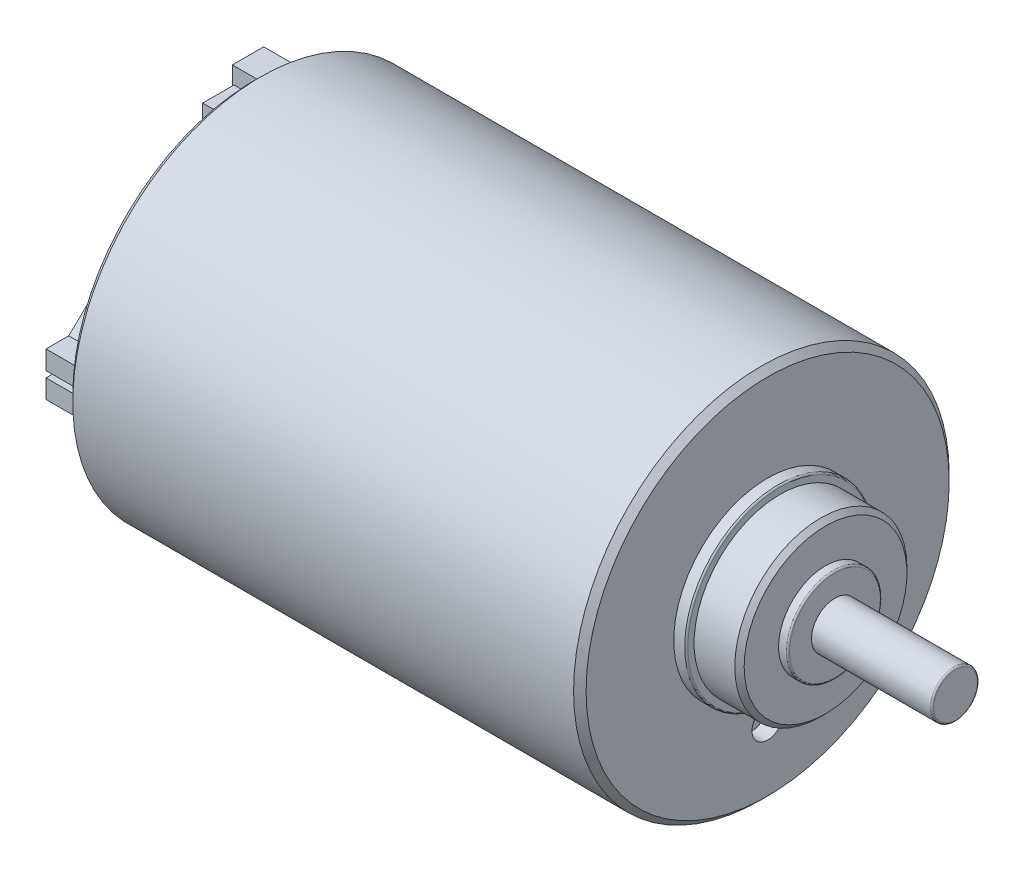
ISO-10303-21;
HEADER;
FILE_DESCRIPTION(('STEP AP214'),'2;1');
FILE_NAME('part.step','',(''),(''),'','','');
FILE_SCHEMA(('AUTOMOTIVE_DESIGN { 1 0 10303 214 1 1 1 1 }'));
ENDSEC;
DATA;
#1=APPLICATION_CONTEXT('core data for automotive mechanical design processes');
#2=APPLICATION_PROTOCOL_DEFINITION('international standard','automotive_design',2000,#1);
#3=PRODUCT_CONTEXT('',#1,'mechanical');
#4=PRODUCT('Part','Part','',(#3));
#5=PRODUCT_RELATED_PRODUCT_CATEGORY('part','',(#4));
#6=PRODUCT_DEFINITION_FORMATION('','',#4);
#7=PRODUCT_DEFINITION_CONTEXT('part definition',#1,'design');
#8=PRODUCT_DEFINITION('design','',#6,#7);
#9=PRODUCT_DEFINITION_SHAPE('','',#8);
#10=(LENGTH_UNIT() NAMED_UNIT(*) SI_UNIT(.MILLI.,.METRE.));
#11=(NAMED_UNIT(*) PLANE_ANGLE_UNIT() SI_UNIT($,.RADIAN.));
#12=(NAMED_UNIT(*) SI_UNIT($,.STERADIAN.) SOLID_ANGLE_UNIT());
#13=UNCERTAINTY_MEASURE_WITH_UNIT(LENGTH_MEASURE(1.E-05),#10,'distance_accuracy_value','');
#14=(GEOMETRIC_REPRESENTATION_CONTEXT(3) GLOBAL_UNCERTAINTY_ASSIGNED_CONTEXT((#13)) GLOBAL_UNIT_ASSIGNED_CONTEXT((#10,
#11,#12)) REPRESENTATION_CONTEXT('',''));
#15=CARTESIAN_POINT('',(0.,0.,0.));
#16=DIRECTION('',(0.,0.,1.));
#17=DIRECTION('',(1.,0.,0.));
#18=AXIS2_PLACEMENT_3D('',#15,#16,#17);
#19=CARTESIAN_POINT('',(12.05,0.,0.));
#20=DIRECTION('',(1.,0.,0.));
#21=DIRECTION('',(0.,0.,-1.));
#22=AXIS2_PLACEMENT_3D('',#19,#20,#21);
#23=PLANE('',#22);
#24=CARTESIAN_POINT('',(12.0499999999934,0.,0.));
#25=DIRECTION('',(-1.,0.,0.));
#26=DIRECTION('',(0.,-1.,0.));
#27=AXIS2_PLACEMENT_3D('',#24,#25,#26);
#28=CIRCLE('',#27,0.6999991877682);
#29=CARTESIAN_POINT('',(12.049999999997,-0.69999926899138,0.));
#30=VERTEX_POINT('',#29);
#31=CARTESIAN_POINT('',(12.049999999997,0.69999926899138,0.));
#32=VERTEX_POINT('',#31);
#33=EDGE_CURVE('E2194',#30,#32,#28,.T.);
#34=ORIENTED_EDGE('',*,*,#33,.F.);
#35=CARTESIAN_POINT('',(12.0499999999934,0.,0.));
#36=DIRECTION('',(-1.,0.,0.));
#37=DIRECTION('',(0.,1.,0.));
#38=AXIS2_PLACEMENT_3D('',#35,#36,#37);
#39=CIRCLE('',#38,0.6999991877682);
#40=EDGE_CURVE('E2195',#32,#30,#39,.T.);
#41=ORIENTED_EDGE('',*,*,#40,.F.);
#42=EDGE_LOOP('',(#34,#41));
#43=FACE_BOUND('',#42,.T.);
#44=ADVANCED_FACE('F17',(#43),#23,.T.);
#45=CARTESIAN_POINT('',(12.,0.,0.));
#46=DIRECTION('',(1.,0.,0.));
#47=DIRECTION('',(0.,-0.998312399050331,-0.0580719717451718));
#48=AXIS2_PLACEMENT_3D('',#45,#46,#47);
#49=TOROIDAL_SURFACE('',#48,0.7,0.05);
#50=ORIENTED_EDGE('',*,*,#40,.T.);
#51=ORIENTED_EDGE('',*,*,#33,.T.);
#52=EDGE_LOOP('',(#50,#51));
#53=FACE_BOUND('',#52,.T.);
#54=CARTESIAN_POINT('',(12.,0.,0.));
#55=DIRECTION('',(1.,0.,0.));
#56=DIRECTION('',(0.,0.,-1.));
#57=AXIS2_PLACEMENT_3D('',#54,#55,#56);
#58=CIRCLE('',#57,0.75);
#59=CARTESIAN_POINT('',(12.,0.,-0.75));
#60=VERTEX_POINT('',#59);
#61=EDGE_CURVE('E483',#60,#60,#58,.F.);
#62=ORIENTED_EDGE('',*,*,#61,.F.);
#63=EDGE_LOOP('',(#62));
#64=FACE_BOUND('',#63,.T.);
#65=ADVANCED_FACE('F892',(#53,#64),#49,.T.);
#66=CARTESIAN_POINT('',(-13.255,0.,0.));
#67=DIRECTION('',(1.,0.,0.));
#68=DIRECTION('',(0.,0.,-1.));
#69=AXIS2_PLACEMENT_3D('',#66,#67,#68);
#70=CYLINDRICAL_SURFACE('',#69,0.75);
#71=CARTESIAN_POINT('',(8.2,0.,0.));
#72=DIRECTION('',(1.,0.,0.));
#73=DIRECTION('',(0.,0.,-1.));
#74=AXIS2_PLACEMENT_3D('',#71,#72,#73);
#75=CIRCLE('',#74,0.75);
#76=CARTESIAN_POINT('',(8.2,0.,-0.75));
#77=VERTEX_POINT('',#76);
#78=EDGE_CURVE('E479',#77,#77,#75,.F.);
#79=ORIENTED_EDGE('',*,*,#78,.F.);
#80=EDGE_LOOP('',(#79));
#81=FACE_BOUND('',#80,.T.);
#82=ORIENTED_EDGE('',*,*,#61,.T.);
#83=EDGE_LOOP('',(#82));
#84=FACE_BOUND('',#83,.T.);
#85=ADVANCED_FACE('F895',(#81,#84),#70,.T.);
#86=CARTESIAN_POINT('',(8.2,0.,0.));
#87=DIRECTION('',(1.,0.,0.));
#88=DIRECTION('',(0.,0.,-1.));
#89=AXIS2_PLACEMENT_3D('',#86,#87,#88);
#90=PLANE('',#89);
#91=ORIENTED_EDGE('',*,*,#78,.T.);
#92=EDGE_LOOP('',(#91));
#93=FACE_BOUND('',#92,.T.);
#94=CARTESIAN_POINT('',(8.19999999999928,0.,0.));
#95=DIRECTION('',(-1.,0.,0.));
#96=DIRECTION('',(0.,-1.,0.));
#97=AXIS2_PLACEMENT_3D('',#94,#95,#96);
#98=CIRCLE('',#97,1.449999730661);
#99=CARTESIAN_POINT('',(8.19999999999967,-1.4499997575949,0.));
#100=VERTEX_POINT('',#99);
#101=CARTESIAN_POINT('',(8.19999999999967,1.4499997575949,0.));
#102=VERTEX_POINT('',#101);
#103=EDGE_CURVE('E861',#100,#102,#98,.T.);
#104=ORIENTED_EDGE('',*,*,#103,.F.);
#105=CARTESIAN_POINT('',(8.19999999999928,1.449999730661,0.));
#106=CARTESIAN_POINT('',(8.19999999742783,1.44998773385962,-0.0166001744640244));
#107=CARTESIAN_POINT('',(8.19999999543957,1.44969491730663,-0.0332001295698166));
#108=CARTESIAN_POINT('',(8.19999999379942,1.44854864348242,-0.0663749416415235));
#109=CARTESIAN_POINT('',(8.19999999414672,1.44769537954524,-0.0829498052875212));
#110=CARTESIAN_POINT('',(8.1999999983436,1.4454295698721,-0.116055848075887));
#111=CARTESIAN_POINT('',(8.20000000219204,1.44401720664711,-0.132587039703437));
#112=CARTESIAN_POINT('',(8.19999999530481,1.44063561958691,-0.165587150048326));
#113=CARTESIAN_POINT('',(8.19999998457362,1.43866656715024,-0.182056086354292));
#114=CARTESIAN_POINT('',(8.19999992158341,1.43417344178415,-0.214913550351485));
#115=CARTESIAN_POINT('',(8.19999986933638,1.4316495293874,-0.23130209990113));
#116=CARTESIAN_POINT('',(8.19999971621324,1.42745209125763,-0.25581203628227));
#117=CARTESIAN_POINT('',(8.19999965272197,1.42598449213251,-0.263969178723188));
#118=CARTESIAN_POINT('',(8.19999950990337,1.42290911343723,-0.280254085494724));
#119=CARTESIAN_POINT('',(8.19999943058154,1.42130138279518,-0.28838185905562));
#120=CARTESIAN_POINT('',(8.19999921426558,1.41626365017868,-0.312712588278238));
#121=CARTESIAN_POINT('',(8.19999909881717,1.41261767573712,-0.328871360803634));
#122=CARTESIAN_POINT('',(8.19999897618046,1.40476097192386,-0.361039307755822));
#123=CARTESIAN_POINT('',(8.1999989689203,1.40055061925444,-0.377048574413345));
#124=CARTESIAN_POINT('',(8.19999906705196,1.39156791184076,-0.408896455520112));
#125=CARTESIAN_POINT('',(8.19999917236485,1.38679595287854,-0.424735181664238));
#126=CARTESIAN_POINT('',(8.19999944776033,1.37670808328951,-0.456226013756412));
#127=CARTESIAN_POINT('',(8.19999961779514,1.37139257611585,-0.471878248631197));
#128=CARTESIAN_POINT('',(8.19999988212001,1.36018616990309,-0.502961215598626));
#129=CARTESIAN_POINT('',(8.19999997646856,1.35429571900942,-0.518392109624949));
#130=CARTESIAN_POINT('',(8.20000001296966,1.34482878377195,-0.542195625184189));
#131=CARTESIAN_POINT('',(8.20000000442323,1.34140022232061,-0.550627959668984));
#132=CARTESIAN_POINT('',(8.19999998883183,1.33044701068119,-0.576884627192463));
#133=CARTESIAN_POINT('',(8.19999999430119,1.32265503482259,-0.594598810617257));
#134=CARTESIAN_POINT('',(8.19999993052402,1.3055779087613,-0.631414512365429));
#135=CARTESIAN_POINT('',(8.19999985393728,1.29622124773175,-0.650482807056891));
#136=CARTESIAN_POINT('',(8.19999961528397,1.27495593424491,-0.691512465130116));
#137=CARTESIAN_POINT('',(8.1999994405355,1.26288808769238,-0.713391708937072));
#138=CARTESIAN_POINT('',(8.19999918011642,1.24175833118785,-0.749434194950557));
#139=CARTESIAN_POINT('',(8.19999908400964,1.23300516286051,-0.763779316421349));
#140=CARTESIAN_POINT('',(8.19999900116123,1.22006593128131,-0.784161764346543));
#141=CARTESIAN_POINT('',(8.19999898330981,1.21608347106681,-0.790328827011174));
#142=CARTESIAN_POINT('',(8.19999895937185,1.20712564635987,-0.803967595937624));
#143=CARTESIAN_POINT('',(8.19999895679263,1.2021267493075,-0.811423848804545));
#144=CARTESIAN_POINT('',(8.19999896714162,1.18692467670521,-0.833644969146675));
#145=CARTESIAN_POINT('',(8.1999989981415,1.17651263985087,-0.848267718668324));
#146=CARTESIAN_POINT('',(8.19999910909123,1.15515149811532,-0.877105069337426));
#147=CARTESIAN_POINT('',(8.19999918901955,1.14420263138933,-0.891319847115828));
#148=CARTESIAN_POINT('',(8.19999937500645,1.12178264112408,-0.919320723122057));
#149=CARTESIAN_POINT('',(8.19999948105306,1.1103117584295,-0.933107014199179));
#150=CARTESIAN_POINT('',(8.19999969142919,1.0868702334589,-0.960236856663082));
#151=CARTESIAN_POINT('',(8.1999997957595,1.07489983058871,-0.973580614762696));
#152=CARTESIAN_POINT('',(8.19999994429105,1.05045680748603,-0.999787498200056));
#153=CARTESIAN_POINT('',(8.1999999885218,1.03798443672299,-1.0126508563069));
#154=CARTESIAN_POINT('',(8.2000000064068,1.01822589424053,-1.03236887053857));
#155=CARTESIAN_POINT('',(8.20000000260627,1.01108249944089,-1.03936778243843));
#156=CARTESIAN_POINT('',(8.19999999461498,0.990009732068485,-1.0596089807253));
#157=CARTESIAN_POINT('',(8.19999999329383,0.975894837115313,-1.07265938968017));
#158=CARTESIAN_POINT('',(8.19999992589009,0.946227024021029,-1.09901910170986));
#159=CARTESIAN_POINT('',(8.19999985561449,0.930640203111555,-1.11229033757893));
#160=CARTESIAN_POINT('',(8.19999972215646,0.9106336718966,-1.12860929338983));
#161=CARTESIAN_POINT('',(8.1999996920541,0.906466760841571,-1.13197002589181));
#162=CARTESIAN_POINT('',(8.19999954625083,0.886927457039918,-1.14754949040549));
#163=CARTESIAN_POINT('',(8.19999941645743,0.871321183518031,-1.15947781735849));
#164=CARTESIAN_POINT('',(8.19999919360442,0.841924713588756,-1.18100395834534));
#165=CARTESIAN_POINT('',(8.19999909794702,0.828198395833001,-1.19068928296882));
#166=CARTESIAN_POINT('',(8.1999990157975,0.808239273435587,-1.20424790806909));
#167=CARTESIAN_POINT('',(8.19999899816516,0.802141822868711,-1.20832126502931));
#168=CARTESIAN_POINT('',(8.19999897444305,0.788510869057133,-1.2172756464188));
#169=CARTESIAN_POINT('',(8.19999897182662,0.780961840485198,-1.2221330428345));
#170=CARTESIAN_POINT('',(8.19999898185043,0.758184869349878,-1.23648826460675));
#171=CARTESIAN_POINT('',(8.19999901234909,0.742821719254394,-1.24577276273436));
#172=CARTESIAN_POINT('',(8.19999912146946,0.711764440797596,-1.26375365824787));
#173=CARTESIAN_POINT('',(8.19999920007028,0.696070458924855,-1.27245030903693));
#174=CARTESIAN_POINT('',(8.19999938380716,0.664373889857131,-1.28924407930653));
#175=CARTESIAN_POINT('',(8.19999948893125,0.648371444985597,-1.29734146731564));
#176=CARTESIAN_POINT('',(8.19999969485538,0.616081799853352,-1.31292701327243));
#177=CARTESIAN_POINT('',(8.19999979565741,0.59979473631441,-1.32041545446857));
#178=CARTESIAN_POINT('',(8.19999994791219,0.566957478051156,-1.3347686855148));
#179=CARTESIAN_POINT('',(8.19999999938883,0.550407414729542,-1.34163377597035));
#180=CARTESIAN_POINT('',(8.20000000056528,0.518280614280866,-1.35427430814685));
#181=CARTESIAN_POINT('',(8.19999995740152,0.502720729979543,-1.3600926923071));
#182=CARTESIAN_POINT('',(8.19999988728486,0.471431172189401,-1.3712084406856));
#183=CARTESIAN_POINT('',(8.19999986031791,0.455701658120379,-1.37650625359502));
#184=CARTESIAN_POINT('',(8.1999998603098,0.42408822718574,-1.38657152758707));
#185=CARTESIAN_POINT('',(8.19999988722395,0.408204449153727,-1.39133942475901));
#186=CARTESIAN_POINT('',(8.19999994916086,0.376300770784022,-1.40034508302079));
#187=CARTESIAN_POINT('',(8.1999999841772,0.360280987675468,-1.40458325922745));
#188=CARTESIAN_POINT('',(8.2000000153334,0.32812008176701,-1.41251580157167));
#189=CARTESIAN_POINT('',(8.20000001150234,0.311979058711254,-1.41621057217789));
#190=CARTESIAN_POINT('',(8.19999970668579,0.287691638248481,-1.42137247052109));
#191=CARTESIAN_POINT('',(8.19999955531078,0.279585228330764,-1.42302935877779));
#192=CARTESIAN_POINT('',(8.19999942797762,0.268432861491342,-1.42518355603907));
#193=CARTESIAN_POINT('',(8.19999940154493,0.265401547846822,-1.42575642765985));
#194=CARTESIAN_POINT('',(8.19999930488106,0.249541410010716,-1.42869313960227));
#195=CARTESIAN_POINT('',(8.19999936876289,0.23667757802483,-1.43086791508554));
#196=CARTESIAN_POINT('',(8.19999952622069,0.201837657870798,-1.43627636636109));
#197=CARTESIAN_POINT('',(8.19999960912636,0.17980923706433,-1.43918051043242));
#198=CARTESIAN_POINT('',(8.19999972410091,0.150783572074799,-1.44232284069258));
#199=CARTESIAN_POINT('',(8.19999975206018,0.143833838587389,-1.44302385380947));
#200=CARTESIAN_POINT('',(8.19999984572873,0.118378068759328,-1.44540598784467));
#201=CARTESIAN_POINT('',(8.19999989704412,0.0998422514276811,-1.44678202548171));
#202=CARTESIAN_POINT('',(8.19999996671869,0.0636781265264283,-1.44876964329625));
#203=CARTESIAN_POINT('',(8.1999999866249,0.0460517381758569,-1.44941662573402));
#204=CARTESIAN_POINT('',(8.19999999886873,0.0189478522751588,-1.44992098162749));
#205=CARTESIAN_POINT('',(8.19999999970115,0.00947401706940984,-1.45000520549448));
#206=CARTESIAN_POINT('',(8.20000000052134,-0.0165906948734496,-1.44999014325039));
#207=CARTESIAN_POINT('',(8.19999999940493,-0.0331819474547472,-1.44970548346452));
#208=CARTESIAN_POINT('',(8.19999999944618,-0.0663397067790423,-1.448571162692));
#209=CARTESIAN_POINT('',(8.20000000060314,-0.0829062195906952,-1.44772167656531));
#210=CARTESIAN_POINT('',(8.19999999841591,-0.115996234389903,-1.44546325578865));
#211=CARTESIAN_POINT('',(8.19999999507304,-0.132519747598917,-1.44405448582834));
#212=CARTESIAN_POINT('',(8.19999996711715,-0.165504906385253,-1.44067872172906));
#213=CARTESIAN_POINT('',(8.19999994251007,-0.181966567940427,-1.43871188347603));
#214=CARTESIAN_POINT('',(8.19999985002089,-0.2148097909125,-1.43422216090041));
#215=CARTESIAN_POINT('',(8.19999978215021,-0.231191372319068,-1.4316994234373));
#216=CARTESIAN_POINT('',(8.19999961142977,-0.255690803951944,-1.42750273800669));
#217=CARTESIAN_POINT('',(8.19999954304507,-0.26384450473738,-1.42603520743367));
#218=CARTESIAN_POINT('',(8.19999939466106,-0.28013135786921,-1.42295827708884));
#219=CARTESIAN_POINT('',(8.19999931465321,-0.288264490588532,-1.42134877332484));
#220=CARTESIAN_POINT('',(8.19999910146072,-0.31261040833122,-1.41630586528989));
#221=CARTESIAN_POINT('',(8.19999899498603,-0.3287789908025,-1.41265648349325));
#222=CARTESIAN_POINT('',(8.19999889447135,-0.360965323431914,-1.40479297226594));
#223=CARTESIAN_POINT('',(8.19999890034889,-0.376983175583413,-1.40057925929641));
#224=CARTESIAN_POINT('',(8.19999902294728,-0.408847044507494,-1.39159000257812));
#225=CARTESIAN_POINT('',(8.19999913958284,-0.424693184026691,-1.38681489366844));
#226=CARTESIAN_POINT('',(8.19999943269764,-0.456197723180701,-1.37672102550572));
#227=CARTESIAN_POINT('',(8.19999960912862,-0.471856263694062,-1.37140270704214));
#228=CARTESIAN_POINT('',(8.19999988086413,-0.50295072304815,-1.36019094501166));
#229=CARTESIAN_POINT('',(8.19999997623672,-0.518386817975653,-1.35429798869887));
#230=CARTESIAN_POINT('',(8.200000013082,-0.542188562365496,-1.34483150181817));
#231=CARTESIAN_POINT('',(8.2000000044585,-0.550613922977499,-1.34140588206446));
#232=CARTESIAN_POINT('',(8.19999998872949,-0.576864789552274,-1.33045561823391));
#233=CARTESIAN_POINT('',(8.19999999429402,-0.594580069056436,-1.32266344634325));
#234=CARTESIAN_POINT('',(8.1999999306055,-0.631402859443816,-1.30558361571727));
#235=CARTESIAN_POINT('',(8.19999985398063,-0.650477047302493,-1.29622422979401));
#236=CARTESIAN_POINT('',(8.19999961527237,-0.691512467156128,-1.27495593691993));
#237=CARTESIAN_POINT('',(8.19999944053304,-0.71339170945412,-1.26288808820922));
#238=CARTESIAN_POINT('',(8.19999918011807,-0.749434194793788,-1.24175833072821));
#239=CARTESIAN_POINT('',(8.19999908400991,-0.763779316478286,-1.23300516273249));
#240=CARTESIAN_POINT('',(8.19999900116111,-0.784161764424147,-1.22006593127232));
#241=CARTESIAN_POINT('',(8.19999898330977,-0.790328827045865,-1.21608347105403));
#242=CARTESIAN_POINT('',(8.19999895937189,-0.803967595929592,-1.20712564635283));
#243=CARTESIAN_POINT('',(8.19999895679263,-0.811423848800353,-1.20212674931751));
#244=CARTESIAN_POINT('',(8.19999896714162,-0.833644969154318,-1.18692467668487));
#245=CARTESIAN_POINT('',(8.19999899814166,-0.848267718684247,-1.17651263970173));
#246=CARTESIAN_POINT('',(8.19999910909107,-0.877105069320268,-1.15515149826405));
#247=CARTESIAN_POINT('',(8.1999991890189,-0.89131984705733,-1.1442026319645));
#248=CARTESIAN_POINT('',(8.1999993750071,-0.919320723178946,-1.12178264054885));
#249=CARTESIAN_POINT('',(8.19999948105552,-0.933107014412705,-1.11031175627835));
#250=CARTESIAN_POINT('',(8.19999969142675,-0.96023685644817,-1.0868702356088));
#251=CARTESIAN_POINT('',(8.19999979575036,-0.973580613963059,-1.07489983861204));
#252=CARTESIAN_POINT('',(8.19999994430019,-0.999787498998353,-1.05045679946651));
#253=CARTESIAN_POINT('',(8.19999998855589,-1.01265085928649,-1.03798440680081));
#254=CARTESIAN_POINT('',(8.20000000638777,-1.03236886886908,-1.01822591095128));
#255=CARTESIAN_POINT('',(8.20000000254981,-1.03936777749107,-1.0110825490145));
#256=CARTESIAN_POINT('',(8.19999999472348,-1.05960899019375,-0.990009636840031));
#257=CARTESIAN_POINT('',(8.19999999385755,-1.07265943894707,-0.975894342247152));
#258=CARTESIAN_POINT('',(8.19999992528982,-1.09901904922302,-0.946227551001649));
#259=CARTESIAN_POINT('',(8.19999985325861,-1.11229013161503,-0.930642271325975));
#260=CARTESIAN_POINT('',(8.19999962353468,-1.14102055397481,-0.89541563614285));
#261=CARTESIAN_POINT('',(8.19999945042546,-1.15631509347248,-0.87563926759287));
#262=CARTESIAN_POINT('',(8.19999919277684,-1.18100433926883,-0.841924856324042));
#263=CARTESIAN_POINT('',(8.19999909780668,-1.19068934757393,-0.828198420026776));
#264=CARTESIAN_POINT('',(8.19999901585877,-1.20424787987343,-0.808239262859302));
#265=CARTESIAN_POINT('',(8.19999899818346,-1.20832125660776,-0.802141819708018));
#266=CARTESIAN_POINT('',(8.19999897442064,-1.2172756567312,-0.78851087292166));
#267=CARTESIAN_POINT('',(8.19999897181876,-1.22213304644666,-0.780961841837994));
#268=CARTESIAN_POINT('',(8.19999898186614,-1.23648825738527,-0.758184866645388));
#269=CARTESIAN_POINT('',(8.19999901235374,-1.24577276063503,-0.742821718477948));
#270=CARTESIAN_POINT('',(8.19999912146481,-1.2637536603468,-0.711764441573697));
#271=CARTESIAN_POINT('',(8.19999920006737,-1.27245031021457,-0.696070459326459));
#272=CARTESIAN_POINT('',(8.19999938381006,-1.28924407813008,-0.664373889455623));
#273=CARTESIAN_POINT('',(8.1999994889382,-1.29734146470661,-0.648371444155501));
#274=CARTESIAN_POINT('',(8.19999969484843,-1.31292701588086,-0.616081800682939));
#275=CARTESIAN_POINT('',(8.19999979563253,-1.32041546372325,-0.599794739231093));
#276=CARTESIAN_POINT('',(8.19999994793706,-1.334768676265,-0.566957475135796));
#277=CARTESIAN_POINT('',(8.19999999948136,-1.34163374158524,-0.550407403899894));
#278=CARTESIAN_POINT('',(8.20000000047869,-1.35426420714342,-0.518306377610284));
#279=CARTESIAN_POINT('',(8.19999995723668,-1.36007341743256,-0.502772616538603));
#280=CARTESIAN_POINT('',(8.19999988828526,-1.37117365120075,-0.471532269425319));
#281=CARTESIAN_POINT('',(8.19999986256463,-1.37646500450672,-0.45582580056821));
#282=CARTESIAN_POINT('',(8.19999986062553,-1.38652111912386,-0.424255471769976));
#283=CARTESIAN_POINT('',(8.19999988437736,-1.39128619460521,-0.408391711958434));
#284=CARTESIAN_POINT('',(8.19999995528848,-1.40028484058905,-0.376523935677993));
#285=CARTESIAN_POINT('',(8.20000000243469,-1.40451870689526,-0.360520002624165));
#286=CARTESIAN_POINT('',(8.19999999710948,-1.41277760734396,-0.327099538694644));
#287=CARTESIAN_POINT('',(8.19999993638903,-1.41675902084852,-0.309672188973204));
#288=CARTESIAN_POINT('',(8.19999961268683,-1.42353304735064,-0.277260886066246));
#289=CARTESIAN_POINT('',(8.19999938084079,-1.42641438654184,-0.262295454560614));
#290=CARTESIAN_POINT('',(8.19999900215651,-1.43190374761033,-0.230977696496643));
#291=CARTESIAN_POINT('',(8.19999886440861,-1.4344665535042,-0.21461740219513));
#292=CARTESIAN_POINT('',(8.19999877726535,-1.43900050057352,-0.181830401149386));
#293=CARTESIAN_POINT('',(8.19999882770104,-1.44097217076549,-0.165403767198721));
#294=CARTESIAN_POINT('',(8.19999910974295,-1.44433114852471,-0.13250611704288));
#295=CARTESIAN_POINT('',(8.19999934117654,-1.44571901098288,-0.116035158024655));
#296=CARTESIAN_POINT('',(8.19999975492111,-1.44804412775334,-0.0804233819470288));
#297=CARTESIAN_POINT('',(8.19999992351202,-1.44887422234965,-0.0612756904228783));
#298=CARTESIAN_POINT('',(8.20000005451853,-1.44974841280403,-0.0280818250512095));
#299=CARTESIAN_POINT('',(8.20000005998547,-1.44994325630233,-0.0140395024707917));
#300=CARTESIAN_POINT('',(8.19999999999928,-1.449999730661,0.));
#301=B_SPLINE_CURVE_WITH_KNOTS('',3,(#105,#106,#107,#108,#109,#110,#111,#112,#113,#114,#115,
#116,#117,#118,#119,#120,#121,#122,#123,#124,#125,#126,#127,#128,#129,#130,#131,#132,#133,#134,
#135,#136,#137,#138,#139,#140,#141,#142,#143,#144,#145,#146,#147,#148,#149,#150,#151,#152,#153,
#154,#155,#156,#157,#158,#159,#160,#161,#162,#163,#164,#165,#166,#167,#168,#169,#170,#171,#172,
#173,#174,#175,#176,#177,#178,#179,#180,#181,#182,#183,#184,#185,#186,#187,#188,#189,#190,#191,
#192,#193,#194,#195,#196,#197,#198,#199,#200,#201,#202,#203,#204,#205,#206,#207,#208,#209,#210,
#211,#212,#213,#214,#215,#216,#217,#218,#219,#220,#221,#222,#223,#224,#225,#226,#227,#228,#229,
#230,#231,#232,#233,#234,#235,#236,#237,#238,#239,#240,#241,#242,#243,#244,#245,#246,#247,#248,
#249,#250,#251,#252,#253,#254,#255,#256,#257,#258,#259,#260,#261,#262,#263,#264,#265,#266,#267,
#268,#269,#270,#271,#272,#273,#274,#275,#276,#277,#278,#279,#280,#281,#282,#283,#284,#285,#286,
#287,#288,#289,#290,#291,#292,#293,#294,#295,#296,#297,#298,#299,#300),.UNSPECIFIED.,.F.,.F.,(4,
2,2,2,2,2,2,2,2,2,2,2,2,2,2,2,2,2,2,2,2,2,2,2,2,2,2,2,2,2,2,2,2,2,2,2,2,2,2,2,2,2,2,2,2,2,2,2,2,
2,2,2,2,2,2,2,2,2,2,2,2,2,2,2,2,2,2,2,2,2,2,2,2,2,2,2,2,2,2,2,2,2,2,2,2,2,2,2,2,2,2,2,2,2,2,2,2,
4),(0.,0.0497981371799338,0.099579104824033,0.149343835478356,0.199093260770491,
0.24882831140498,0.273691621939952,0.298546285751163,0.348230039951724,0.397880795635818,
0.447496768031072,0.497076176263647,0.546617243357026,0.573924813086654,0.631964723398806,
0.69566614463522,0.770589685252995,0.820993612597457,0.843016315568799,0.869945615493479,
0.923784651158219,0.977600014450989,1.03139079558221,1.08515608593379,1.13889497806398,
1.16889578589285,1.22655105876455,1.28794417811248,1.30400399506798,1.36291335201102,
1.41330071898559,1.4352985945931,1.46222746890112,1.51606588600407,1.56988094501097,
1.62367174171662,1.6774373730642,1.73117693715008,1.78100432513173,1.83078838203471,
1.88053116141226,1.93023471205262,1.9799010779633,2.00472180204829,2.01397661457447,
2.05311080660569,2.11973958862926,2.14069433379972,2.19643940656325,2.24934201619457,
2.27776336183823,2.3275342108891,2.37728965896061,2.42703046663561,2.47675739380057,
2.52647119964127,2.55132430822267,2.57619577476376,2.62591048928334,2.67558871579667,
2.72522871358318,2.77482874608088,2.82438708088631,2.85167194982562,2.90971510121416,
2.97343597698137,3.04835951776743,3.09876344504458,3.12078614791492,3.14771544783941,
3.20155448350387,3.2553698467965,3.30916062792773,3.36292591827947,3.41666481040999,
3.44666561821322,3.50432089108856,3.56571401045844,3.64067888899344,3.69106625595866,
3.71306413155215,3.73999300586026,3.79383142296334,3.84764648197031,3.90143727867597,
3.95520291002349,4.00894247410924,4.05868684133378,4.10839931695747,4.15808195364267,
4.20773680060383,4.26135379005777,4.3070668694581,4.35673502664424,4.40635860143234,
4.45593490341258,4.51341752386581,4.55554178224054),.UNSPECIFIED.);
#302=EDGE_CURVE('E482',#102,#100,#301,.T.);
#303=ORIENTED_EDGE('',*,*,#302,.F.);
#304=EDGE_LOOP('',(#104,#303));
#305=FACE_BOUND('',#304,.T.);
#306=ADVANCED_FACE('F851',(#93,#305),#90,.T.);
#307=CARTESIAN_POINT('',(8.15,0.,0.));
#308=DIRECTION('',(1.,0.,0.));
#309=DIRECTION('',(0.,-0.999578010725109,-0.0290482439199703));
#310=AXIS2_PLACEMENT_3D('',#307,#308,#309);
#311=TOROIDAL_SURFACE('',#310,1.45,0.05);
#312=ORIENTED_EDGE('',*,*,#302,.T.);
#313=ORIENTED_EDGE('',*,*,#103,.T.);
#314=EDGE_LOOP('',(#312,#313));
#315=FACE_BOUND('',#314,.T.);
#316=CARTESIAN_POINT('',(8.15,0.,0.));
#317=DIRECTION('',(1.,0.,0.));
#318=DIRECTION('',(0.,0.,-1.));
#319=AXIS2_PLACEMENT_3D('',#316,#317,#318);
#320=CIRCLE('',#319,1.5);
#321=CARTESIAN_POINT('',(8.15,0.,-1.5));
#322=VERTEX_POINT('',#321);
#323=EDGE_CURVE('E478',#322,#322,#320,.F.);
#324=ORIENTED_EDGE('',*,*,#323,.F.);
#325=EDGE_LOOP('',(#324));
#326=FACE_BOUND('',#325,.T.);
#327=ADVANCED_FACE('F840',(#315,#326),#311,.T.);
#328=CARTESIAN_POINT('',(-13.255,0.,0.));
#329=DIRECTION('',(1.,0.,0.));
#330=DIRECTION('',(0.,0.,-1.));
#331=AXIS2_PLACEMENT_3D('',#328,#329,#330);
#332=CYLINDRICAL_SURFACE('',#331,1.5);
#333=CARTESIAN_POINT('',(7.9,0.,0.));
#334=DIRECTION('',(1.,0.,0.));
#335=DIRECTION('',(0.,0.,-1.));
#336=AXIS2_PLACEMENT_3D('',#333,#334,#335);
#337=CIRCLE('',#336,1.5);
#338=CARTESIAN_POINT('',(7.9,0.,-1.5));
#339=VERTEX_POINT('',#338);
#340=EDGE_CURVE('E475',#339,#339,#337,.F.);
#341=ORIENTED_EDGE('',*,*,#340,.F.);
#342=EDGE_LOOP('',(#341));
#343=FACE_BOUND('',#342,.T.);
#344=ORIENTED_EDGE('',*,*,#323,.T.);
#345=EDGE_LOOP('',(#344));
#346=FACE_BOUND('',#345,.T.);
#347=ADVANCED_FACE('F850',(#343,#346),#332,.T.);
#348=CARTESIAN_POINT('',(7.9,0.,0.));
#349=DIRECTION('',(1.,0.,0.));
#350=DIRECTION('',(0.,0.,-1.));
#351=AXIS2_PLACEMENT_3D('',#348,#349,#350);
#352=PLANE('',#351);
#353=ORIENTED_EDGE('',*,*,#340,.T.);
#354=EDGE_LOOP('',(#353));
#355=FACE_BOUND('',#354,.T.);
#356=CARTESIAN_POINT('',(7.90000000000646,0.,0.));
#357=DIRECTION('',(-1.,0.,0.));
#358=DIRECTION('',(0.,0.,1.));
#359=AXIS2_PLACEMENT_3D('',#356,#357,#358);
#360=CIRCLE('',#359,2.60000000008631);
#361=CARTESIAN_POINT('',(7.90000000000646,0.,2.60000000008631));
#362=VERTEX_POINT('',#361);
#363=EDGE_CURVE('E471',#362,#362,#360,.T.);
#364=ORIENTED_EDGE('',*,*,#363,.F.);
#365=EDGE_LOOP('',(#364));
#366=FACE_BOUND('',#365,.T.);
#367=ADVANCED_FACE('F2113',(#355,#366),#352,.T.);
#368=CARTESIAN_POINT('',(-12.05,0.,0.));
#369=DIRECTION('',(1.,0.,0.));
#370=DIRECTION('',(0.,0.,-1.));
#371=AXIS2_PLACEMENT_3D('',#368,#369,#370);
#372=PLANE('',#371);
#373=CARTESIAN_POINT('',(-12.0499999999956,0.,0.));
#374=DIRECTION('',(1.,0.,0.));
#375=DIRECTION('',(0.,-1.,0.));
#376=AXIS2_PLACEMENT_3D('',#373,#374,#375);
#377=CIRCLE('',#376,0.69999933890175);
#378=CARTESIAN_POINT('',(-12.0499999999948,-0.6999989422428,0.));
#379=VERTEX_POINT('',#378);
#380=CARTESIAN_POINT('',(-12.0499999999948,0.6999989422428,0.));
#381=VERTEX_POINT('',#380);
#382=EDGE_CURVE('E2227',#379,#381,#377,.T.);
#383=ORIENTED_EDGE('',*,*,#382,.F.);
#384=CARTESIAN_POINT('',(-12.0499999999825,0.,0.));
#385=DIRECTION('',(1.,0.,0.));
#386=DIRECTION('',(0.,1.,0.));
#387=AXIS2_PLACEMENT_3D('',#384,#385,#386);
#388=CIRCLE('',#387,0.699998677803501);
#389=EDGE_CURVE('E474',#381,#379,#388,.T.);
#390=ORIENTED_EDGE('',*,*,#389,.F.);
#391=EDGE_LOOP('',(#383,#390));
#392=FACE_BOUND('',#391,.T.);
#393=ADVANCED_FACE('F2105',(#392),#372,.F.);
#394=CARTESIAN_POINT('',(7.74999999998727,0.,0.));
#395=DIRECTION('',(-1.,0.,0.));
#396=DIRECTION('',(0.,0.,1.));
#397=AXIS2_PLACEMENT_3D('',#394,#395,#396);
#398=CONICAL_SURFACE('',#397,2.75000000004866,0.78539816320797);
#399=ORIENTED_EDGE('',*,*,#363,.T.);
#400=EDGE_LOOP('',(#399));
#401=FACE_BOUND('',#400,.T.);
#402=CARTESIAN_POINT('',(7.75,0.,0.));
#403=DIRECTION('',(1.,0.,0.));
#404=DIRECTION('',(0.,0.,-1.));
#405=AXIS2_PLACEMENT_3D('',#402,#403,#404);
#406=CIRCLE('',#405,2.75);
#407=CARTESIAN_POINT('',(7.75,0.,-2.75));
#408=VERTEX_POINT('',#407);
#409=EDGE_CURVE('E2226',#408,#408,#406,.F.);
#410=ORIENTED_EDGE('',*,*,#409,.F.);
#411=EDGE_LOOP('',(#410));
#412=FACE_BOUND('',#411,.T.);
#413=ADVANCED_FACE('F815',(#401,#412),#398,.T.);
#414=CARTESIAN_POINT('',(-12.,0.,0.));
#415=DIRECTION('',(1.,0.,0.));
#416=DIRECTION('',(0.,0.996317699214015,0.0857382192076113));
#417=AXIS2_PLACEMENT_3D('',#414,#415,#416);
#418=TOROIDAL_SURFACE('',#417,0.7,0.05);
#419=CARTESIAN_POINT('',(-12.,0.,0.));
#420=DIRECTION('',(1.,0.,0.));
#421=DIRECTION('',(0.,0.,-1.));
#422=AXIS2_PLACEMENT_3D('',#419,#420,#421);
#423=CIRCLE('',#422,0.75);
#424=CARTESIAN_POINT('',(-12.,0.,-0.75));
#425=VERTEX_POINT('',#424);
#426=EDGE_CURVE('E470',#425,#425,#423,.T.);
#427=ORIENTED_EDGE('',*,*,#426,.F.);
#428=EDGE_LOOP('',(#427));
#429=FACE_BOUND('',#428,.T.);
#430=ORIENTED_EDGE('',*,*,#382,.T.);
#431=ORIENTED_EDGE('',*,*,#389,.T.);
#432=EDGE_LOOP('',(#430,#431));
#433=FACE_BOUND('',#432,.T.);
#434=ADVANCED_FACE('F809',(#429,#433),#418,.T.);
#435=CARTESIAN_POINT('',(-10.35,0.,0.));
#436=DIRECTION('',(-1.,0.,0.));
#437=DIRECTION('',(0.,0.,1.));
#438=AXIS2_PLACEMENT_3D('',#435,#436,#437);
#439=PLANE('',#438);
#440=CARTESIAN_POINT('',(-10.35,-2.9,-2.4));
#441=DIRECTION('',(-1.,0.,0.));
#442=DIRECTION('',(0.,0.,1.));
#443=AXIS2_PLACEMENT_3D('',#440,#441,#442);
#444=CIRCLE('',#443,0.15);
#445=CARTESIAN_POINT('',(-10.35,-2.9,-2.25));
#446=VERTEX_POINT('',#445);
#447=EDGE_CURVE('E467',#446,#446,#444,.T.);
#448=ORIENTED_EDGE('',*,*,#447,.T.);
#449=EDGE_LOOP('',(#448));
#450=FACE_BOUND('',#449,.T.);
#451=ADVANCED_FACE('F814',(#450),#439,.T.);
#452=CARTESIAN_POINT('',(-10.35,0.,0.));
#453=DIRECTION('',(-1.,0.,0.));
#454=DIRECTION('',(0.,0.,1.));
#455=AXIS2_PLACEMENT_3D('',#452,#453,#454);
#456=PLANE('',#455);
#457=CARTESIAN_POINT('',(-10.35,2.9,2.4));
#458=DIRECTION('',(-1.,0.,0.));
#459=DIRECTION('',(0.,0.,1.));
#460=AXIS2_PLACEMENT_3D('',#457,#458,#459);
#461=CIRCLE('',#460,0.15);
#462=CARTESIAN_POINT('',(-10.35,2.9,2.55));
#463=VERTEX_POINT('',#462);
#464=EDGE_CURVE('E464',#463,#463,#461,.T.);
#465=ORIENTED_EDGE('',*,*,#464,.T.);
#466=EDGE_LOOP('',(#465));
#467=FACE_BOUND('',#466,.T.);
#468=ADVANCED_FACE('F2077',(#467),#456,.T.);
#469=CARTESIAN_POINT('',(-10.35,0.,0.));
#470=DIRECTION('',(-1.,0.,0.));
#471=DIRECTION('',(0.,0.,1.));
#472=AXIS2_PLACEMENT_3D('',#469,#470,#471);
#473=PLANE('',#472);
#474=CARTESIAN_POINT('',(-10.35,-2.9,2.4));
#475=DIRECTION('',(-1.,0.,0.));
#476=DIRECTION('',(0.,0.,1.));
#477=AXIS2_PLACEMENT_3D('',#474,#475,#476);
#478=CIRCLE('',#477,0.15);
#479=CARTESIAN_POINT('',(-10.35,-2.9,2.55));
#480=VERTEX_POINT('',#479);
#481=EDGE_CURVE('E461',#480,#480,#478,.T.);
#482=ORIENTED_EDGE('',*,*,#481,.T.);
#483=EDGE_LOOP('',(#482));
#484=FACE_BOUND('',#483,.T.);
#485=ADVANCED_FACE('F2068',(#484),#473,.T.);
#486=CARTESIAN_POINT('',(-10.35,0.,0.));
#487=DIRECTION('',(-1.,0.,0.));
#488=DIRECTION('',(0.,0.,1.));
#489=AXIS2_PLACEMENT_3D('',#486,#487,#488);
#490=PLANE('',#489);
#491=CARTESIAN_POINT('',(-10.35,2.9,-2.4));
#492=DIRECTION('',(-1.,0.,0.));
#493=DIRECTION('',(0.,0.,1.));
#494=AXIS2_PLACEMENT_3D('',#491,#492,#493);
#495=CIRCLE('',#494,0.15);
#496=CARTESIAN_POINT('',(-10.35,2.9,-2.25));
#497=VERTEX_POINT('',#496);
#498=EDGE_CURVE('E458',#497,#497,#495,.T.);
#499=ORIENTED_EDGE('',*,*,#498,.T.);
#500=EDGE_LOOP('',(#499));
#501=FACE_BOUND('',#500,.T.);
#502=ADVANCED_FACE('F2059',(#501),#490,.T.);
#503=CARTESIAN_POINT('',(-13.255,0.,0.));
#504=DIRECTION('',(1.,0.,0.));
#505=DIRECTION('',(0.,0.,-1.));
#506=AXIS2_PLACEMENT_3D('',#503,#504,#505);
#507=CYLINDRICAL_SURFACE('',#506,2.75);
#508=ORIENTED_EDGE('',*,*,#409,.T.);
#509=EDGE_LOOP('',(#508));
#510=FACE_BOUND('',#509,.T.);
#511=CARTESIAN_POINT('',(6.45,0.,0.));
#512=DIRECTION('',(1.,0.,0.));
#513=DIRECTION('',(0.,0.,-1.));
#514=AXIS2_PLACEMENT_3D('',#511,#512,#513);
#515=CIRCLE('',#514,2.75);
#516=CARTESIAN_POINT('',(6.45,0.,-2.75));
#517=VERTEX_POINT('',#516);
#518=EDGE_CURVE('E455',#517,#517,#515,.F.);
#519=ORIENTED_EDGE('',*,*,#518,.F.);
#520=EDGE_LOOP('',(#519));
#521=FACE_BOUND('',#520,.T.);
#522=ADVANCED_FACE('F2050',(#510,#521),#507,.T.);
#523=CARTESIAN_POINT('',(-13.255,0.,0.));
#524=DIRECTION('',(1.,0.,0.));
#525=DIRECTION('',(0.,0.,-1.));
#526=AXIS2_PLACEMENT_3D('',#523,#524,#525);
#527=CYLINDRICAL_SURFACE('',#526,0.75);
#528=CARTESIAN_POINT('',(-11.35,0.,0.));
#529=DIRECTION('',(1.,0.,0.));
#530=DIRECTION('',(0.,0.,-1.));
#531=AXIS2_PLACEMENT_3D('',#528,#529,#530);
#532=CIRCLE('',#531,0.75);
#533=CARTESIAN_POINT('',(-11.35,0.,-0.75));
#534=VERTEX_POINT('',#533);
#535=EDGE_CURVE('E451',#534,#534,#532,.F.);
#536=ORIENTED_EDGE('',*,*,#535,.T.);
#537=EDGE_LOOP('',(#536));
#538=FACE_BOUND('',#537,.T.);
#539=ORIENTED_EDGE('',*,*,#426,.T.);
#540=EDGE_LOOP('',(#539));
#541=FACE_BOUND('',#540,.T.);
#542=ADVANCED_FACE('F2041',(#538,#541),#527,.T.);
#543=CARTESIAN_POINT('',(-10.35,-2.9,-2.4));
#544=DIRECTION('',(-1.,0.,0.));
#545=DIRECTION('',(0.,0.,1.));
#546=AXIS2_PLACEMENT_3D('',#543,#544,#545);
#547=CYLINDRICAL_SURFACE('',#546,0.15);
#548=ORIENTED_EDGE('',*,*,#447,.F.);
#549=EDGE_LOOP('',(#548));
#550=FACE_BOUND('',#549,.T.);
#551=CARTESIAN_POINT('',(-11.35,-2.9,-2.4));
#552=DIRECTION('',(-1.,0.,0.));
#553=DIRECTION('',(0.,0.,1.));
#554=AXIS2_PLACEMENT_3D('',#551,#552,#553);
#555=CIRCLE('',#554,0.15);
#556=CARTESIAN_POINT('',(-11.35,-2.9,-2.25));
#557=VERTEX_POINT('',#556);
#558=EDGE_CURVE('E446',#557,#557,#555,.F.);
#559=ORIENTED_EDGE('',*,*,#558,.F.);
#560=EDGE_LOOP('',(#559));
#561=FACE_BOUND('',#560,.T.);
#562=ADVANCED_FACE('F2032',(#550,#561),#547,.F.);
#563=CARTESIAN_POINT('',(-10.35,2.9,2.4));
#564=DIRECTION('',(-1.,0.,0.));
#565=DIRECTION('',(0.,0.,1.));
#566=AXIS2_PLACEMENT_3D('',#563,#564,#565);
#567=CYLINDRICAL_SURFACE('',#566,0.15);
#568=ORIENTED_EDGE('',*,*,#464,.F.);
#569=EDGE_LOOP('',(#568));
#570=FACE_BOUND('',#569,.T.);
#571=CARTESIAN_POINT('',(-11.35,2.9,2.4));
#572=DIRECTION('',(-1.,0.,0.));
#573=DIRECTION('',(0.,0.,1.));
#574=AXIS2_PLACEMENT_3D('',#571,#572,#573);
#575=CIRCLE('',#574,0.15);
#576=CARTESIAN_POINT('',(-11.35,2.9,2.55));
#577=VERTEX_POINT('',#576);
#578=EDGE_CURVE('E441',#577,#577,#575,.F.);
#579=ORIENTED_EDGE('',*,*,#578,.F.);
#580=EDGE_LOOP('',(#579));
#581=FACE_BOUND('',#580,.T.);
#582=ADVANCED_FACE('F2024',(#570,#581),#567,.F.);
#583=CARTESIAN_POINT('',(-10.35,-2.9,2.4));
#584=DIRECTION('',(-1.,0.,0.));
#585=DIRECTION('',(0.,0.,1.));
#586=AXIS2_PLACEMENT_3D('',#583,#584,#585);
#587=CYLINDRICAL_SURFACE('',#586,0.15);
#588=ORIENTED_EDGE('',*,*,#481,.F.);
#589=EDGE_LOOP('',(#588));
#590=FACE_BOUND('',#589,.T.);
#591=CARTESIAN_POINT('',(-11.35,-2.9,2.4));
#592=DIRECTION('',(-1.,0.,0.));
#593=DIRECTION('',(0.,0.,1.));
#594=AXIS2_PLACEMENT_3D('',#591,#592,#593);
#595=CIRCLE('',#594,0.15);
#596=CARTESIAN_POINT('',(-11.35,-2.9,2.55));
#597=VERTEX_POINT('',#596);
#598=EDGE_CURVE('E436',#597,#597,#595,.F.);
#599=ORIENTED_EDGE('',*,*,#598,.F.);
#600=EDGE_LOOP('',(#599));
#601=FACE_BOUND('',#600,.T.);
#602=ADVANCED_FACE('F2016',(#590,#601),#587,.F.);
#603=CARTESIAN_POINT('',(-10.35,2.9,-2.4));
#604=DIRECTION('',(-1.,0.,0.));
#605=DIRECTION('',(0.,0.,1.));
#606=AXIS2_PLACEMENT_3D('',#603,#604,#605);
#607=CYLINDRICAL_SURFACE('',#606,0.15);
#608=ORIENTED_EDGE('',*,*,#498,.F.);
#609=EDGE_LOOP('',(#608));
#610=FACE_BOUND('',#609,.T.);
#611=CARTESIAN_POINT('',(-11.35,2.9,-2.4));
#612=DIRECTION('',(-1.,0.,0.));
#613=DIRECTION('',(0.,0.,1.));
#614=AXIS2_PLACEMENT_3D('',#611,#612,#613);
#615=CIRCLE('',#614,0.15);
#616=CARTESIAN_POINT('',(-11.35,2.9,-2.25));
#617=VERTEX_POINT('',#616);
#618=EDGE_CURVE('E431',#617,#617,#615,.F.);
#619=ORIENTED_EDGE('',*,*,#618,.F.);
#620=EDGE_LOOP('',(#619));
#621=FACE_BOUND('',#620,.T.);
#622=ADVANCED_FACE('F721',(#610,#621),#607,.F.);
#623=CARTESIAN_POINT('',(6.45,0.,0.));
#624=DIRECTION('',(1.,0.,0.));
#625=DIRECTION('',(0.,0.,-1.));
#626=AXIS2_PLACEMENT_3D('',#623,#624,#625);
#627=PLANE('',#626);
#628=ORIENTED_EDGE('',*,*,#518,.T.);
#629=EDGE_LOOP('',(#628));
#630=FACE_BOUND('',#629,.T.);
#631=CARTESIAN_POINT('',(6.44999999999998,0.,0.));
#632=DIRECTION('',(-1.,0.,0.));
#633=DIRECTION('',(0.,-1.,0.));
#634=AXIS2_PLACEMENT_3D('',#631,#632,#633);
#635=CIRCLE('',#634,2.949999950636);
#636=CARTESIAN_POINT('',(6.44999999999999,-2.9499999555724,0.));
#637=VERTEX_POINT('',#636);
#638=CARTESIAN_POINT('',(6.44999999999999,2.9499999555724,0.));
#639=VERTEX_POINT('',#638);
#640=EDGE_CURVE('E430',#637,#639,#635,.T.);
#641=ORIENTED_EDGE('',*,*,#640,.F.);
#642=CARTESIAN_POINT('',(6.44999999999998,2.949999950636,0.));
#643=CARTESIAN_POINT('',(6.44999999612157,2.94998840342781,-0.0323416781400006));
#644=CARTESIAN_POINT('',(6.44999999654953,2.94945132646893,-0.064683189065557));
#645=CARTESIAN_POINT('',(6.44999999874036,2.94732830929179,-0.12929564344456));
#646=CARTESIAN_POINT('',(6.45000000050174,2.9457435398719,-0.161566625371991));
#647=CARTESIAN_POINT('',(6.44999999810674,2.94152962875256,-0.226004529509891));
#648=CARTESIAN_POINT('',(6.44999999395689,2.93890164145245,-0.258171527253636));
#649=CARTESIAN_POINT('',(6.44999990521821,2.93260998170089,-0.322368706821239));
#650=CARTESIAN_POINT('',(6.44999982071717,2.92894744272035,-0.354398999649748));
#651=CARTESIAN_POINT('',(6.44999958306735,2.92058489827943,-0.418288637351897));
#652=CARTESIAN_POINT('',(6.44999942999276,2.91588601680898,-0.450148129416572));
#653=CARTESIAN_POINT('',(6.44999870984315,2.90679063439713,-0.505736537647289));
#654=CARTESIAN_POINT('',(6.44999825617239,2.90261362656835,-0.52950150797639));
#655=CARTESIAN_POINT('',(6.44999777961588,2.89333514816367,-0.578419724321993));
#656=CARTESIAN_POINT('',(6.44999778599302,2.88819175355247,-0.603565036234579));
#657=CARTESIAN_POINT('',(6.4499980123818,2.87491566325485,-0.664316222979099));
#658=CARTESIAN_POINT('',(6.44999832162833,2.86643885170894,-0.699847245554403));
#659=CARTESIAN_POINT('',(6.4499988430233,2.84978499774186,-0.76429491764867));
#660=CARTESIAN_POINT('',(6.44999906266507,2.84182147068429,-0.793266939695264));
#661=CARTESIAN_POINT('',(6.4499993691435,2.82829976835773,-0.839667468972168));
#662=CARTESIAN_POINT('',(6.4499994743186,2.82301948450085,-0.857177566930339));
#663=CARTESIAN_POINT('',(6.44999975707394,2.80575337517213,-0.912572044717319));
#664=CARTESIAN_POINT('',(6.44999987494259,2.7931649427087,-0.95027119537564));
#665=CARTESIAN_POINT('',(6.44999997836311,2.77089287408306,-1.01275337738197));
#666=CARTESIAN_POINT('',(6.44999999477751,2.76162490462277,-1.03768582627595));
#667=CARTESIAN_POINT('',(6.45000000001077,2.74901158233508,-1.07030022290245));
#668=CARTESIAN_POINT('',(6.45000000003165,2.7459594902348,-1.0780961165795));
#669=CARTESIAN_POINT('',(6.4499999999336,2.73641215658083,-1.10219086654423));
#670=CARTESIAN_POINT('',(6.44999999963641,2.72980851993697,-1.11844686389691));
#671=CARTESIAN_POINT('',(6.450000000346,2.70958411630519,-1.16699570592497));
#672=CARTESIAN_POINT('',(6.4500000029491,2.69553424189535,-1.19911096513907));
#673=CARTESIAN_POINT('',(6.44999998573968,2.66633832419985,-1.26277527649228));
#674=CARTESIAN_POINT('',(6.44999996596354,2.651194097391,-1.29432516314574));
#675=CARTESIAN_POINT('',(6.44999984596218,2.61983077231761,-1.35682277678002));
#676=CARTESIAN_POINT('',(6.44999974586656,2.60361344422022,-1.38777139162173));
#677=CARTESIAN_POINT('',(6.44999932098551,2.57013192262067,-1.44903257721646));
#678=CARTESIAN_POINT('',(6.44999899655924,2.55286944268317,-1.47934608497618));
#679=CARTESIAN_POINT('',(6.44999810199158,2.51731485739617,-1.53929939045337));
#680=CARTESIAN_POINT('',(6.4499975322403,2.49902442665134,-1.56894017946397));
#681=CARTESIAN_POINT('',(6.44999624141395,2.47554122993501,-1.60558059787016));
#682=CARTESIAN_POINT('',(6.44999595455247,2.47081694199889,-1.61288304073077));
#683=CARTESIAN_POINT('',(6.44999543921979,2.45849227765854,-1.63171578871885));
#684=CARTESIAN_POINT('',(6.44999534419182,2.4508336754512,-1.64320808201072));
#685=CARTESIAN_POINT('',(6.44999531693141,2.42522670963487,-1.68101884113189));
#686=CARTESIAN_POINT('',(6.44999575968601,2.4069096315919,-1.70708778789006));
#687=CARTESIAN_POINT('',(6.44999700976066,2.35628777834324,-1.77668107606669));
#688=CARTESIAN_POINT('',(6.44999785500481,2.32318168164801,-1.81962640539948));
#689=CARTESIAN_POINT('',(6.44999900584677,2.26214364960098,-1.89443934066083));
#690=CARTESIAN_POINT('',(6.44999938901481,2.23466233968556,-1.92667660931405));
#691=CARTESIAN_POINT('',(6.44999983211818,2.18261902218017,-1.98514211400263));
#692=CARTESIAN_POINT('',(6.44999993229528,2.15824724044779,-2.01153958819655));
#693=CARTESIAN_POINT('',(6.4499999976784,2.11777753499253,-2.05382553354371));
#694=CARTESIAN_POINT('',(6.44999999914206,2.10196002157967,-2.06998367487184));
#695=CARTESIAN_POINT('',(6.45000000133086,2.06115193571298,-2.11075666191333));
#696=CARTESIAN_POINT('',(6.450000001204,2.03591165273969,-2.13512277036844));
#697=CARTESIAN_POINT('',(6.44999999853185,1.98462528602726,-2.18290555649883));
#698=CARTESIAN_POINT('',(6.44999999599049,1.9585805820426,-2.20632371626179));
#699=CARTESIAN_POINT('',(6.44999994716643,1.90572765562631,-2.25219397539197));
#700=CARTESIAN_POINT('',(6.44999990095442,1.87892073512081,-2.27464757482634));
#701=CARTESIAN_POINT('',(6.44999965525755,1.82457916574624,-2.31856525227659));
#702=CARTESIAN_POINT('',(6.44999945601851,1.79704575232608,-2.34003085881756));
#703=CARTESIAN_POINT('',(6.44999885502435,1.74128521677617,-2.38194673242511));
#704=CARTESIAN_POINT('',(6.44999845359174,1.71305926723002,-2.40239855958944));
#705=CARTESIAN_POINT('',(6.44999715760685,1.66309116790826,-2.43730689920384));
#706=CARTESIAN_POINT('',(6.44999641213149,1.64149999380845,-2.45197966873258));
#707=CARTESIAN_POINT('',(6.44999569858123,1.61667174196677,-2.46835083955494));
#708=CARTESIAN_POINT('',(6.44999561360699,1.61363056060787,-2.47034765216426));
#709=CARTESIAN_POINT('',(6.44999508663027,1.59035718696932,-2.48555626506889));
#710=CARTESIAN_POINT('',(6.44999533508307,1.56993769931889,-2.49848213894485));
#711=CARTESIAN_POINT('',(6.44999607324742,1.51568998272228,-2.53188631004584));
#712=CARTESIAN_POINT('',(6.44999661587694,1.48159749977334,-2.5519365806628));
#713=CARTESIAN_POINT('',(6.44999764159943,1.41874760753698,-2.58719712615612));
#714=CARTESIAN_POINT('',(6.44999811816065,1.39011751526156,-2.60263473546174));
#715=CARTESIAN_POINT('',(6.44999875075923,1.34403044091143,-2.62650940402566));
#716=CARTESIAN_POINT('',(6.44999895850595,1.32673238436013,-2.63525503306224));
#717=CARTESIAN_POINT('',(6.44999952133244,1.27118477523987,-2.6626581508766));
#718=CARTESIAN_POINT('',(6.44999975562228,1.23261106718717,-2.68066550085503));
#719=CARTESIAN_POINT('',(6.44999996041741,1.16687649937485,-2.70964624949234));
#720=CARTESIAN_POINT('',(6.44999999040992,1.13990901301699,-2.72106157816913));
#721=CARTESIAN_POINT('',(6.45000000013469,1.10383278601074,-2.73572572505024));
#722=CARTESIAN_POINT('',(6.45000000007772,1.09486446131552,-2.73932173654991));
#723=CARTESIAN_POINT('',(6.44999999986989,1.07084421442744,-2.74882202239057));
#724=CARTESIAN_POINT('',(6.44999999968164,1.05576211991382,-2.75465014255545));
#725=CARTESIAN_POINT('',(6.45000000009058,1.01039978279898,-2.77175422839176));
#726=CARTESIAN_POINT('',(6.45000000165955,0.979979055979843,-2.78266005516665));
#727=CARTESIAN_POINT('',(6.44999999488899,0.918832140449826,-2.80346795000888));
#728=CARTESIAN_POINT('',(6.44999998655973,0.888106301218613,-2.81337104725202));
#729=CARTESIAN_POINT('',(6.44999992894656,0.826380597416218,-2.83216423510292));
#730=CARTESIAN_POINT('',(6.44999987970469,0.795381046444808,-2.84105535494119));
#731=CARTESIAN_POINT('',(6.44999966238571,0.733142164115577,-2.85782066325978));
#732=CARTESIAN_POINT('',(6.44999949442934,0.701903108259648,-2.86569587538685));
#733=CARTESIAN_POINT('',(6.44999902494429,0.639215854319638,-2.88041771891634));
#734=CARTESIAN_POINT('',(6.44999872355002,0.607767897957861,-2.88726537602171));
#735=CARTESIAN_POINT('',(6.44999803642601,0.56833889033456,-2.89519782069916));
#736=CARTESIAN_POINT('',(6.44999788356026,0.560450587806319,-2.89675229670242));
#737=CARTESIAN_POINT('',(6.449997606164,0.539982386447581,-2.90068503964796));
#738=CARTESIAN_POINT('',(6.44999755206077,0.527391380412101,-2.90300581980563));
#739=CARTESIAN_POINT('',(6.44999752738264,0.485803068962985,-2.91037677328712));
#740=CARTESIAN_POINT('',(6.44999775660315,0.456739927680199,-2.91505636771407));
#741=CARTESIAN_POINT('',(6.44999840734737,0.378132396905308,-2.92649743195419));
#742=CARTESIAN_POINT('',(6.44999885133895,0.328464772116,-2.93242925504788));
#743=CARTESIAN_POINT('',(6.4499994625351,0.239428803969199,-2.94076943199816));
#744=CARTESIAN_POINT('',(6.44999966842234,0.200104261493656,-2.94365768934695));
#745=CARTESIAN_POINT('',(6.44999990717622,0.127633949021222,-2.94752777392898));
#746=CARTESIAN_POINT('',(6.44999996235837,0.0945005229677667,-2.94873979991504));
#747=CARTESIAN_POINT('',(6.44999999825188,0.0409075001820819,-2.94980921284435));
#748=CARTESIAN_POINT('',(6.44999999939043,0.0204539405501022,-2.95000762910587));
#749=CARTESIAN_POINT('',(6.45000000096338,-0.0323279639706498,-2.94998781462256));
#750=CARTESIAN_POINT('',(6.45000000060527,-0.0646568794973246,-2.94946084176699));
#751=CARTESIAN_POINT('',(6.4499999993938,-0.129246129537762,-2.94735142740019));
#752=CARTESIAN_POINT('',(6.44999999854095,-0.161506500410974,-2.94577008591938));
#753=CARTESIAN_POINT('',(6.44999997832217,-0.22592574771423,-2.94156368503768));
#754=CARTESIAN_POINT('',(6.44999995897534,-0.258084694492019,-2.93893970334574));
#755=CARTESIAN_POINT('',(6.44999982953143,-0.322268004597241,-2.93265443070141));
#756=CARTESIAN_POINT('',(6.44999971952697,-0.354292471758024,-2.92899420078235));
#757=CARTESIAN_POINT('',(6.44999943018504,-0.418172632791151,-2.92063517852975));
#758=CARTESIAN_POINT('',(6.44999925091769,-0.450028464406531,-2.9159374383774));
#759=CARTESIAN_POINT('',(6.44999849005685,-0.50561161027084,-2.90684220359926));
#760=CARTESIAN_POINT('',(6.44999802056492,-0.529375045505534,-2.90266457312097));
#761=CARTESIAN_POINT('',(6.4499975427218,-0.578369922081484,-2.89337040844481));
#762=CARTESIAN_POINT('',(6.44999756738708,-0.603593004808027,-2.88820971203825));
#763=CARTESIAN_POINT('',(6.44999784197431,-0.664402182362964,-2.87491499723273));
#764=CARTESIAN_POINT('',(6.44999818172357,-0.699914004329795,-2.86643969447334));
#765=CARTESIAN_POINT('',(6.44999875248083,-0.764294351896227,-2.84979821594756));
#766=CARTESIAN_POINT('',(6.44999899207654,-0.793218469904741,-2.84184633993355));
#767=CARTESIAN_POINT('',(6.44999932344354,-0.839364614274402,-2.82839764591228));
#768=CARTESIAN_POINT('',(6.44999943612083,-0.856668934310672,-2.82318107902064));
#769=CARTESIAN_POINT('',(6.44999973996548,-0.911620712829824,-2.80606502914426));
#770=CARTESIAN_POINT('',(6.44999986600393,-0.94908490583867,-2.79356897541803));
#771=CARTESIAN_POINT('',(6.4499999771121,-1.0115449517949,-2.77133820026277));
#772=CARTESIAN_POINT('',(6.44999999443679,-1.03668450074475,-2.7620039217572));
#773=CARTESIAN_POINT('',(6.45000000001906,-1.06977036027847,-2.74921891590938));
#774=CARTESIAN_POINT('',(6.45000000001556,-1.0778316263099,-2.74606427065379));
#775=CARTESIAN_POINT('',(6.4499999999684,-1.10219088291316,-2.73641219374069));
#776=CARTESIAN_POINT('',(6.4499999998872,-1.11844686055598,-2.72980851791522));
#777=CARTESIAN_POINT('',(6.44999999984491,-1.1669957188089,-2.70958411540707));
#778=CARTESIAN_POINT('',(6.45000000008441,-1.1991110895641,-2.69553439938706));
#779=CARTESIAN_POINT('',(6.44999998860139,-1.26277516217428,-2.66633815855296));
#780=CARTESIAN_POINT('',(6.44999997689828,-1.29432469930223,-2.65119345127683));
#781=CARTESIAN_POINT('',(6.44999983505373,-1.3568232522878,-2.61983140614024));
#782=CARTESIAN_POINT('',(6.44999970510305,-1.38777315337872,-2.60361583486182));
#783=CARTESIAN_POINT('',(6.44999936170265,-1.44903082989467,-2.57012952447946));
#784=CARTESIAN_POINT('',(6.44999914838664,-1.47933955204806,-2.55286051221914));
#785=CARTESIAN_POINT('',(6.449997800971,-1.54678732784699,-2.51289019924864));
#786=CARTESIAN_POINT('',(6.44999645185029,-1.58375834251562,-2.48990298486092));
#787=CARTESIAN_POINT('',(6.4499955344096,-1.63171226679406,-2.45848631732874));
#788=CARTESIAN_POINT('',(6.44999537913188,-1.64320675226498,-2.45083151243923));
#789=CARTESIAN_POINT('',(6.44999523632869,-1.68102173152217,-2.42523181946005));
#790=CARTESIAN_POINT('',(6.44999573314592,-1.70708868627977,-2.40691135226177));
#791=CARTESIAN_POINT('',(6.44999705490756,-1.77667936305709,-2.35628498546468));
#792=CARTESIAN_POINT('',(6.44999786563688,-1.81962598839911,-2.32318103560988));
#793=CARTESIAN_POINT('',(6.4499989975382,-1.89443964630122,-2.26214417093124));
#794=CARTESIAN_POINT('',(6.44999938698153,-1.92667668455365,-2.23466246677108));
#795=CARTESIAN_POINT('',(6.44999983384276,-1.98514205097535,-2.1826189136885));
#796=CARTESIAN_POINT('',(6.44999993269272,-2.0115395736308,-2.15824721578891));
#797=CARTESIAN_POINT('',(6.44999999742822,-2.05382554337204,-2.11777754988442));
#798=CARTESIAN_POINT('',(6.44999999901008,-2.06998368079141,-2.10196002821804));
#799=CARTESIAN_POINT('',(6.4500000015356,-2.11075665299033,-2.06115192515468));
#800=CARTESIAN_POINT('',(6.45000000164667,-2.13512274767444,-2.03591163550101));
#801=CARTESIAN_POINT('',(6.4499999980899,-2.18290557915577,-1.98462530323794));
#802=CARTESIAN_POINT('',(6.44999999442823,-2.20632379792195,-1.95858064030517));
#803=CARTESIAN_POINT('',(6.44999994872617,-2.25219389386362,-1.90572759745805));
#804=CARTESIAN_POINT('',(6.44999990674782,-2.27464727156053,-1.87892051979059));
#805=CARTESIAN_POINT('',(6.44999964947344,-2.31856555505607,-1.82457938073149));
#806=CARTESIAN_POINT('',(6.44999943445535,-2.34003198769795,-1.7970465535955));
#807=CARTESIAN_POINT('',(6.44999887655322,-2.38194560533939,-1.74128441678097));
#808=CARTESIAN_POINT('',(6.44999853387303,-2.40239435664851,-1.71305628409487));
#809=CARTESIAN_POINT('',(6.44999709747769,-2.43731004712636,-1.66309340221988));
#810=CARTESIAN_POINT('',(6.4499962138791,-2.45199004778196,-1.64150736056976));
#811=CARTESIAN_POINT('',(6.44999532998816,-2.48164131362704,-1.59649101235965));
#812=CARTESIAN_POINT('',(6.44999539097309,-2.49656927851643,-1.57303215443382));
#813=CARTESIAN_POINT('',(6.44999593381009,-2.53189392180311,-1.51569467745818));
#814=CARTESIAN_POINT('',(6.44999658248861,-2.55193840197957,-1.481598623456));
#815=CARTESIAN_POINT('',(6.44999766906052,-2.58719562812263,-1.41874668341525));
#816=CARTESIAN_POINT('',(6.44999812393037,-2.60263442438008,-1.39011732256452));
#817=CARTESIAN_POINT('',(6.44999874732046,-2.62650958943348,-1.34403055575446));
#818=CARTESIAN_POINT('',(6.44999895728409,-2.63525509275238,-1.32673242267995));
#819=CARTESIAN_POINT('',(6.44999952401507,-2.66265801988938,-1.27118469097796));
#820=CARTESIAN_POINT('',(6.4499997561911,-2.68066555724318,-1.23261108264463));
#821=CARTESIAN_POINT('',(6.44999996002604,-2.70964621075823,-1.16687648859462));
#822=CARTESIAN_POINT('',(6.44999999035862,-2.72106138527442,-1.13990893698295));
#823=CARTESIAN_POINT('',(6.45000000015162,-2.7357257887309,-1.10383281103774));
#824=CARTESIAN_POINT('',(6.45000000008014,-2.7393219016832,-1.09486452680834));
#825=CARTESIAN_POINT('',(6.44999999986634,-2.74879976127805,-1.07089969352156));
#826=CARTESIAN_POINT('',(6.44999999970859,-2.75460575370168,-1.0558731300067));
#827=CARTESIAN_POINT('',(6.44999999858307,-2.7716511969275,-1.01065335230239));
#828=CARTESIAN_POINT('',(6.44999999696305,-2.78251857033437,-0.980318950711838));
#829=CARTESIAN_POINT('',(6.44999999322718,-2.803256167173,-0.919312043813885));
#830=CARTESIAN_POINT('',(6.44999999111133,-2.8131263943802,-0.888639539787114));
#831=CARTESIAN_POINT('',(6.44999998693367,-2.8318573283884,-0.82698770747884));
#832=CARTESIAN_POINT('',(6.44999998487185,-2.84071803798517,-0.796008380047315));
#833=CARTESIAN_POINT('',(6.44999998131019,-2.85742094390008,-0.733776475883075));
#834=CARTESIAN_POINT('',(6.44999997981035,-2.86526314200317,-0.702523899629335));
#835=CARTESIAN_POINT('',(6.44999997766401,-2.87992050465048,-0.639778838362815));
#836=CARTESIAN_POINT('',(6.44999997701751,-2.88673566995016,-0.608286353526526));
#837=CARTESIAN_POINT('',(6.44999997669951,-2.89933170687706,-0.545095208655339));
#838=CARTESIAN_POINT('',(6.44999997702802,-2.90511257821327,-0.513396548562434));
#839=CARTESIAN_POINT('',(6.44999997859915,-2.91563383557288,-0.449826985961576));
#840=CARTESIAN_POINT('',(6.44999997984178,-2.92037422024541,-0.417956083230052));
#841=CARTESIAN_POINT('',(6.44999998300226,-2.92880940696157,-0.354076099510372));
#842=CARTESIAN_POINT('',(6.44999998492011,-2.93250420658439,-0.322067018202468));
#843=CARTESIAN_POINT('',(6.44999998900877,-2.93884434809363,-0.257945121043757));
#844=CARTESIAN_POINT('',(6.44999999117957,-2.941489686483,-0.22583230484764));
#845=CARTESIAN_POINT('',(6.4499999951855,-2.94572774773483,-0.161536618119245));
#846=CARTESIAN_POINT('',(6.44999999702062,-2.94732046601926,-0.129353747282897));
#847=CARTESIAN_POINT('',(6.44999999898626,-2.9489858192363,-0.0790574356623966));
#848=CARTESIAN_POINT('',(6.44999999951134,-2.94941869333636,-0.060955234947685));
#849=CARTESIAN_POINT('',(6.45000000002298,-2.94989377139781,-0.0285681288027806));
#850=CARTESIAN_POINT('',(6.45000000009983,-2.94999915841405,-0.0142841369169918));
#851=CARTESIAN_POINT('',(6.44999999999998,-2.949999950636,0.));
#852=B_SPLINE_CURVE_WITH_KNOTS('',3,(#642,#643,#644,#645,#646,#647,#648,#649,#650,#651,#652,
#653,#654,#655,#656,#657,#658,#659,#660,#661,#662,#663,#664,#665,#666,#667,#668,#669,#670,#671,
#672,#673,#674,#675,#676,#677,#678,#679,#680,#681,#682,#683,#684,#685,#686,#687,#688,#689,#690,
#691,#692,#693,#694,#695,#696,#697,#698,#699,#700,#701,#702,#703,#704,#705,#706,#707,#708,#709,
#710,#711,#712,#713,#714,#715,#716,#717,#718,#719,#720,#721,#722,#723,#724,#725,#726,#727,#728,
#729,#730,#731,#732,#733,#734,#735,#736,#737,#738,#739,#740,#741,#742,#743,#744,#745,#746,#747,
#748,#749,#750,#751,#752,#753,#754,#755,#756,#757,#758,#759,#760,#761,#762,#763,#764,#765,#766,
#767,#768,#769,#770,#771,#772,#773,#774,#775,#776,#777,#778,#779,#780,#781,#782,#783,#784,#785,
#786,#787,#788,#789,#790,#791,#792,#793,#794,#795,#796,#797,#798,#799,#800,#801,#802,#803,#804,
#805,#806,#807,#808,#809,#810,#811,#812,#813,#814,#815,#816,#817,#818,#819,#820,#821,#822,#823,
#824,#825,#826,#827,#828,#829,#830,#831,#832,#833,#834,#835,#836,#837,#838,#839,#840,#841,#842,
#843,#844,#845,#846,#847,#848,#849,#850,#851),.UNSPECIFIED.,.F.,.F.,(4,2,2,2,2,2,2,2,2,2,2,2,2,
2,2,2,2,2,2,2,2,2,2,2,2,2,2,2,2,2,2,2,2,2,2,2,2,2,2,2,2,2,2,2,2,2,2,2,2,2,2,2,2,2,2,2,2,2,2,2,2,
2,2,2,2,2,2,2,2,2,2,2,2,2,2,2,2,2,2,2,2,2,2,2,2,2,2,2,2,2,2,2,2,2,2,2,2,2,2,2,2,2,2,2,4),(0.,
0.097020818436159,0.193933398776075,0.290739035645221,0.387439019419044,0.484034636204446,
0.556415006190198,0.633403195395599,0.742960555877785,0.833085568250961,0.887950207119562,
1.00714882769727,1.08693768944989,1.11205363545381,1.16468950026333,1.26982810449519,
1.37479603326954,1.47959492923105,1.58422642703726,1.6886921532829,1.71478411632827,
1.75621347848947,1.85177910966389,2.01436095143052,2.1414078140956,2.24916621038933,
2.31699622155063,2.42222053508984,2.52727342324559,2.63215653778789,2.73687152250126,
2.84142001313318,2.91972484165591,2.93063924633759,3.00313081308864,3.12175068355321,
3.21931261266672,3.27745974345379,3.405123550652,3.4929636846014,3.52195058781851,
3.57045571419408,3.66738665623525,3.76421708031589,3.86094812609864,3.95758092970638,
4.05411662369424,4.07823649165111,4.11664440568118,4.20494389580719,4.35493349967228,
4.47319534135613,4.57264224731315,4.63400251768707,4.73098395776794,4.82786437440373,
4.92464491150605,5.02132670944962,5.11791090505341,5.19028706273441,5.2675141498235,
5.37701448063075,5.46699172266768,5.52121021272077,5.63965327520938,5.72009357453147,
5.74606298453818,5.79869885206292,5.9038374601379,6.00880539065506,6.11360428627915,
6.21823578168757,6.34878848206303,6.39021776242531,6.48578337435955,6.6483653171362,
6.77541218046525,6.88317057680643,6.95100058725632,7.05622490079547,7.16127778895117,
7.26616090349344,7.37087588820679,7.47542437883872,7.55372920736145,7.63713398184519,
7.75575385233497,7.85331578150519,7.9114629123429,8.03912671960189,8.12696685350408,
8.1559537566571,8.20427954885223,8.30092756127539,8.3975752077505,8.49422258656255,
8.59086979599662,8.68751693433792,8.78416409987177,8.88081139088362,8.97745890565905,
9.07410674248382,9.17075499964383,9.2250743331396,9.26792611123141),.UNSPECIFIED.);
#853=EDGE_CURVE('E434',#639,#637,#852,.T.);
#854=ORIENTED_EDGE('',*,*,#853,.F.);
#855=EDGE_LOOP('',(#641,#854));
#856=FACE_BOUND('',#855,.T.);
#857=ADVANCED_FACE('F710',(#630,#856),#627,.T.);
#858=CARTESIAN_POINT('',(-11.35,0.,0.));
#859=DIRECTION('',(1.,0.,0.));
#860=DIRECTION('',(0.,0.,-1.));
#861=AXIS2_PLACEMENT_3D('',#858,#859,#860);
#862=PLANE('',#861);
#863=ORIENTED_EDGE('',*,*,#535,.F.);
#864=EDGE_LOOP('',(#863));
#865=FACE_BOUND('',#864,.T.);
#866=CARTESIAN_POINT('',(-11.35,0.,0.));
#867=DIRECTION('',(1.,0.,0.));
#868=DIRECTION('',(0.,0.,-1.));
#869=AXIS2_PLACEMENT_3D('',#866,#867,#868);
#870=CIRCLE('',#869,2.);
#871=CARTESIAN_POINT('',(-11.35,0.,-2.));
#872=VERTEX_POINT('',#871);
#873=EDGE_CURVE('E426',#872,#872,#870,.T.);
#874=ORIENTED_EDGE('',*,*,#873,.F.);
#875=EDGE_LOOP('',(#874));
#876=FACE_BOUND('',#875,.T.);
#877=ADVANCED_FACE('F720',(#865,#876),#862,.F.);
#878=CARTESIAN_POINT('',(-11.35,0.,0.));
#879=DIRECTION('',(-1.,0.,0.));
#880=DIRECTION('',(0.,0.,1.));
#881=AXIS2_PLACEMENT_3D('',#878,#879,#880);
#882=PLANE('',#881);
#883=DIRECTION('',(0.,1.,0.));
#884=VECTOR('',#883,1.);
#885=CARTESIAN_POINT('',(-11.35,0.15,-4.7));
#886=LINE('',#885,#884);
#887=CARTESIAN_POINT('',(-11.35,0.75,-4.7));
#888=VERTEX_POINT('',#887);
#889=CARTESIAN_POINT('',(-11.35,0.15,-4.7));
#890=VERTEX_POINT('',#889);
#891=EDGE_CURVE('E1050',#888,#890,#886,.F.);
#892=ORIENTED_EDGE('',*,*,#891,.F.);
#893=DIRECTION('',(0.,0.,1.));
#894=VECTOR('',#893,1.);
#895=CARTESIAN_POINT('',(-11.35,0.75,-4.7));
#896=LINE('',#895,#894);
#897=CARTESIAN_POINT('',(-11.35,0.75,-5.7));
#898=VERTEX_POINT('',#897);
#899=EDGE_CURVE('E1041',#898,#888,#896,.T.);
#900=ORIENTED_EDGE('',*,*,#899,.F.);
#901=DIRECTION('',(0.,1.,0.));
#902=VECTOR('',#901,1.);
#903=CARTESIAN_POINT('',(-11.35,0.75,-5.7));
#904=LINE('',#903,#902);
#905=CARTESIAN_POINT('',(-11.35,0.15,-5.7));
#906=VERTEX_POINT('',#905);
#907=EDGE_CURVE('E429',#906,#898,#904,.T.);
#908=ORIENTED_EDGE('',*,*,#907,.F.);
#909=DIRECTION('',(0.,0.,-1.));
#910=VECTOR('',#909,1.);
#911=CARTESIAN_POINT('',(-11.35,0.15,-5.7));
#912=LINE('',#911,#910);
#913=EDGE_CURVE('E1055',#890,#906,#912,.T.);
#914=ORIENTED_EDGE('',*,*,#913,.F.);
#915=EDGE_LOOP('',(#892,#900,#908,#914));
#916=FACE_BOUND('',#915,.T.);
#917=ADVANCED_FACE('F1065',(#916),#882,.T.);
#918=CARTESIAN_POINT('',(-11.35,0.,0.));
#919=DIRECTION('',(-1.,0.,0.));
#920=DIRECTION('',(0.,0.,1.));
#921=AXIS2_PLACEMENT_3D('',#918,#919,#920);
#922=PLANE('',#921);
#923=DIRECTION('',(0.,1.,0.));
#924=VECTOR('',#923,1.);
#925=CARTESIAN_POINT('',(-11.35,-0.7,5.65524280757));
#926=LINE('',#925,#924);
#927=CARTESIAN_POINT('',(-11.35,-0.1,5.65524280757));
#928=VERTEX_POINT('',#927);
#929=CARTESIAN_POINT('',(-11.35,-0.7,5.65524280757));
#930=VERTEX_POINT('',#929);
#931=EDGE_CURVE('E1036',#928,#930,#926,.F.);
#932=ORIENTED_EDGE('',*,*,#931,.F.);
#933=DIRECTION('',(0.,0.,1.));
#934=VECTOR('',#933,1.);
#935=CARTESIAN_POINT('',(-11.35,-0.1,5.65524280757));
#936=LINE('',#935,#934);
#937=CARTESIAN_POINT('',(-11.35,-0.1,4.725242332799));
#938=VERTEX_POINT('',#937);
#939=EDGE_CURVE('E1033',#938,#928,#936,.T.);
#940=ORIENTED_EDGE('',*,*,#939,.F.);
#941=DIRECTION('',(0.,1.,0.));
#942=VECTOR('',#941,1.);
#943=CARTESIAN_POINT('',(-11.35,-0.1,4.725242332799));
#944=LINE('',#943,#942);
#945=CARTESIAN_POINT('',(-11.35,-0.7,4.725242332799));
#946=VERTEX_POINT('',#945);
#947=EDGE_CURVE('E1027',#946,#938,#944,.T.);
#948=ORIENTED_EDGE('',*,*,#947,.F.);
#949=DIRECTION('',(0.,0.,-1.));
#950=VECTOR('',#949,1.);
#951=CARTESIAN_POINT('',(-11.35,-0.7,4.725242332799));
#952=LINE('',#951,#950);
#953=EDGE_CURVE('E1018',#930,#946,#952,.T.);
#954=ORIENTED_EDGE('',*,*,#953,.F.);
#955=EDGE_LOOP('',(#932,#940,#948,#954));
#956=FACE_BOUND('',#955,.T.);
#957=ADVANCED_FACE('F1982',(#956),#922,.T.);
#958=CARTESIAN_POINT('',(-10.85,0.,0.));
#959=DIRECTION('',(-1.,0.,0.));
#960=DIRECTION('',(0.,0.,1.));
#961=AXIS2_PLACEMENT_3D('',#958,#959,#960);
#962=PLANE('',#961);
#963=DIRECTION('',(0.,0.,1.));
#964=VECTOR('',#963,1.);
#965=CARTESIAN_POINT('',(-10.85,5.5,0.));
#966=LINE('',#965,#964);
#967=CARTESIAN_POINT('',(-10.85,5.5,1.15));
#968=VERTEX_POINT('',#967);
#969=CARTESIAN_POINT('',(-10.85,5.5,0.15));
#970=VERTEX_POINT('',#969);
#971=EDGE_CURVE('E623',#968,#970,#966,.F.);
#972=ORIENTED_EDGE('',*,*,#971,.T.);
#973=DIRECTION('',(0.,1.,0.));
#974=VECTOR('',#973,1.);
#975=CARTESIAN_POINT('',(-10.85,5.5,0.15));
#976=LINE('',#975,#974);
#977=CARTESIAN_POINT('',(-10.85,4.9,0.15));
#978=VERTEX_POINT('',#977);
#979=EDGE_CURVE('E634',#978,#970,#976,.T.);
#980=ORIENTED_EDGE('',*,*,#979,.F.);
#981=DIRECTION('',(0.,0.,-1.));
#982=VECTOR('',#981,1.);
#983=CARTESIAN_POINT('',(-10.85,4.9,0.15));
#984=LINE('',#983,#982);
#985=CARTESIAN_POINT('',(-10.85,4.9,0.3));
#986=VERTEX_POINT('',#985);
#987=EDGE_CURVE('E401',#986,#978,#984,.T.);
#988=ORIENTED_EDGE('',*,*,#987,.F.);
#989=DIRECTION('',(0.,1.,0.));
#990=VECTOR('',#989,1.);
#991=CARTESIAN_POINT('',(-10.85,4.9,0.3));
#992=LINE('',#991,#990);
#993=CARTESIAN_POINT('',(-10.85,2.615339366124,0.3));
#994=VERTEX_POINT('',#993);
#995=EDGE_CURVE('E397',#994,#986,#992,.T.);
#996=ORIENTED_EDGE('',*,*,#995,.F.);
#997=CARTESIAN_POINT('',(-10.85,2.615339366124,1.));
#998=DIRECTION('',(-1.,0.,0.));
#999=DIRECTION('',(0.,0.,1.));
#1000=AXIS2_PLACEMENT_3D('',#997,#998,#999);
#1001=CIRCLE('',#1000,0.7);
#1002=CARTESIAN_POINT('',(-10.85,1.96150452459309,0.750000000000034));
#1003=VERTEX_POINT('',#1002);
#1004=EDGE_CURVE('E394',#1003,#994,#1001,.F.);
#1005=ORIENTED_EDGE('',*,*,#1004,.F.);
#1006=CARTESIAN_POINT('',(-10.85,0.,0.));
#1007=DIRECTION('',(-1.,0.,0.));
#1008=DIRECTION('',(0.,0.,1.));
#1009=AXIS2_PLACEMENT_3D('',#1006,#1007,#1008);
#1010=CIRCLE('',#1009,2.1);
#1011=CARTESIAN_POINT('',(-10.85,-2.09903245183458,-0.0637398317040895));
#1012=VERTEX_POINT('',#1011);
#1013=EDGE_CURVE('E424',#1003,#1012,#1010,.F.);
#1014=ORIENTED_EDGE('',*,*,#1013,.T.);
#1015=CARTESIAN_POINT('',(-10.85,-3.098571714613,-0.09409213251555));
#1016=DIRECTION('',(-1.,0.,0.));
#1017=DIRECTION('',(0.,0.,1.));
#1018=AXIS2_PLACEMENT_3D('',#1015,#1016,#1017);
#1019=CIRCLE('',#1018,1.);
#1020=CARTESIAN_POINT('',(-10.85,-3.098571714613,-1.094092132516));
#1021=VERTEX_POINT('',#1020);
#1022=EDGE_CURVE('E980',#1021,#1012,#1019,.F.);
#1023=ORIENTED_EDGE('',*,*,#1022,.F.);
#1024=DIRECTION('',(0.,1.,0.));
#1025=VECTOR('',#1024,1.);
#1026=CARTESIAN_POINT('',(-10.85,-3.098571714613,-1.094092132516));
#1027=LINE('',#1026,#1025);
#1028=CARTESIAN_POINT('',(-10.85,-4.91,-1.094092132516));
#1029=VERTEX_POINT('',#1028);
#1030=EDGE_CURVE('E689',#1029,#1021,#1027,.T.);
#1031=ORIENTED_EDGE('',*,*,#1030,.F.);
#1032=DIRECTION('',(0.,0.,1.));
#1033=VECTOR('',#1032,1.);
#1034=CARTESIAN_POINT('',(-10.85,-4.91,-1.094092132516));
#1035=LINE('',#1034,#1033);
#1036=CARTESIAN_POINT('',(-10.85,-4.91,-1.244092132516));
#1037=VERTEX_POINT('',#1036);
#1038=EDGE_CURVE('E683',#1037,#1029,#1035,.T.);
#1039=ORIENTED_EDGE('',*,*,#1038,.F.);
#1040=DIRECTION('',(0.,1.,0.));
#1041=VECTOR('',#1040,1.);
#1042=CARTESIAN_POINT('',(-10.85,-4.91,-1.244092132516));
#1043=LINE('',#1042,#1041);
#1044=CARTESIAN_POINT('',(-10.85,-5.61,-1.244092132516));
#1045=VERTEX_POINT('',#1044);
#1046=EDGE_CURVE('E677',#1045,#1037,#1043,.T.);
#1047=ORIENTED_EDGE('',*,*,#1046,.F.);
#1048=DIRECTION('',(0.,0.,-1.));
#1049=VECTOR('',#1048,1.);
#1050=CARTESIAN_POINT('',(-10.85,-5.61,-1.244092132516));
#1051=LINE('',#1050,#1049);
#1052=CARTESIAN_POINT('',(-10.85,-5.61,-0.15));
#1053=VERTEX_POINT('',#1052);
#1054=EDGE_CURVE('E671',#1053,#1045,#1051,.T.);
#1055=ORIENTED_EDGE('',*,*,#1054,.F.);
#1056=DIRECTION('',(0.,1.,0.));
#1057=VECTOR('',#1056,1.);
#1058=CARTESIAN_POINT('',(-10.85,-5.61,-0.15));
#1059=LINE('',#1058,#1057);
#1060=CARTESIAN_POINT('',(-10.85,-4.96619958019,-0.15));
#1061=VERTEX_POINT('',#1060);
#1062=EDGE_CURVE('E665',#1061,#1053,#1059,.F.);
#1063=ORIENTED_EDGE('',*,*,#1062,.F.);
#1064=DIRECTION('',(0.,0.,1.));
#1065=VECTOR('',#1064,1.);
#1066=CARTESIAN_POINT('',(-10.85,-4.96619958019,-0.15));
#1067=LINE('',#1066,#1065);
#1068=CARTESIAN_POINT('',(-10.85,-4.96619958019,-0.3));
#1069=VERTEX_POINT('',#1068);
#1070=EDGE_CURVE('E659',#1069,#1061,#1067,.T.);
#1071=ORIENTED_EDGE('',*,*,#1070,.F.);
#1072=DIRECTION('',(0.,1.,0.));
#1073=VECTOR('',#1072,1.);
#1074=CARTESIAN_POINT('',(-10.85,-4.96619958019,-0.3));
#1075=LINE('',#1074,#1073);
#1076=CARTESIAN_POINT('',(-10.85,-3.2939338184,-0.3));
#1077=VERTEX_POINT('',#1076);
#1078=EDGE_CURVE('E652',#1077,#1069,#1075,.F.);
#1079=ORIENTED_EDGE('',*,*,#1078,.F.);
#1080=CARTESIAN_POINT('',(-10.85,-3.2939338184,0.2));
#1081=DIRECTION('',(-1.,0.,0.));
#1082=DIRECTION('',(0.,0.,1.));
#1083=AXIS2_PLACEMENT_3D('',#1080,#1081,#1082);
#1084=CIRCLE('',#1083,0.5);
#1085=CARTESIAN_POINT('',(-10.85,-2.79485293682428,0.169696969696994));
#1086=VERTEX_POINT('',#1085);
#1087=EDGE_CURVE('E978',#1077,#1086,#1084,.F.);
#1088=ORIENTED_EDGE('',*,*,#1087,.T.);
#1089=CARTESIAN_POINT('',(-10.85,0.,0.));
#1090=DIRECTION('',(-1.,0.,0.));
#1091=DIRECTION('',(0.,0.,1.));
#1092=AXIS2_PLACEMENT_3D('',#1089,#1090,#1091);
#1093=CIRCLE('',#1092,2.8);
#1094=CARTESIAN_POINT('',(-10.85,2.44752936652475,1.35999999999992));
#1095=VERTEX_POINT('',#1094);
#1096=EDGE_CURVE('E974',#1095,#1086,#1093,.F.);
#1097=ORIENTED_EDGE('',*,*,#1096,.F.);
#1098=CARTESIAN_POINT('',(-10.85,3.059411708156,1.7));
#1099=DIRECTION('',(-1.,0.,0.));
#1100=DIRECTION('',(0.,0.,1.));
#1101=AXIS2_PLACEMENT_3D('',#1098,#1099,#1100);
#1102=CIRCLE('',#1101,0.7);
#1103=CARTESIAN_POINT('',(-10.85,3.059411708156,1.));
#1104=VERTEX_POINT('',#1103);
#1105=EDGE_CURVE('E644',#1095,#1104,#1102,.F.);
#1106=ORIENTED_EDGE('',*,*,#1105,.T.);
#1107=DIRECTION('',(0.,1.,0.));
#1108=VECTOR('',#1107,1.);
#1109=CARTESIAN_POINT('',(-10.85,3.059411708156,1.));
#1110=LINE('',#1109,#1108);
#1111=CARTESIAN_POINT('',(-10.85,4.9,1.));
#1112=VERTEX_POINT('',#1111);
#1113=EDGE_CURVE('E640',#1112,#1104,#1110,.F.);
#1114=ORIENTED_EDGE('',*,*,#1113,.F.);
#1115=DIRECTION('',(0.,0.,1.));
#1116=VECTOR('',#1115,1.);
#1117=CARTESIAN_POINT('',(-10.85,4.9,0.));
#1118=LINE('',#1117,#1116);
#1119=CARTESIAN_POINT('',(-10.85,4.9,1.15));
#1120=VERTEX_POINT('',#1119);
#1121=EDGE_CURVE('E454',#1112,#1120,#1118,.T.);
#1122=ORIENTED_EDGE('',*,*,#1121,.T.);
#1123=DIRECTION('',(0.,1.,0.));
#1124=VECTOR('',#1123,1.);
#1125=CARTESIAN_POINT('',(-10.85,0.,1.15));
#1126=LINE('',#1125,#1124);
#1127=EDGE_CURVE('E649',#1120,#968,#1126,.T.);
#1128=ORIENTED_EDGE('',*,*,#1127,.T.);
#1129=EDGE_LOOP('',(#972,#980,#988,#996,#1005,#1014,#1023,#1031,#1039,#1047,#1055,#1063,#1071,
#1079,#1088,#1097,#1106,#1114,#1122,#1128));
#1130=FACE_BOUND('',#1129,.T.);
#1131=ADVANCED_FACE('F399',(#1130),#962,.T.);
#1132=CARTESIAN_POINT('',(-11.35,0.,0.));
#1133=DIRECTION('',(-1.,0.,0.));
#1134=DIRECTION('',(0.,0.,1.));
#1135=AXIS2_PLACEMENT_3D('',#1132,#1133,#1134);
#1136=PLANE('',#1135);
#1137=ORIENTED_EDGE('',*,*,#558,.T.);
#1138=EDGE_LOOP('',(#1137));
#1139=FACE_BOUND('',#1138,.T.);
#1140=DIRECTION('',(0.,0.61954788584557,-0.784958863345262));
#1141=VECTOR('',#1140,1.);
#1142=CARTESIAN_POINT('',(-11.35,-0.75,-5.2));
#1143=LINE('',#1142,#1141);
#1144=CARTESIAN_POINT('',(-11.35,-2.62855191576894,-2.81989991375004));
#1145=VERTEX_POINT('',#1144);
#1146=CARTESIAN_POINT('',(-11.35,-0.75,-5.2));
#1147=VERTEX_POINT('',#1146);
#1148=EDGE_CURVE('E608',#1145,#1147,#1143,.T.);
#1149=ORIENTED_EDGE('',*,*,#1148,.F.);
#1150=CARTESIAN_POINT('',(-11.35,-2.9,-2.4));
#1151=DIRECTION('',(-1.,0.,0.));
#1152=DIRECTION('',(0.,0.,1.));
#1153=AXIS2_PLACEMENT_3D('',#1150,#1151,#1152);
#1154=CIRCLE('',#1153,0.5);
#1155=CARTESIAN_POINT('',(-11.35,-2.43021791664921,-2.57118643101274));
#1156=VERTEX_POINT('',#1155);
#1157=EDGE_CURVE('E969',#1156,#1145,#1154,.F.);
#1158=ORIENTED_EDGE('',*,*,#1157,.F.);
#1159=DIRECTION('',(0.,-0.61954788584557,0.784958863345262));
#1160=VECTOR('',#1159,1.);
#1161=CARTESIAN_POINT('',(-11.35,-2.430217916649,-2.571186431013));
#1162=LINE('',#1161,#1160);
#1163=CARTESIAN_POINT('',(-11.35,-0.74999999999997,-4.69999999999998));
#1164=VERTEX_POINT('',#1163);
#1165=EDGE_CURVE('E612',#1164,#1156,#1162,.T.);
#1166=ORIENTED_EDGE('',*,*,#1165,.F.);
#1167=DIRECTION('',(0.,1.,0.));
#1168=VECTOR('',#1167,1.);
#1169=CARTESIAN_POINT('',(-11.35,0.,-4.7));
#1170=LINE('',#1169,#1168);
#1171=CARTESIAN_POINT('',(-11.35,-0.15,-4.7));
#1172=VERTEX_POINT('',#1171);
#1173=EDGE_CURVE('E619',#1164,#1172,#1170,.T.);
#1174=ORIENTED_EDGE('',*,*,#1173,.T.);
#1175=DIRECTION('',(0.,0.,1.));
#1176=VECTOR('',#1175,1.);
#1177=CARTESIAN_POINT('',(-11.35,-0.15,0.));
#1178=LINE('',#1177,#1176);
#1179=CARTESIAN_POINT('',(-11.35,-0.15,-5.7));
#1180=VERTEX_POINT('',#1179);
#1181=EDGE_CURVE('E622',#1172,#1180,#1178,.F.);
#1182=ORIENTED_EDGE('',*,*,#1181,.T.);
#1183=DIRECTION('',(0.,1.,0.));
#1184=VECTOR('',#1183,1.);
#1185=CARTESIAN_POINT('',(-11.35,0.,-5.7));
#1186=LINE('',#1185,#1184);
#1187=CARTESIAN_POINT('',(-11.35,-0.75,-5.7));
#1188=VERTEX_POINT('',#1187);
#1189=EDGE_CURVE('E450',#1180,#1188,#1186,.F.);
#1190=ORIENTED_EDGE('',*,*,#1189,.T.);
#1191=DIRECTION('',(0.,0.,-1.));
#1192=VECTOR('',#1191,1.);
#1193=CARTESIAN_POINT('',(-11.35,-0.75,-5.7));
#1194=LINE('',#1193,#1192);
#1195=EDGE_CURVE('E605',#1147,#1188,#1194,.T.);
#1196=ORIENTED_EDGE('',*,*,#1195,.F.);
#1197=EDGE_LOOP('',(#1149,#1158,#1166,#1174,#1182,#1190,#1196));
#1198=FACE_BOUND('',#1197,.T.);
#1199=ADVANCED_FACE('F1965',(#1139,#1198),#1136,.T.);
#1200=CARTESIAN_POINT('',(-11.35,0.,0.));
#1201=DIRECTION('',(-1.,0.,0.));
#1202=DIRECTION('',(0.,0.,1.));
#1203=AXIS2_PLACEMENT_3D('',#1200,#1201,#1202);
#1204=PLANE('',#1203);
#1205=ORIENTED_EDGE('',*,*,#578,.T.);
#1206=EDGE_LOOP('',(#1205));
#1207=FACE_BOUND('',#1206,.T.);
#1208=DIRECTION('',(0.,0.,1.));
#1209=VECTOR('',#1208,1.);
#1210=CARTESIAN_POINT('',(-11.35,0.7,5.65524280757));
#1211=LINE('',#1210,#1209);
#1212=CARTESIAN_POINT('',(-11.35,0.7,4.929253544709));
#1213=VERTEX_POINT('',#1212);
#1214=CARTESIAN_POINT('',(-11.35,0.7,5.65524280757));
#1215=VERTEX_POINT('',#1214);
#1216=EDGE_CURVE('E578',#1213,#1215,#1211,.T.);
#1217=ORIENTED_EDGE('',*,*,#1216,.F.);
#1218=DIRECTION('',(0.,-0.69094926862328,0.722903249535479));
#1219=VECTOR('',#1218,1.);
#1220=CARTESIAN_POINT('',(-11.35,0.7,4.929253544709));
#1221=LINE('',#1220,#1219);
#1222=CARTESIAN_POINT('',(-11.35,2.68568336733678,2.85173928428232));
#1223=VERTEX_POINT('',#1222);
#1224=EDGE_CURVE('E581',#1223,#1213,#1221,.T.);
#1225=ORIENTED_EDGE('',*,*,#1224,.F.);
#1226=CARTESIAN_POINT('',(-11.35,2.9,2.4));
#1227=DIRECTION('',(-1.,0.,0.));
#1228=DIRECTION('',(0.,0.,1.));
#1229=AXIS2_PLACEMENT_3D('',#1226,#1227,#1228);
#1230=CIRCLE('',#1229,0.5);
#1231=CARTESIAN_POINT('',(-11.35,2.46568352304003,2.64772807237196));
#1232=VERTEX_POINT('',#1231);
#1233=EDGE_CURVE('E966',#1232,#1223,#1230,.F.);
#1234=ORIENTED_EDGE('',*,*,#1233,.F.);
#1235=DIRECTION('',(0.,0.69094926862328,-0.722903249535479));
#1236=VECTOR('',#1235,1.);
#1237=CARTESIAN_POINT('',(-11.35,2.46568352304,2.647728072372));
#1238=LINE('',#1237,#1236);
#1239=CARTESIAN_POINT('',(-11.35,0.480000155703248,4.72524233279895));
#1240=VERTEX_POINT('',#1239);
#1241=EDGE_CURVE('E585',#1240,#1232,#1238,.T.);
#1242=ORIENTED_EDGE('',*,*,#1241,.F.);
#1243=DIRECTION('',(0.,1.,0.));
#1244=VECTOR('',#1243,1.);
#1245=CARTESIAN_POINT('',(-11.35,0.,4.725242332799));
#1246=LINE('',#1245,#1244);
#1247=CARTESIAN_POINT('',(-11.35,0.1,4.725242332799));
#1248=VERTEX_POINT('',#1247);
#1249=EDGE_CURVE('E449',#1240,#1248,#1246,.F.);
#1250=ORIENTED_EDGE('',*,*,#1249,.T.);
#1251=DIRECTION('',(0.,0.,1.));
#1252=VECTOR('',#1251,1.);
#1253=CARTESIAN_POINT('',(-11.35,0.1,0.));
#1254=LINE('',#1253,#1252);
#1255=CARTESIAN_POINT('',(-11.35,0.1,5.65524280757));
#1256=VERTEX_POINT('',#1255);
#1257=EDGE_CURVE('E594',#1248,#1256,#1254,.T.);
#1258=ORIENTED_EDGE('',*,*,#1257,.T.);
#1259=DIRECTION('',(0.,1.,0.));
#1260=VECTOR('',#1259,1.);
#1261=CARTESIAN_POINT('',(-11.35,0.,5.65524280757));
#1262=LINE('',#1261,#1260);
#1263=EDGE_CURVE('E445',#1256,#1215,#1262,.T.);
#1264=ORIENTED_EDGE('',*,*,#1263,.T.);
#1265=EDGE_LOOP('',(#1217,#1225,#1234,#1242,#1250,#1258,#1264));
#1266=FACE_BOUND('',#1265,.T.);
#1267=ADVANCED_FACE('F1957',(#1207,#1266),#1204,.T.);
#1268=CARTESIAN_POINT('',(-11.35,0.,0.));
#1269=DIRECTION('',(-1.,0.,0.));
#1270=DIRECTION('',(0.,0.,1.));
#1271=AXIS2_PLACEMENT_3D('',#1268,#1269,#1270);
#1272=PLANE('',#1271);
#1273=ORIENTED_EDGE('',*,*,#598,.T.);
#1274=EDGE_LOOP('',(#1273));
#1275=FACE_BOUND('',#1274,.T.);
#1276=DIRECTION('',(0.,-0.882352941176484,-0.470588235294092));
#1277=VECTOR('',#1276,1.);
#1278=CARTESIAN_POINT('',(-11.35,-5.287844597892,1.244092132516));
#1279=LINE('',#1278,#1277);
#1280=CARTESIAN_POINT('',(-11.35,-3.38040428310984,2.26139363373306));
#1281=VERTEX_POINT('',#1280);
#1282=CARTESIAN_POINT('',(-11.35,-5.287844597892,1.244092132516));
#1283=VERTEX_POINT('',#1282);
#1284=EDGE_CURVE('E564',#1281,#1283,#1279,.T.);
#1285=ORIENTED_EDGE('',*,*,#1284,.F.);
#1286=CARTESIAN_POINT('',(-11.35,-2.9,2.4));
#1287=DIRECTION('',(-1.,0.,0.));
#1288=DIRECTION('',(0.,0.,1.));
#1289=AXIS2_PLACEMENT_3D('',#1286,#1287,#1288);
#1290=CIRCLE('',#1289,0.5);
#1291=CARTESIAN_POINT('',(-11.35,-3.2134393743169,2.01044158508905));
#1292=VERTEX_POINT('',#1291);
#1293=EDGE_CURVE('E963',#1292,#1281,#1290,.F.);
#1294=ORIENTED_EDGE('',*,*,#1293,.F.);
#1295=DIRECTION('',(0.,0.882352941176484,0.470588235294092));
#1296=VECTOR('',#1295,1.);
#1297=CARTESIAN_POINT('',(-11.35,-3.213439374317,2.010441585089));
#1298=LINE('',#1297,#1296);
#1299=CARTESIAN_POINT('',(-11.35,-4.96619958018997,1.07563614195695));
#1300=VERTEX_POINT('',#1299);
#1301=EDGE_CURVE('E553',#1300,#1292,#1298,.T.);
#1302=ORIENTED_EDGE('',*,*,#1301,.F.);
#1303=DIRECTION('',(0.,0.,1.));
#1304=VECTOR('',#1303,1.);
#1305=CARTESIAN_POINT('',(-11.35,-4.96619958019,0.));
#1306=LINE('',#1305,#1304);
#1307=CARTESIAN_POINT('',(-11.35,-4.96619958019,0.15));
#1308=VERTEX_POINT('',#1307);
#1309=EDGE_CURVE('E444',#1300,#1308,#1306,.F.);
#1310=ORIENTED_EDGE('',*,*,#1309,.T.);
#1311=DIRECTION('',(0.,1.,0.));
#1312=VECTOR('',#1311,1.);
#1313=CARTESIAN_POINT('',(-11.35,0.,0.15));
#1314=LINE('',#1313,#1312);
#1315=CARTESIAN_POINT('',(-11.35,-5.61,0.15));
#1316=VERTEX_POINT('',#1315);
#1317=EDGE_CURVE('E440',#1308,#1316,#1314,.F.);
#1318=ORIENTED_EDGE('',*,*,#1317,.T.);
#1319=DIRECTION('',(0.,0.,-1.));
#1320=VECTOR('',#1319,1.);
#1321=CARTESIAN_POINT('',(-11.35,-5.61,0.15));
#1322=LINE('',#1321,#1320);
#1323=CARTESIAN_POINT('',(-11.35,-5.61,1.244092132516));
#1324=VERTEX_POINT('',#1323);
#1325=EDGE_CURVE('E546',#1324,#1316,#1322,.T.);
#1326=ORIENTED_EDGE('',*,*,#1325,.F.);
#1327=DIRECTION('',(0.,1.,0.));
#1328=VECTOR('',#1327,1.);
#1329=CARTESIAN_POINT('',(-11.35,-5.61,1.244092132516));
#1330=LINE('',#1329,#1328);
#1331=EDGE_CURVE('E549',#1283,#1324,#1330,.F.);
#1332=ORIENTED_EDGE('',*,*,#1331,.F.);
#1333=EDGE_LOOP('',(#1285,#1294,#1302,#1310,#1318,#1326,#1332));
#1334=FACE_BOUND('',#1333,.T.);
#1335=ADVANCED_FACE('F1949',(#1275,#1334),#1272,.T.);
#1336=CARTESIAN_POINT('',(-11.35,0.,0.));
#1337=DIRECTION('',(-1.,0.,0.));
#1338=DIRECTION('',(0.,0.,1.));
#1339=AXIS2_PLACEMENT_3D('',#1336,#1337,#1338);
#1340=PLANE('',#1339);
#1341=ORIENTED_EDGE('',*,*,#618,.T.);
#1342=EDGE_LOOP('',(#1341));
#1343=FACE_BOUND('',#1342,.T.);
#1344=DIRECTION('',(0.,0.882352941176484,0.470588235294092));
#1345=VECTOR('',#1344,1.);
#1346=CARTESIAN_POINT('',(-11.35,5.232168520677,-1.3));
#1347=LINE('',#1346,#1345);
#1348=CARTESIAN_POINT('',(-11.35,3.38644922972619,-2.28438362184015));
#1349=VERTEX_POINT('',#1348);
#1350=CARTESIAN_POINT('',(-11.35,5.232168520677,-1.3));
#1351=VERTEX_POINT('',#1350);
#1352=EDGE_CURVE('E522',#1349,#1351,#1347,.T.);
#1353=ORIENTED_EDGE('',*,*,#1352,.F.);
#1354=CARTESIAN_POINT('',(-11.35,2.9,-2.4));
#1355=DIRECTION('',(-1.,0.,0.));
#1356=DIRECTION('',(0.,0.,1.));
#1357=AXIS2_PLACEMENT_3D('',#1354,#1355,#1356);
#1358=CIRCLE('',#1357,0.5);
#1359=CARTESIAN_POINT('',(-11.35,3.26966919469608,-2.06333297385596));
#1360=VERTEX_POINT('',#1359);
#1361=EDGE_CURVE('E960',#1360,#1349,#1358,.F.);
#1362=ORIENTED_EDGE('',*,*,#1361,.F.);
#1363=DIRECTION('',(0.,-0.882352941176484,-0.470588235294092));
#1364=VECTOR('',#1363,1.);
#1365=CARTESIAN_POINT('',(-11.35,3.269669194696,-2.063332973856));
#1366=LINE('',#1365,#1364);
#1367=CARTESIAN_POINT('',(-11.35,4.98216852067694,-1.14999999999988));
#1368=VERTEX_POINT('',#1367);
#1369=EDGE_CURVE('E526',#1368,#1360,#1366,.T.);
#1370=ORIENTED_EDGE('',*,*,#1369,.F.);
#1371=DIRECTION('',(0.,0.,1.));
#1372=VECTOR('',#1371,1.);
#1373=CARTESIAN_POINT('',(-11.35,4.982168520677,0.));
#1374=LINE('',#1373,#1372);
#1375=CARTESIAN_POINT('',(-11.35,4.982168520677,-0.3));
#1376=VERTEX_POINT('',#1375);
#1377=EDGE_CURVE('E439',#1368,#1376,#1374,.T.);
#1378=ORIENTED_EDGE('',*,*,#1377,.T.);
#1379=DIRECTION('',(0.,1.,0.));
#1380=VECTOR('',#1379,1.);
#1381=CARTESIAN_POINT('',(-11.35,0.,-0.3));
#1382=LINE('',#1381,#1380);
#1383=CARTESIAN_POINT('',(-11.35,5.582168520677,-0.3));
#1384=VERTEX_POINT('',#1383);
#1385=EDGE_CURVE('E535',#1376,#1384,#1382,.T.);
#1386=ORIENTED_EDGE('',*,*,#1385,.T.);
#1387=DIRECTION('',(0.,0.,1.));
#1388=VECTOR('',#1387,1.);
#1389=CARTESIAN_POINT('',(-11.35,5.582168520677,0.));
#1390=LINE('',#1389,#1388);
#1391=CARTESIAN_POINT('',(-11.35,5.582168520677,-1.3));
#1392=VERTEX_POINT('',#1391);
#1393=EDGE_CURVE('E435',#1384,#1392,#1390,.F.);
#1394=ORIENTED_EDGE('',*,*,#1393,.T.);
#1395=DIRECTION('',(0.,1.,0.));
#1396=VECTOR('',#1395,1.);
#1397=CARTESIAN_POINT('',(-11.35,5.582168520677,-1.3));
#1398=LINE('',#1397,#1396);
#1399=EDGE_CURVE('E519',#1351,#1392,#1398,.T.);
#1400=ORIENTED_EDGE('',*,*,#1399,.F.);
#1401=EDGE_LOOP('',(#1353,#1362,#1370,#1378,#1386,#1394,#1400));
#1402=FACE_BOUND('',#1401,.T.);
#1403=ADVANCED_FACE('F505',(#1343,#1402),#1340,.T.);
#1404=CARTESIAN_POINT('',(6.4,0.,0.));
#1405=DIRECTION('',(1.,0.,0.));
#1406=DIRECTION('',(0.,-0.999894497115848,-0.0145256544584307));
#1407=AXIS2_PLACEMENT_3D('',#1404,#1405,#1406);
#1408=TOROIDAL_SURFACE('',#1407,2.95,0.05);
#1409=ORIENTED_EDGE('',*,*,#853,.T.);
#1410=ORIENTED_EDGE('',*,*,#640,.T.);
#1411=EDGE_LOOP('',(#1409,#1410));
#1412=FACE_BOUND('',#1411,.T.);
#1413=CARTESIAN_POINT('',(6.4,0.,0.));
#1414=DIRECTION('',(1.,0.,0.));
#1415=DIRECTION('',(0.,0.,-1.));
#1416=AXIS2_PLACEMENT_3D('',#1413,#1414,#1415);
#1417=CIRCLE('',#1416,3.);
#1418=CARTESIAN_POINT('',(6.4,0.,-3.));
#1419=VERTEX_POINT('',#1418);
#1420=EDGE_CURVE('E514',#1419,#1419,#1417,.F.);
#1421=ORIENTED_EDGE('',*,*,#1420,.F.);
#1422=EDGE_LOOP('',(#1421));
#1423=FACE_BOUND('',#1422,.T.);
#1424=ADVANCED_FACE('F493',(#1412,#1423),#1408,.T.);
#1425=CARTESIAN_POINT('',(5.55,0.,0.));
#1426=DIRECTION('',(1.,0.,0.));
#1427=DIRECTION('',(0.,0.,-1.));
#1428=AXIS2_PLACEMENT_3D('',#1425,#1426,#1427);
#1429=PLANE('',#1428);
#1430=CARTESIAN_POINT('',(5.55,-3.75,0.));
#1431=DIRECTION('',(1.,0.,0.));
#1432=DIRECTION('',(0.,0.,-1.));
#1433=AXIS2_PLACEMENT_3D('',#1430,#1431,#1432);
#1434=CIRCLE('',#1433,0.5);
#1435=CARTESIAN_POINT('',(5.55,-3.75,-0.5));
#1436=VERTEX_POINT('',#1435);
#1437=EDGE_CURVE('E517',#1436,#1436,#1434,.T.);
#1438=ORIENTED_EDGE('',*,*,#1437,.T.);
#1439=EDGE_LOOP('',(#1438));
#1440=FACE_BOUND('',#1439,.T.);
#1441=ADVANCED_FACE('F504',(#1440),#1429,.T.);
#1442=CARTESIAN_POINT('',(-13.255,0.,0.));
#1443=DIRECTION('',(1.,0.,0.));
#1444=DIRECTION('',(0.,0.,-1.));
#1445=AXIS2_PLACEMENT_3D('',#1442,#1443,#1444);
#1446=CYLINDRICAL_SURFACE('',#1445,2.);
#1447=ORIENTED_EDGE('',*,*,#873,.T.);
#1448=EDGE_LOOP('',(#1447));
#1449=FACE_BOUND('',#1448,.T.);
#1450=CARTESIAN_POINT('',(-10.35,0.,0.));
#1451=DIRECTION('',(1.,0.,0.));
#1452=DIRECTION('',(0.,0.,-1.));
#1453=AXIS2_PLACEMENT_3D('',#1450,#1451,#1452);
#1454=CIRCLE('',#1453,2.);
#1455=CARTESIAN_POINT('',(-10.35,0.,-2.));
#1456=VERTEX_POINT('',#1455);
#1457=EDGE_CURVE('E954',#1456,#1456,#1454,.F.);
#1458=ORIENTED_EDGE('',*,*,#1457,.T.);
#1459=EDGE_LOOP('',(#1458));
#1460=FACE_BOUND('',#1459,.T.);
#1461=ADVANCED_FACE('F1310',(#1449,#1460),#1446,.T.);
#1462=CARTESIAN_POINT('',(-10.35,0.75,-5.7));
#1463=DIRECTION('',(0.,0.,-1.));
#1464=DIRECTION('',(-1.,0.,0.));
#1465=AXIS2_PLACEMENT_3D('',#1462,#1463,#1464);
#1466=PLANE('',#1465);
#1467=ORIENTED_EDGE('',*,*,#907,.T.);
#1468=DIRECTION('',(1.,0.,0.));
#1469=VECTOR('',#1468,1.);
#1470=CARTESIAN_POINT('',(-10.35,0.75,-5.7));
#1471=LINE('',#1470,#1469);
#1472=CARTESIAN_POINT('',(-10.35,0.75,-5.7));
#1473=VERTEX_POINT('',#1472);
#1474=EDGE_CURVE('E1044',#1473,#898,#1471,.F.);
#1475=ORIENTED_EDGE('',*,*,#1474,.F.);
#1476=DIRECTION('',(0.,1.,0.));
#1477=VECTOR('',#1476,1.);
#1478=CARTESIAN_POINT('',(-10.35,0.,-5.7));
#1479=LINE('',#1478,#1477);
#1480=CARTESIAN_POINT('',(-10.35,0.15,-5.7));
#1481=VERTEX_POINT('',#1480);
#1482=EDGE_CURVE('E957',#1473,#1481,#1479,.F.);
#1483=ORIENTED_EDGE('',*,*,#1482,.T.);
#1484=DIRECTION('',(1.,0.,0.));
#1485=VECTOR('',#1484,1.);
#1486=CARTESIAN_POINT('',(-10.35,0.15,-5.7));
#1487=LINE('',#1486,#1485);
#1488=EDGE_CURVE('E1053',#906,#1481,#1487,.T.);
#1489=ORIENTED_EDGE('',*,*,#1488,.F.);
#1490=EDGE_LOOP('',(#1467,#1475,#1483,#1489));
#1491=FACE_BOUND('',#1490,.T.);
#1492=ADVANCED_FACE('F1062',(#1491),#1466,.T.);
#1493=CARTESIAN_POINT('',(-10.35,0.15,-5.7));
#1494=DIRECTION('',(0.,-1.,0.));
#1495=DIRECTION('',(0.,0.,-1.));
#1496=AXIS2_PLACEMENT_3D('',#1493,#1494,#1495);
#1497=PLANE('',#1496);
#1498=ORIENTED_EDGE('',*,*,#913,.T.);
#1499=ORIENTED_EDGE('',*,*,#1488,.T.);
#1500=DIRECTION('',(0.,0.,-1.));
#1501=VECTOR('',#1500,1.);
#1502=CARTESIAN_POINT('',(-10.35,0.15,0.));
#1503=LINE('',#1502,#1501);
#1504=CARTESIAN_POINT('',(-10.35,0.15,-4.7));
#1505=VERTEX_POINT('',#1504);
#1506=EDGE_CURVE('E1080',#1481,#1505,#1503,.F.);
#1507=ORIENTED_EDGE('',*,*,#1506,.T.);
#1508=DIRECTION('',(1.,0.,0.));
#1509=VECTOR('',#1508,1.);
#1510=CARTESIAN_POINT('',(-10.35,0.15,-4.7));
#1511=LINE('',#1510,#1509);
#1512=EDGE_CURVE('E1047',#890,#1505,#1511,.T.);
#1513=ORIENTED_EDGE('',*,*,#1512,.F.);
#1514=EDGE_LOOP('',(#1498,#1499,#1507,#1513));
#1515=FACE_BOUND('',#1514,.T.);
#1516=ADVANCED_FACE('F1301',(#1515),#1497,.T.);
#1517=CARTESIAN_POINT('',(-10.35,0.15,-4.7));
#1518=DIRECTION('',(0.,0.,1.));
#1519=DIRECTION('',(1.,0.,0.));
#1520=AXIS2_PLACEMENT_3D('',#1517,#1518,#1519);
#1521=PLANE('',#1520);
#1522=ORIENTED_EDGE('',*,*,#891,.T.);
#1523=ORIENTED_EDGE('',*,*,#1512,.T.);
#1524=DIRECTION('',(0.,1.,0.));
#1525=VECTOR('',#1524,1.);
#1526=CARTESIAN_POINT('',(-10.35,0.,-4.7));
#1527=LINE('',#1526,#1525);
#1528=CARTESIAN_POINT('',(-10.35,0.75,-4.7));
#1529=VERTEX_POINT('',#1528);
#1530=EDGE_CURVE('E1075',#1505,#1529,#1527,.T.);
#1531=ORIENTED_EDGE('',*,*,#1530,.T.);
#1532=DIRECTION('',(1.,0.,0.));
#1533=VECTOR('',#1532,1.);
#1534=CARTESIAN_POINT('',(-10.35,0.75,-4.7));
#1535=LINE('',#1534,#1533);
#1536=EDGE_CURVE('E1038',#888,#1529,#1535,.T.);
#1537=ORIENTED_EDGE('',*,*,#1536,.F.);
#1538=EDGE_LOOP('',(#1522,#1523,#1531,#1537));
#1539=FACE_BOUND('',#1538,.T.);
#1540=ADVANCED_FACE('F1300',(#1539),#1521,.T.);
#1541=CARTESIAN_POINT('',(-10.35,0.75,-4.7));
#1542=DIRECTION('',(0.,1.,0.));
#1543=DIRECTION('',(0.,0.,1.));
#1544=AXIS2_PLACEMENT_3D('',#1541,#1542,#1543);
#1545=PLANE('',#1544);
#1546=ORIENTED_EDGE('',*,*,#899,.T.);
#1547=ORIENTED_EDGE('',*,*,#1536,.T.);
#1548=DIRECTION('',(0.,0.,-1.));
#1549=VECTOR('',#1548,1.);
#1550=CARTESIAN_POINT('',(-10.35,0.75,0.));
#1551=LINE('',#1550,#1549);
#1552=EDGE_CURVE('E1070',#1529,#1473,#1551,.T.);
#1553=ORIENTED_EDGE('',*,*,#1552,.T.);
#1554=ORIENTED_EDGE('',*,*,#1474,.T.);
#1555=EDGE_LOOP('',(#1546,#1547,#1553,#1554));
#1556=FACE_BOUND('',#1555,.T.);
#1557=ADVANCED_FACE('F1068',(#1556),#1545,.T.);
#1558=CARTESIAN_POINT('',(-10.35,-0.7,5.65524280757));
#1559=DIRECTION('',(0.,0.,1.));
#1560=DIRECTION('',(1.,0.,0.));
#1561=AXIS2_PLACEMENT_3D('',#1558,#1559,#1560);
#1562=PLANE('',#1561);
#1563=ORIENTED_EDGE('',*,*,#931,.T.);
#1564=DIRECTION('',(1.,0.,0.));
#1565=VECTOR('',#1564,1.);
#1566=CARTESIAN_POINT('',(-10.35,-0.7,5.65524280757));
#1567=LINE('',#1566,#1565);
#1568=CARTESIAN_POINT('',(-10.35,-0.7,5.65524280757));
#1569=VERTEX_POINT('',#1568);
#1570=EDGE_CURVE('E1021',#1569,#930,#1567,.F.);
#1571=ORIENTED_EDGE('',*,*,#1570,.F.);
#1572=DIRECTION('',(0.,1.,0.));
#1573=VECTOR('',#1572,1.);
#1574=CARTESIAN_POINT('',(-10.35,0.,5.65524280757));
#1575=LINE('',#1574,#1573);
#1576=CARTESIAN_POINT('',(-10.35,-0.1,5.65524280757));
#1577=VERTEX_POINT('',#1576);
#1578=EDGE_CURVE('E1074',#1569,#1577,#1575,.T.);
#1579=ORIENTED_EDGE('',*,*,#1578,.T.);
#1580=DIRECTION('',(1.,0.,0.));
#1581=VECTOR('',#1580,1.);
#1582=CARTESIAN_POINT('',(-10.35,-0.1,5.65524280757));
#1583=LINE('',#1582,#1581);
#1584=EDGE_CURVE('E1030',#928,#1577,#1583,.T.);
#1585=ORIENTED_EDGE('',*,*,#1584,.F.);
#1586=EDGE_LOOP('',(#1563,#1571,#1579,#1585));
#1587=FACE_BOUND('',#1586,.T.);
#1588=ADVANCED_FACE('F1538',(#1587),#1562,.T.);
#1589=CARTESIAN_POINT('',(-10.35,-0.1,5.65524280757));
#1590=DIRECTION('',(0.,1.,0.));
#1591=DIRECTION('',(0.,0.,1.));
#1592=AXIS2_PLACEMENT_3D('',#1589,#1590,#1591);
#1593=PLANE('',#1592);
#1594=ORIENTED_EDGE('',*,*,#939,.T.);
#1595=ORIENTED_EDGE('',*,*,#1584,.T.);
#1596=DIRECTION('',(0.,0.,-1.));
#1597=VECTOR('',#1596,1.);
#1598=CARTESIAN_POINT('',(-10.35,-0.1,0.));
#1599=LINE('',#1598,#1597);
#1600=CARTESIAN_POINT('',(-10.35,-0.1,4.725242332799));
#1601=VERTEX_POINT('',#1600);
#1602=EDGE_CURVE('E1297',#1577,#1601,#1599,.T.);
#1603=ORIENTED_EDGE('',*,*,#1602,.T.);
#1604=DIRECTION('',(-1.,0.,0.));
#1605=VECTOR('',#1604,1.);
#1606=CARTESIAN_POINT('',(-10.35,-0.1,4.725242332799));
#1607=LINE('',#1606,#1605);
#1608=EDGE_CURVE('E1024',#938,#1601,#1607,.F.);
#1609=ORIENTED_EDGE('',*,*,#1608,.F.);
#1610=EDGE_LOOP('',(#1594,#1595,#1603,#1609));
#1611=FACE_BOUND('',#1610,.T.);
#1612=ADVANCED_FACE('F1534',(#1611),#1593,.T.);
#1613=CARTESIAN_POINT('',(-10.35,-0.1,4.725242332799));
#1614=DIRECTION('',(0.,0.,-1.));
#1615=DIRECTION('',(-1.,0.,0.));
#1616=AXIS2_PLACEMENT_3D('',#1613,#1614,#1615);
#1617=PLANE('',#1616);
#1618=ORIENTED_EDGE('',*,*,#947,.T.);
#1619=ORIENTED_EDGE('',*,*,#1608,.T.);
#1620=DIRECTION('',(0.,1.,0.));
#1621=VECTOR('',#1620,1.);
#1622=CARTESIAN_POINT('',(-10.35,0.,4.725242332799));
#1623=LINE('',#1622,#1621);
#1624=CARTESIAN_POINT('',(-10.35,-0.7,4.725242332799));
#1625=VERTEX_POINT('',#1624);
#1626=EDGE_CURVE('E1295',#1601,#1625,#1623,.F.);
#1627=ORIENTED_EDGE('',*,*,#1626,.T.);
#1628=DIRECTION('',(1.,0.,0.));
#1629=VECTOR('',#1628,1.);
#1630=CARTESIAN_POINT('',(-10.35,-0.7,4.725242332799));
#1631=LINE('',#1630,#1629);
#1632=EDGE_CURVE('E637',#946,#1625,#1631,.T.);
#1633=ORIENTED_EDGE('',*,*,#1632,.F.);
#1634=EDGE_LOOP('',(#1618,#1619,#1627,#1633));
#1635=FACE_BOUND('',#1634,.T.);
#1636=ADVANCED_FACE('F1530',(#1635),#1617,.T.);
#1637=CARTESIAN_POINT('',(-10.35,-0.7,4.725242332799));
#1638=DIRECTION('',(0.,-1.,0.));
#1639=DIRECTION('',(0.,0.,-1.));
#1640=AXIS2_PLACEMENT_3D('',#1637,#1638,#1639);
#1641=PLANE('',#1640);
#1642=ORIENTED_EDGE('',*,*,#953,.T.);
#1643=ORIENTED_EDGE('',*,*,#1632,.T.);
#1644=DIRECTION('',(0.,0.,-1.));
#1645=VECTOR('',#1644,1.);
#1646=CARTESIAN_POINT('',(-10.35,-0.7,0.));
#1647=LINE('',#1646,#1645);
#1648=EDGE_CURVE('E1002',#1625,#1569,#1647,.F.);
#1649=ORIENTED_EDGE('',*,*,#1648,.T.);
#1650=ORIENTED_EDGE('',*,*,#1570,.T.);
#1651=EDGE_LOOP('',(#1642,#1643,#1649,#1650));
#1652=FACE_BOUND('',#1651,.T.);
#1653=ADVANCED_FACE('F1526',(#1652),#1641,.T.);
#1654=CARTESIAN_POINT('',(-10.35,5.5,0.15));
#1655=DIRECTION('',(0.,0.,-1.));
#1656=DIRECTION('',(-1.,0.,0.));
#1657=AXIS2_PLACEMENT_3D('',#1654,#1655,#1656);
#1658=PLANE('',#1657);
#1659=DIRECTION('',(1.,0.,0.));
#1660=VECTOR('',#1659,1.);
#1661=CARTESIAN_POINT('',(-10.35,5.5,0.15));
#1662=LINE('',#1661,#1660);
#1663=CARTESIAN_POINT('',(-10.35,5.5,0.15));
#1664=VERTEX_POINT('',#1663);
#1665=EDGE_CURVE('E792',#1664,#970,#1662,.F.);
#1666=ORIENTED_EDGE('',*,*,#1665,.F.);
#1667=DIRECTION('',(0.,1.,0.));
#1668=VECTOR('',#1667,1.);
#1669=CARTESIAN_POINT('',(-10.35,0.,0.15));
#1670=LINE('',#1669,#1668);
#1671=CARTESIAN_POINT('',(-10.35,4.9,0.15));
#1672=VERTEX_POINT('',#1671);
#1673=EDGE_CURVE('E994',#1664,#1672,#1670,.F.);
#1674=ORIENTED_EDGE('',*,*,#1673,.T.);
#1675=DIRECTION('',(1.,0.,0.));
#1676=VECTOR('',#1675,1.);
#1677=CARTESIAN_POINT('',(-10.35,4.9,0.15));
#1678=LINE('',#1677,#1676);
#1679=EDGE_CURVE('E406',#978,#1672,#1678,.T.);
#1680=ORIENTED_EDGE('',*,*,#1679,.F.);
#1681=ORIENTED_EDGE('',*,*,#979,.T.);
#1682=EDGE_LOOP('',(#1666,#1674,#1680,#1681));
#1683=FACE_BOUND('',#1682,.T.);
#1684=ADVANCED_FACE('F1522',(#1683),#1658,.T.);
#1685=CARTESIAN_POINT('',(-10.35,4.9,0.15));
#1686=DIRECTION('',(0.,-1.,0.));
#1687=DIRECTION('',(0.,0.,-1.));
#1688=AXIS2_PLACEMENT_3D('',#1685,#1686,#1687);
#1689=PLANE('',#1688);
#1690=ORIENTED_EDGE('',*,*,#1679,.T.);
#1691=DIRECTION('',(0.,0.,-1.));
#1692=VECTOR('',#1691,1.);
#1693=CARTESIAN_POINT('',(-10.35,4.9,0.));
#1694=LINE('',#1693,#1692);
#1695=CARTESIAN_POINT('',(-10.35,4.9,0.3));
#1696=VERTEX_POINT('',#1695);
#1697=EDGE_CURVE('E992',#1672,#1696,#1694,.F.);
#1698=ORIENTED_EDGE('',*,*,#1697,.T.);
#1699=DIRECTION('',(-1.,0.,0.));
#1700=VECTOR('',#1699,1.);
#1701=CARTESIAN_POINT('',(-10.35,4.9,0.3));
#1702=LINE('',#1701,#1700);
#1703=EDGE_CURVE('E405',#986,#1696,#1702,.F.);
#1704=ORIENTED_EDGE('',*,*,#1703,.F.);
#1705=ORIENTED_EDGE('',*,*,#987,.T.);
#1706=EDGE_LOOP('',(#1690,#1698,#1704,#1705));
#1707=FACE_BOUND('',#1706,.T.);
#1708=ADVANCED_FACE('F1519',(#1707),#1689,.T.);
#1709=CARTESIAN_POINT('',(-10.35,4.9,0.3));
#1710=DIRECTION('',(0.,0.,-1.));
#1711=DIRECTION('',(-1.,0.,0.));
#1712=AXIS2_PLACEMENT_3D('',#1709,#1710,#1711);
#1713=PLANE('',#1712);
#1714=ORIENTED_EDGE('',*,*,#1703,.T.);
#1715=DIRECTION('',(0.,1.,0.));
#1716=VECTOR('',#1715,1.);
#1717=CARTESIAN_POINT('',(-10.35,0.,0.3));
#1718=LINE('',#1717,#1716);
#1719=CARTESIAN_POINT('',(-10.35,2.615339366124,0.3));
#1720=VERTEX_POINT('',#1719);
#1721=EDGE_CURVE('E412',#1696,#1720,#1718,.F.);
#1722=ORIENTED_EDGE('',*,*,#1721,.T.);
#1723=DIRECTION('',(-1.,0.,0.));
#1724=VECTOR('',#1723,1.);
#1725=CARTESIAN_POINT('',(-10.35,2.615339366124,0.3));
#1726=LINE('',#1725,#1724);
#1727=EDGE_CURVE('E409',#994,#1720,#1726,.F.);
#1728=ORIENTED_EDGE('',*,*,#1727,.F.);
#1729=ORIENTED_EDGE('',*,*,#995,.T.);
#1730=EDGE_LOOP('',(#1714,#1722,#1728,#1729));
#1731=FACE_BOUND('',#1730,.T.);
#1732=ADVANCED_FACE('F410',(#1731),#1713,.T.);
#1733=CARTESIAN_POINT('',(-10.35,2.615339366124,1.));
#1734=DIRECTION('',(-1.,0.,0.));
#1735=DIRECTION('',(0.,0.,1.));
#1736=AXIS2_PLACEMENT_3D('',#1733,#1734,#1735);
#1737=CYLINDRICAL_SURFACE('',#1736,0.7);
#1738=ORIENTED_EDGE('',*,*,#1727,.T.);
#1739=CARTESIAN_POINT('',(-10.35,2.615339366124,1.));
#1740=DIRECTION('',(-1.,0.,0.));
#1741=DIRECTION('',(0.,0.,1.));
#1742=AXIS2_PLACEMENT_3D('',#1739,#1740,#1741);
#1743=CIRCLE('',#1742,0.7);
#1744=CARTESIAN_POINT('',(-10.35,1.96150452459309,0.750000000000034));
#1745=VERTEX_POINT('',#1744);
#1746=EDGE_CURVE('E952',#1720,#1745,#1743,.T.);
#1747=ORIENTED_EDGE('',*,*,#1746,.T.);
#1748=DIRECTION('',(-1.,0.,0.));
#1749=VECTOR('',#1748,1.);
#1750=CARTESIAN_POINT('',(-10.35,1.96150452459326,0.750000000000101));
#1751=LINE('',#1750,#1749);
#1752=EDGE_CURVE('E415',#1745,#1003,#1751,.T.);
#1753=ORIENTED_EDGE('',*,*,#1752,.T.);
#1754=ORIENTED_EDGE('',*,*,#1004,.T.);
#1755=EDGE_LOOP('',(#1738,#1747,#1753,#1754));
#1756=FACE_BOUND('',#1755,.T.);
#1757=ADVANCED_FACE('F417',(#1756),#1737,.T.);
#1758=CARTESIAN_POINT('',(-10.35,0.,0.));
#1759=DIRECTION('',(-1.,0.,0.));
#1760=DIRECTION('',(0.,0.,1.));
#1761=AXIS2_PLACEMENT_3D('',#1758,#1759,#1760);
#1762=CYLINDRICAL_SURFACE('',#1761,2.1);
#1763=ORIENTED_EDGE('',*,*,#1013,.F.);
#1764=ORIENTED_EDGE('',*,*,#1752,.F.);
#1765=CARTESIAN_POINT('',(-10.35,0.,0.));
#1766=DIRECTION('',(-1.,0.,0.));
#1767=DIRECTION('',(0.,0.,1.));
#1768=AXIS2_PLACEMENT_3D('',#1765,#1766,#1767);
#1769=CIRCLE('',#1768,2.1);
#1770=CARTESIAN_POINT('',(-10.35,-2.09903245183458,-0.0637398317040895));
#1771=VERTEX_POINT('',#1770);
#1772=EDGE_CURVE('E950',#1745,#1771,#1769,.F.);
#1773=ORIENTED_EDGE('',*,*,#1772,.T.);
#1774=DIRECTION('',(-1.,0.,0.));
#1775=VECTOR('',#1774,1.);
#1776=CARTESIAN_POINT('',(-10.35,-2.09903245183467,-0.0637398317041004));
#1777=LINE('',#1776,#1775);
#1778=EDGE_CURVE('E692',#1012,#1771,#1777,.F.);
#1779=ORIENTED_EDGE('',*,*,#1778,.F.);
#1780=EDGE_LOOP('',(#1763,#1764,#1773,#1779));
#1781=FACE_BOUND('',#1780,.T.);
#1782=ADVANCED_FACE('F1511',(#1781),#1762,.F.);
#1783=CARTESIAN_POINT('',(-10.35,-3.098571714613,-0.09409213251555));
#1784=DIRECTION('',(-1.,0.,0.));
#1785=DIRECTION('',(0.,0.,1.));
#1786=AXIS2_PLACEMENT_3D('',#1783,#1784,#1785);
#1787=CYLINDRICAL_SURFACE('',#1786,1.);
#1788=ORIENTED_EDGE('',*,*,#1778,.T.);
#1789=CARTESIAN_POINT('',(-10.35,-3.098571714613,-0.09409213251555));
#1790=DIRECTION('',(-1.,0.,0.));
#1791=DIRECTION('',(0.,0.,1.));
#1792=AXIS2_PLACEMENT_3D('',#1789,#1790,#1791);
#1793=CIRCLE('',#1792,1.);
#1794=CARTESIAN_POINT('',(-10.35,-3.098571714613,-1.094092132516));
#1795=VERTEX_POINT('',#1794);
#1796=EDGE_CURVE('E947',#1771,#1795,#1793,.T.);
#1797=ORIENTED_EDGE('',*,*,#1796,.T.);
#1798=DIRECTION('',(-1.,0.,0.));
#1799=VECTOR('',#1798,1.);
#1800=CARTESIAN_POINT('',(-10.35,-3.098571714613,-1.094092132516));
#1801=LINE('',#1800,#1799);
#1802=EDGE_CURVE('E686',#1021,#1795,#1801,.F.);
#1803=ORIENTED_EDGE('',*,*,#1802,.F.);
#1804=ORIENTED_EDGE('',*,*,#1022,.T.);
#1805=EDGE_LOOP('',(#1788,#1797,#1803,#1804));
#1806=FACE_BOUND('',#1805,.T.);
#1807=ADVANCED_FACE('F1508',(#1806),#1787,.T.);
#1808=CARTESIAN_POINT('',(-10.35,-3.098571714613,-1.094092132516));
#1809=DIRECTION('',(0.,0.,-1.));
#1810=DIRECTION('',(-1.,0.,0.));
#1811=AXIS2_PLACEMENT_3D('',#1808,#1809,#1810);
#1812=PLANE('',#1811);
#1813=ORIENTED_EDGE('',*,*,#1802,.T.);
#1814=DIRECTION('',(0.,1.,0.));
#1815=VECTOR('',#1814,1.);
#1816=CARTESIAN_POINT('',(-10.35,0.,-1.094092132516));
#1817=LINE('',#1816,#1815);
#1818=CARTESIAN_POINT('',(-10.35,-4.91,-1.094092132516));
#1819=VERTEX_POINT('',#1818);
#1820=EDGE_CURVE('E949',#1795,#1819,#1817,.F.);
#1821=ORIENTED_EDGE('',*,*,#1820,.T.);
#1822=DIRECTION('',(1.,0.,0.));
#1823=VECTOR('',#1822,1.);
#1824=CARTESIAN_POINT('',(-10.35,-4.91,-1.094092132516));
#1825=LINE('',#1824,#1823);
#1826=EDGE_CURVE('E680',#1029,#1819,#1825,.T.);
#1827=ORIENTED_EDGE('',*,*,#1826,.F.);
#1828=ORIENTED_EDGE('',*,*,#1030,.T.);
#1829=EDGE_LOOP('',(#1813,#1821,#1827,#1828));
#1830=FACE_BOUND('',#1829,.T.);
#1831=ADVANCED_FACE('F1274',(#1830),#1812,.T.);
#1832=CARTESIAN_POINT('',(-10.35,-4.91,-1.094092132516));
#1833=DIRECTION('',(0.,1.,0.));
#1834=DIRECTION('',(0.,0.,1.));
#1835=AXIS2_PLACEMENT_3D('',#1832,#1833,#1834);
#1836=PLANE('',#1835);
#1837=ORIENTED_EDGE('',*,*,#1826,.T.);
#1838=DIRECTION('',(0.,0.,-1.));
#1839=VECTOR('',#1838,1.);
#1840=CARTESIAN_POINT('',(-10.35,-4.91,0.));
#1841=LINE('',#1840,#1839);
#1842=CARTESIAN_POINT('',(-10.35,-4.91,-1.244092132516));
#1843=VERTEX_POINT('',#1842);
#1844=EDGE_CURVE('E1258',#1819,#1843,#1841,.T.);
#1845=ORIENTED_EDGE('',*,*,#1844,.T.);
#1846=DIRECTION('',(-1.,0.,0.));
#1847=VECTOR('',#1846,1.);
#1848=CARTESIAN_POINT('',(-10.35,-4.91,-1.244092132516));
#1849=LINE('',#1848,#1847);
#1850=EDGE_CURVE('E674',#1037,#1843,#1849,.F.);
#1851=ORIENTED_EDGE('',*,*,#1850,.F.);
#1852=ORIENTED_EDGE('',*,*,#1038,.T.);
#1853=EDGE_LOOP('',(#1837,#1845,#1851,#1852));
#1854=FACE_BOUND('',#1853,.T.);
#1855=ADVANCED_FACE('F1501',(#1854),#1836,.T.);
#1856=CARTESIAN_POINT('',(-10.35,-4.91,-1.244092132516));
#1857=DIRECTION('',(0.,0.,-1.));
#1858=DIRECTION('',(-1.,0.,0.));
#1859=AXIS2_PLACEMENT_3D('',#1856,#1857,#1858);
#1860=PLANE('',#1859);
#1861=ORIENTED_EDGE('',*,*,#1850,.T.);
#1862=DIRECTION('',(0.,1.,0.));
#1863=VECTOR('',#1862,1.);
#1864=CARTESIAN_POINT('',(-10.35,0.,-1.244092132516));
#1865=LINE('',#1864,#1863);
#1866=CARTESIAN_POINT('',(-10.35,-5.61,-1.244092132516));
#1867=VERTEX_POINT('',#1866);
#1868=EDGE_CURVE('E1250',#1843,#1867,#1865,.F.);
#1869=ORIENTED_EDGE('',*,*,#1868,.T.);
#1870=DIRECTION('',(1.,0.,0.));
#1871=VECTOR('',#1870,1.);
#1872=CARTESIAN_POINT('',(-10.35,-5.61,-1.244092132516));
#1873=LINE('',#1872,#1871);
#1874=EDGE_CURVE('E668',#1045,#1867,#1873,.T.);
#1875=ORIENTED_EDGE('',*,*,#1874,.F.);
#1876=ORIENTED_EDGE('',*,*,#1046,.T.);
#1877=EDGE_LOOP('',(#1861,#1869,#1875,#1876));
#1878=FACE_BOUND('',#1877,.T.);
#1879=ADVANCED_FACE('F1497',(#1878),#1860,.T.);
#1880=CARTESIAN_POINT('',(-10.35,-5.61,-1.244092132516));
#1881=DIRECTION('',(0.,-1.,0.));
#1882=DIRECTION('',(0.,0.,-1.));
#1883=AXIS2_PLACEMENT_3D('',#1880,#1881,#1882);
#1884=PLANE('',#1883);
#1885=ORIENTED_EDGE('',*,*,#1874,.T.);
#1886=DIRECTION('',(0.,0.,-1.));
#1887=VECTOR('',#1886,1.);
#1888=CARTESIAN_POINT('',(-10.35,-5.61,0.));
#1889=LINE('',#1888,#1887);
#1890=CARTESIAN_POINT('',(-10.35,-5.61,-0.15));
#1891=VERTEX_POINT('',#1890);
#1892=EDGE_CURVE('E1242',#1867,#1891,#1889,.F.);
#1893=ORIENTED_EDGE('',*,*,#1892,.T.);
#1894=DIRECTION('',(1.,0.,0.));
#1895=VECTOR('',#1894,1.);
#1896=CARTESIAN_POINT('',(-10.35,-5.61,-0.15));
#1897=LINE('',#1896,#1895);
#1898=EDGE_CURVE('E662',#1053,#1891,#1897,.T.);
#1899=ORIENTED_EDGE('',*,*,#1898,.F.);
#1900=ORIENTED_EDGE('',*,*,#1054,.T.);
#1901=EDGE_LOOP('',(#1885,#1893,#1899,#1900));
#1902=FACE_BOUND('',#1901,.T.);
#1903=ADVANCED_FACE('F1493',(#1902),#1884,.T.);
#1904=CARTESIAN_POINT('',(-10.35,-5.61,-0.15));
#1905=DIRECTION('',(0.,0.,1.));
#1906=DIRECTION('',(1.,0.,0.));
#1907=AXIS2_PLACEMENT_3D('',#1904,#1905,#1906);
#1908=PLANE('',#1907);
#1909=ORIENTED_EDGE('',*,*,#1898,.T.);
#1910=DIRECTION('',(0.,1.,0.));
#1911=VECTOR('',#1910,1.);
#1912=CARTESIAN_POINT('',(-10.35,0.,-0.15));
#1913=LINE('',#1912,#1911);
#1914=CARTESIAN_POINT('',(-10.35,-4.96619958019,-0.15));
#1915=VERTEX_POINT('',#1914);
#1916=EDGE_CURVE('E1234',#1891,#1915,#1913,.T.);
#1917=ORIENTED_EDGE('',*,*,#1916,.T.);
#1918=DIRECTION('',(1.,0.,0.));
#1919=VECTOR('',#1918,1.);
#1920=CARTESIAN_POINT('',(-10.35,-4.96619958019,-0.15));
#1921=LINE('',#1920,#1919);
#1922=EDGE_CURVE('E656',#1061,#1915,#1921,.T.);
#1923=ORIENTED_EDGE('',*,*,#1922,.F.);
#1924=ORIENTED_EDGE('',*,*,#1062,.T.);
#1925=EDGE_LOOP('',(#1909,#1917,#1923,#1924));
#1926=FACE_BOUND('',#1925,.T.);
#1927=ADVANCED_FACE('F1489',(#1926),#1908,.T.);
#1928=CARTESIAN_POINT('',(-10.35,-4.96619958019,-0.15));
#1929=DIRECTION('',(0.,1.,0.));
#1930=DIRECTION('',(0.,0.,1.));
#1931=AXIS2_PLACEMENT_3D('',#1928,#1929,#1930);
#1932=PLANE('',#1931);
#1933=ORIENTED_EDGE('',*,*,#1922,.T.);
#1934=DIRECTION('',(0.,0.,-1.));
#1935=VECTOR('',#1934,1.);
#1936=CARTESIAN_POINT('',(-10.35,-4.96619958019,0.));
#1937=LINE('',#1936,#1935);
#1938=CARTESIAN_POINT('',(-10.35,-4.96619958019,-0.3));
#1939=VERTEX_POINT('',#1938);
#1940=EDGE_CURVE('E1232',#1915,#1939,#1937,.T.);
#1941=ORIENTED_EDGE('',*,*,#1940,.T.);
#1942=DIRECTION('',(1.,0.,0.));
#1943=VECTOR('',#1942,1.);
#1944=CARTESIAN_POINT('',(-10.35,-4.96619958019,-0.3));
#1945=LINE('',#1944,#1943);
#1946=EDGE_CURVE('E655',#1069,#1939,#1945,.T.);
#1947=ORIENTED_EDGE('',*,*,#1946,.F.);
#1948=ORIENTED_EDGE('',*,*,#1070,.T.);
#1949=EDGE_LOOP('',(#1933,#1941,#1947,#1948));
#1950=FACE_BOUND('',#1949,.T.);
#1951=ADVANCED_FACE('F1485',(#1950),#1932,.T.);
#1952=CARTESIAN_POINT('',(-10.35,-4.96619958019,-0.3));
#1953=DIRECTION('',(0.,0.,1.));
#1954=DIRECTION('',(1.,0.,0.));
#1955=AXIS2_PLACEMENT_3D('',#1952,#1953,#1954);
#1956=PLANE('',#1955);
#1957=ORIENTED_EDGE('',*,*,#1946,.T.);
#1958=DIRECTION('',(0.,1.,0.));
#1959=VECTOR('',#1958,1.);
#1960=CARTESIAN_POINT('',(-10.35,0.,-0.3));
#1961=LINE('',#1960,#1959);
#1962=CARTESIAN_POINT('',(-10.35,-3.2939338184,-0.3));
#1963=VERTEX_POINT('',#1962);
#1964=EDGE_CURVE('E946',#1939,#1963,#1961,.T.);
#1965=ORIENTED_EDGE('',*,*,#1964,.T.);
#1966=DIRECTION('',(-1.,0.,0.));
#1967=VECTOR('',#1966,1.);
#1968=CARTESIAN_POINT('',(-10.35,-3.2939338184,-0.3));
#1969=LINE('',#1968,#1967);
#1970=EDGE_CURVE('E979',#1963,#1077,#1969,.T.);
#1971=ORIENTED_EDGE('',*,*,#1970,.T.);
#1972=ORIENTED_EDGE('',*,*,#1078,.T.);
#1973=EDGE_LOOP('',(#1957,#1965,#1971,#1972));
#1974=FACE_BOUND('',#1973,.T.);
#1975=ADVANCED_FACE('F1481',(#1974),#1956,.T.);
#1976=CARTESIAN_POINT('',(-10.35,-3.2939338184,0.2));
#1977=DIRECTION('',(-1.,0.,0.));
#1978=DIRECTION('',(0.,0.,1.));
#1979=AXIS2_PLACEMENT_3D('',#1976,#1977,#1978);
#1980=CYLINDRICAL_SURFACE('',#1979,0.5);
#1981=ORIENTED_EDGE('',*,*,#1087,.F.);
#1982=ORIENTED_EDGE('',*,*,#1970,.F.);
#1983=CARTESIAN_POINT('',(-10.35,-3.2939338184,0.2));
#1984=DIRECTION('',(-1.,0.,0.));
#1985=DIRECTION('',(0.,0.,1.));
#1986=AXIS2_PLACEMENT_3D('',#1983,#1984,#1985);
#1987=CIRCLE('',#1986,0.5);
#1988=CARTESIAN_POINT('',(-10.35,-2.79485293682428,0.169696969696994));
#1989=VERTEX_POINT('',#1988);
#1990=EDGE_CURVE('E944',#1963,#1989,#1987,.F.);
#1991=ORIENTED_EDGE('',*,*,#1990,.T.);
#1992=DIRECTION('',(-1.,0.,0.));
#1993=VECTOR('',#1992,1.);
#1994=CARTESIAN_POINT('',(-10.35,-2.79485293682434,0.16969696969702));
#1995=LINE('',#1994,#1993);
#1996=EDGE_CURVE('E977',#1086,#1989,#1995,.F.);
#1997=ORIENTED_EDGE('',*,*,#1996,.F.);
#1998=EDGE_LOOP('',(#1981,#1982,#1991,#1997));
#1999=FACE_BOUND('',#1998,.T.);
#2000=ADVANCED_FACE('F1477',(#1999),#1980,.F.);
#2001=CARTESIAN_POINT('',(-10.35,0.,0.));
#2002=DIRECTION('',(-1.,0.,0.));
#2003=DIRECTION('',(0.,0.,1.));
#2004=AXIS2_PLACEMENT_3D('',#2001,#2002,#2003);
#2005=CYLINDRICAL_SURFACE('',#2004,2.8);
#2006=ORIENTED_EDGE('',*,*,#1996,.T.);
#2007=CARTESIAN_POINT('',(-10.35,0.,0.));
#2008=DIRECTION('',(-1.,0.,0.));
#2009=DIRECTION('',(0.,0.,1.));
#2010=AXIS2_PLACEMENT_3D('',#2007,#2008,#2009);
#2011=CIRCLE('',#2010,2.8);
#2012=CARTESIAN_POINT('',(-10.35,2.44752936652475,1.35999999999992));
#2013=VERTEX_POINT('',#2012);
#2014=EDGE_CURVE('E942',#1989,#2013,#2011,.T.);
#2015=ORIENTED_EDGE('',*,*,#2014,.T.);
#2016=DIRECTION('',(-1.,0.,0.));
#2017=VECTOR('',#2016,1.);
#2018=CARTESIAN_POINT('',(-10.35,2.4475293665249,1.35999999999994));
#2019=LINE('',#2018,#2017);
#2020=EDGE_CURVE('E973',#2013,#1095,#2019,.T.);
#2021=ORIENTED_EDGE('',*,*,#2020,.T.);
#2022=ORIENTED_EDGE('',*,*,#1096,.T.);
#2023=EDGE_LOOP('',(#2006,#2015,#2021,#2022));
#2024=FACE_BOUND('',#2023,.T.);
#2025=ADVANCED_FACE('F1473',(#2024),#2005,.T.);
#2026=CARTESIAN_POINT('',(-10.35,3.059411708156,1.7));
#2027=DIRECTION('',(-1.,0.,0.));
#2028=DIRECTION('',(0.,0.,1.));
#2029=AXIS2_PLACEMENT_3D('',#2026,#2027,#2028);
#2030=CYLINDRICAL_SURFACE('',#2029,0.7);
#2031=ORIENTED_EDGE('',*,*,#1105,.F.);
#2032=ORIENTED_EDGE('',*,*,#2020,.F.);
#2033=CARTESIAN_POINT('',(-10.35,3.059411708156,1.7));
#2034=DIRECTION('',(-1.,0.,0.));
#2035=DIRECTION('',(0.,0.,1.));
#2036=AXIS2_PLACEMENT_3D('',#2033,#2034,#2035);
#2037=CIRCLE('',#2036,0.7);
#2038=CARTESIAN_POINT('',(-10.35,3.059411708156,1.));
#2039=VERTEX_POINT('',#2038);
#2040=EDGE_CURVE('E939',#2013,#2039,#2037,.F.);
#2041=ORIENTED_EDGE('',*,*,#2040,.T.);
#2042=DIRECTION('',(1.,0.,0.));
#2043=VECTOR('',#2042,1.);
#2044=CARTESIAN_POINT('',(-10.35,3.059411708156,1.));
#2045=LINE('',#2044,#2043);
#2046=EDGE_CURVE('E643',#1104,#2039,#2045,.T.);
#2047=ORIENTED_EDGE('',*,*,#2046,.F.);
#2048=EDGE_LOOP('',(#2031,#2032,#2041,#2047));
#2049=FACE_BOUND('',#2048,.T.);
#2050=ADVANCED_FACE('F1469',(#2049),#2030,.F.);
#2051=CARTESIAN_POINT('',(-10.35,3.059411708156,1.));
#2052=DIRECTION('',(0.,0.,1.));
#2053=DIRECTION('',(1.,0.,0.));
#2054=AXIS2_PLACEMENT_3D('',#2051,#2052,#2053);
#2055=PLANE('',#2054);
#2056=ORIENTED_EDGE('',*,*,#2046,.T.);
#2057=DIRECTION('',(0.,1.,0.));
#2058=VECTOR('',#2057,1.);
#2059=CARTESIAN_POINT('',(-10.35,0.,1.));
#2060=LINE('',#2059,#2058);
#2061=CARTESIAN_POINT('',(-10.35,4.9,1.));
#2062=VERTEX_POINT('',#2061);
#2063=EDGE_CURVE('E941',#2039,#2062,#2060,.T.);
#2064=ORIENTED_EDGE('',*,*,#2063,.T.);
#2065=DIRECTION('',(1.,0.,0.));
#2066=VECTOR('',#2065,1.);
#2067=CARTESIAN_POINT('',(-10.35,4.9,1.));
#2068=LINE('',#2067,#2066);
#2069=EDGE_CURVE('E802',#1112,#2062,#2068,.T.);
#2070=ORIENTED_EDGE('',*,*,#2069,.F.);
#2071=ORIENTED_EDGE('',*,*,#1113,.T.);
#2072=EDGE_LOOP('',(#2056,#2064,#2070,#2071));
#2073=FACE_BOUND('',#2072,.T.);
#2074=ADVANCED_FACE('F1465',(#2073),#2055,.T.);
#2075=CARTESIAN_POINT('',(-10.35,4.9,1.));
#2076=DIRECTION('',(0.,-1.,0.));
#2077=DIRECTION('',(0.,0.,-1.));
#2078=AXIS2_PLACEMENT_3D('',#2075,#2076,#2077);
#2079=PLANE('',#2078);
#2080=ORIENTED_EDGE('',*,*,#2069,.T.);
#2081=DIRECTION('',(0.,0.,-1.));
#2082=VECTOR('',#2081,1.);
#2083=CARTESIAN_POINT('',(-10.35,4.9,0.));
#2084=LINE('',#2083,#2082);
#2085=CARTESIAN_POINT('',(-10.35,4.9,1.15));
#2086=VERTEX_POINT('',#2085);
#2087=EDGE_CURVE('E1218',#2062,#2086,#2084,.F.);
#2088=ORIENTED_EDGE('',*,*,#2087,.T.);
#2089=DIRECTION('',(1.,0.,0.));
#2090=VECTOR('',#2089,1.);
#2091=CARTESIAN_POINT('',(-10.35,4.9,1.15));
#2092=LINE('',#2091,#2090);
#2093=EDGE_CURVE('E799',#1120,#2086,#2092,.T.);
#2094=ORIENTED_EDGE('',*,*,#2093,.F.);
#2095=ORIENTED_EDGE('',*,*,#1121,.F.);
#2096=EDGE_LOOP('',(#2080,#2088,#2094,#2095));
#2097=FACE_BOUND('',#2096,.T.);
#2098=ADVANCED_FACE('F1461',(#2097),#2079,.T.);
#2099=CARTESIAN_POINT('',(-10.35,4.9,1.15));
#2100=DIRECTION('',(0.,0.,1.));
#2101=DIRECTION('',(1.,0.,0.));
#2102=AXIS2_PLACEMENT_3D('',#2099,#2100,#2101);
#2103=PLANE('',#2102);
#2104=ORIENTED_EDGE('',*,*,#2093,.T.);
#2105=DIRECTION('',(0.,1.,0.));
#2106=VECTOR('',#2105,1.);
#2107=CARTESIAN_POINT('',(-10.35,0.,1.15));
#2108=LINE('',#2107,#2106);
#2109=CARTESIAN_POINT('',(-10.35,5.5,1.15));
#2110=VERTEX_POINT('',#2109);
#2111=EDGE_CURVE('E1009',#2086,#2110,#2108,.T.);
#2112=ORIENTED_EDGE('',*,*,#2111,.T.);
#2113=DIRECTION('',(1.,0.,0.));
#2114=VECTOR('',#2113,1.);
#2115=CARTESIAN_POINT('',(-10.35,5.5,1.15));
#2116=LINE('',#2115,#2114);
#2117=EDGE_CURVE('E609',#968,#2110,#2116,.T.);
#2118=ORIENTED_EDGE('',*,*,#2117,.F.);
#2119=ORIENTED_EDGE('',*,*,#1127,.F.);
#2120=EDGE_LOOP('',(#2104,#2112,#2118,#2119));
#2121=FACE_BOUND('',#2120,.T.);
#2122=ADVANCED_FACE('F1457',(#2121),#2103,.T.);
#2123=CARTESIAN_POINT('',(-10.35,5.5,1.15));
#2124=DIRECTION('',(0.,1.,0.));
#2125=DIRECTION('',(0.,0.,1.));
#2126=AXIS2_PLACEMENT_3D('',#2123,#2124,#2125);
#2127=PLANE('',#2126);
#2128=ORIENTED_EDGE('',*,*,#2117,.T.);
#2129=DIRECTION('',(0.,0.,-1.));
#2130=VECTOR('',#2129,1.);
#2131=CARTESIAN_POINT('',(-10.35,5.5,0.));
#2132=LINE('',#2131,#2130);
#2133=EDGE_CURVE('E1005',#2110,#1664,#2132,.T.);
#2134=ORIENTED_EDGE('',*,*,#2133,.T.);
#2135=ORIENTED_EDGE('',*,*,#1665,.T.);
#2136=ORIENTED_EDGE('',*,*,#971,.F.);
#2137=EDGE_LOOP('',(#2128,#2134,#2135,#2136));
#2138=FACE_BOUND('',#2137,.T.);
#2139=ADVANCED_FACE('F1453',(#2138),#2127,.T.);
#2140=CARTESIAN_POINT('',(-10.35,-0.75,-5.7));
#2141=DIRECTION('',(0.,-1.,0.));
#2142=DIRECTION('',(0.,0.,-1.));
#2143=AXIS2_PLACEMENT_3D('',#2140,#2141,#2142);
#2144=PLANE('',#2143);
#2145=ORIENTED_EDGE('',*,*,#1195,.T.);
#2146=DIRECTION('',(-1.,0.,0.));
#2147=VECTOR('',#2146,1.);
#2148=CARTESIAN_POINT('',(-10.35,-0.75,-5.7));
#2149=LINE('',#2148,#2147);
#2150=CARTESIAN_POINT('',(-10.35,-0.75,-5.7));
#2151=VERTEX_POINT('',#2150);
#2152=EDGE_CURVE('E777',#2151,#1188,#2149,.T.);
#2153=ORIENTED_EDGE('',*,*,#2152,.F.);
#2154=DIRECTION('',(0.,0.,-1.));
#2155=VECTOR('',#2154,1.);
#2156=CARTESIAN_POINT('',(-10.35,-0.75,0.));
#2157=LINE('',#2156,#2155);
#2158=CARTESIAN_POINT('',(-10.35,-0.75,-5.2));
#2159=VERTEX_POINT('',#2158);
#2160=EDGE_CURVE('E1008',#2151,#2159,#2157,.F.);
#2161=ORIENTED_EDGE('',*,*,#2160,.T.);
#2162=DIRECTION('',(1.,0.,0.));
#2163=VECTOR('',#2162,1.);
#2164=CARTESIAN_POINT('',(-10.35,-0.75,-5.2));
#2165=LINE('',#2164,#2163);
#2166=EDGE_CURVE('E628',#1147,#2159,#2165,.T.);
#2167=ORIENTED_EDGE('',*,*,#2166,.F.);
#2168=EDGE_LOOP('',(#2145,#2153,#2161,#2167));
#2169=FACE_BOUND('',#2168,.T.);
#2170=ADVANCED_FACE('F1449',(#2169),#2144,.T.);
#2171=CARTESIAN_POINT('',(-10.35,-0.75,-5.2));
#2172=DIRECTION('',(0.,-0.784958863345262,-0.61954788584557));
#2173=DIRECTION('',(0.,0.61954788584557,-0.784958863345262));
#2174=AXIS2_PLACEMENT_3D('',#2171,#2172,#2173);
#2175=PLANE('',#2174);
#2176=ORIENTED_EDGE('',*,*,#1148,.T.);
#2177=ORIENTED_EDGE('',*,*,#2166,.T.);
#2178=DIRECTION('',(0.,-0.619547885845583,0.784958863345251));
#2179=VECTOR('',#2178,1.);
#2180=CARTESIAN_POINT('',(-10.35,-0.75,-5.2));
#2181=LINE('',#2180,#2179);
#2182=CARTESIAN_POINT('',(-10.35,-2.62855191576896,-2.81989991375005));
#2183=VERTEX_POINT('',#2182);
#2184=EDGE_CURVE('E938',#2159,#2183,#2181,.T.);
#2185=ORIENTED_EDGE('',*,*,#2184,.T.);
#2186=DIRECTION('',(-1.,0.,0.));
#2187=VECTOR('',#2186,1.);
#2188=CARTESIAN_POINT('',(-10.35,-2.62855191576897,-2.81989991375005));
#2189=LINE('',#2188,#2187);
#2190=EDGE_CURVE('E616',#1145,#2183,#2189,.F.);
#2191=ORIENTED_EDGE('',*,*,#2190,.F.);
#2192=EDGE_LOOP('',(#2176,#2177,#2185,#2191));
#2193=FACE_BOUND('',#2192,.T.);
#2194=ADVANCED_FACE('F1445',(#2193),#2175,.T.);
#2195=CARTESIAN_POINT('',(-10.35,-2.9,-2.4));
#2196=DIRECTION('',(-1.,0.,0.));
#2197=DIRECTION('',(0.,0.,1.));
#2198=AXIS2_PLACEMENT_3D('',#2195,#2196,#2197);
#2199=CYLINDRICAL_SURFACE('',#2198,0.5);
#2200=ORIENTED_EDGE('',*,*,#1157,.T.);
#2201=ORIENTED_EDGE('',*,*,#2190,.T.);
#2202=CARTESIAN_POINT('',(-10.35,-2.9,-2.4));
#2203=DIRECTION('',(-1.,0.,0.));
#2204=DIRECTION('',(0.,0.,1.));
#2205=AXIS2_PLACEMENT_3D('',#2202,#2203,#2204);
#2206=CIRCLE('',#2205,0.5);
#2207=CARTESIAN_POINT('',(-10.35,-2.43021791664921,-2.57118643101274));
#2208=VERTEX_POINT('',#2207);
#2209=EDGE_CURVE('E935',#2183,#2208,#2206,.T.);
#2210=ORIENTED_EDGE('',*,*,#2209,.T.);
#2211=DIRECTION('',(1.,0.,0.));
#2212=VECTOR('',#2211,1.);
#2213=CARTESIAN_POINT('',(-10.35,-2.430217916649,-2.571186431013));
#2214=LINE('',#2213,#2212);
#2215=EDGE_CURVE('E615',#1156,#2208,#2214,.T.);
#2216=ORIENTED_EDGE('',*,*,#2215,.F.);
#2217=EDGE_LOOP('',(#2200,#2201,#2210,#2216));
#2218=FACE_BOUND('',#2217,.T.);
#2219=ADVANCED_FACE('F1441',(#2218),#2199,.T.);
#2220=CARTESIAN_POINT('',(-10.35,-2.430217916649,-2.571186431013));
#2221=DIRECTION('',(0.,0.784958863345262,0.61954788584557));
#2222=DIRECTION('',(0.,-0.61954788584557,0.784958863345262));
#2223=AXIS2_PLACEMENT_3D('',#2220,#2221,#2222);
#2224=PLANE('',#2223);
#2225=ORIENTED_EDGE('',*,*,#1165,.T.);
#2226=ORIENTED_EDGE('',*,*,#2215,.T.);
#2227=DIRECTION('',(0.,0.619547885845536,-0.784958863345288));
#2228=VECTOR('',#2227,1.);
#2229=CARTESIAN_POINT('',(-10.35,-2.430217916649,-2.571186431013));
#2230=LINE('',#2229,#2228);
#2231=CARTESIAN_POINT('',(-10.35,-0.75,-4.7));
#2232=VERTEX_POINT('',#2231);
#2233=EDGE_CURVE('E937',#2208,#2232,#2230,.T.);
#2234=ORIENTED_EDGE('',*,*,#2233,.T.);
#2235=DIRECTION('',(1.,0.,0.));
#2236=VECTOR('',#2235,1.);
#2237=CARTESIAN_POINT('',(-10.35,-0.75,-4.7));
#2238=LINE('',#2237,#2236);
#2239=EDGE_CURVE('E787',#1164,#2232,#2238,.T.);
#2240=ORIENTED_EDGE('',*,*,#2239,.F.);
#2241=EDGE_LOOP('',(#2225,#2226,#2234,#2240));
#2242=FACE_BOUND('',#2241,.T.);
#2243=ADVANCED_FACE('F1437',(#2242),#2224,.T.);
#2244=CARTESIAN_POINT('',(-10.35,-0.75,-4.7));
#2245=DIRECTION('',(0.,0.,1.));
#2246=DIRECTION('',(1.,0.,0.));
#2247=AXIS2_PLACEMENT_3D('',#2244,#2245,#2246);
#2248=PLANE('',#2247);
#2249=ORIENTED_EDGE('',*,*,#1173,.F.);
#2250=ORIENTED_EDGE('',*,*,#2239,.T.);
#2251=DIRECTION('',(0.,1.,0.));
#2252=VECTOR('',#2251,1.);
#2253=CARTESIAN_POINT('',(-10.35,0.,-4.7));
#2254=LINE('',#2253,#2252);
#2255=CARTESIAN_POINT('',(-10.35,-0.15,-4.7));
#2256=VERTEX_POINT('',#2255);
#2257=EDGE_CURVE('E1190',#2232,#2256,#2254,.T.);
#2258=ORIENTED_EDGE('',*,*,#2257,.T.);
#2259=DIRECTION('',(1.,0.,0.));
#2260=VECTOR('',#2259,1.);
#2261=CARTESIAN_POINT('',(-10.35,-0.15,-4.7));
#2262=LINE('',#2261,#2260);
#2263=EDGE_CURVE('E784',#1172,#2256,#2262,.T.);
#2264=ORIENTED_EDGE('',*,*,#2263,.F.);
#2265=EDGE_LOOP('',(#2249,#2250,#2258,#2264));
#2266=FACE_BOUND('',#2265,.T.);
#2267=ADVANCED_FACE('F1433',(#2266),#2248,.T.);
#2268=CARTESIAN_POINT('',(-10.35,-0.15,-4.7));
#2269=DIRECTION('',(0.,1.,0.));
#2270=DIRECTION('',(0.,0.,1.));
#2271=AXIS2_PLACEMENT_3D('',#2268,#2269,#2270);
#2272=PLANE('',#2271);
#2273=ORIENTED_EDGE('',*,*,#1181,.F.);
#2274=ORIENTED_EDGE('',*,*,#2263,.T.);
#2275=DIRECTION('',(0.,0.,-1.));
#2276=VECTOR('',#2275,1.);
#2277=CARTESIAN_POINT('',(-10.35,-0.15,0.));
#2278=LINE('',#2277,#2276);
#2279=CARTESIAN_POINT('',(-10.35,-0.15,-5.7));
#2280=VERTEX_POINT('',#2279);
#2281=EDGE_CURVE('E1192',#2256,#2280,#2278,.T.);
#2282=ORIENTED_EDGE('',*,*,#2281,.T.);
#2283=DIRECTION('',(-1.,0.,0.));
#2284=VECTOR('',#2283,1.);
#2285=CARTESIAN_POINT('',(-10.35,-0.15,-5.7));
#2286=LINE('',#2285,#2284);
#2287=EDGE_CURVE('E582',#1180,#2280,#2286,.F.);
#2288=ORIENTED_EDGE('',*,*,#2287,.F.);
#2289=EDGE_LOOP('',(#2273,#2274,#2282,#2288));
#2290=FACE_BOUND('',#2289,.T.);
#2291=ADVANCED_FACE('F1429',(#2290),#2272,.T.);
#2292=CARTESIAN_POINT('',(-10.35,-0.15,-5.7));
#2293=DIRECTION('',(0.,0.,-1.));
#2294=DIRECTION('',(-1.,0.,0.));
#2295=AXIS2_PLACEMENT_3D('',#2292,#2293,#2294);
#2296=PLANE('',#2295);
#2297=ORIENTED_EDGE('',*,*,#1189,.F.);
#2298=ORIENTED_EDGE('',*,*,#2287,.T.);
#2299=DIRECTION('',(0.,1.,0.));
#2300=VECTOR('',#2299,1.);
#2301=CARTESIAN_POINT('',(-10.35,0.,-5.7));
#2302=LINE('',#2301,#2300);
#2303=EDGE_CURVE('E1173',#2280,#2151,#2302,.F.);
#2304=ORIENTED_EDGE('',*,*,#2303,.T.);
#2305=ORIENTED_EDGE('',*,*,#2152,.T.);
#2306=EDGE_LOOP('',(#2297,#2298,#2304,#2305));
#2307=FACE_BOUND('',#2306,.T.);
#2308=ADVANCED_FACE('F1425',(#2307),#2296,.T.);
#2309=CARTESIAN_POINT('',(-10.35,0.7,5.65524280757));
#2310=DIRECTION('',(0.,1.,0.));
#2311=DIRECTION('',(0.,0.,1.));
#2312=AXIS2_PLACEMENT_3D('',#2309,#2310,#2311);
#2313=PLANE('',#2312);
#2314=ORIENTED_EDGE('',*,*,#1216,.T.);
#2315=DIRECTION('',(1.,0.,0.));
#2316=VECTOR('',#2315,1.);
#2317=CARTESIAN_POINT('',(-10.35,0.7,5.65524280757));
#2318=LINE('',#2317,#2316);
#2319=CARTESIAN_POINT('',(-10.35,0.7,5.65524280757));
#2320=VERTEX_POINT('',#2319);
#2321=EDGE_CURVE('E762',#2320,#1215,#2318,.F.);
#2322=ORIENTED_EDGE('',*,*,#2321,.F.);
#2323=DIRECTION('',(0.,0.,-1.));
#2324=VECTOR('',#2323,1.);
#2325=CARTESIAN_POINT('',(-10.35,0.7,0.));
#2326=LINE('',#2325,#2324);
#2327=CARTESIAN_POINT('',(-10.35,0.7,4.929253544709));
#2328=VERTEX_POINT('',#2327);
#2329=EDGE_CURVE('E1171',#2320,#2328,#2326,.T.);
#2330=ORIENTED_EDGE('',*,*,#2329,.T.);
#2331=DIRECTION('',(1.,0.,0.));
#2332=VECTOR('',#2331,1.);
#2333=CARTESIAN_POINT('',(-10.35,0.7,4.929253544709));
#2334=LINE('',#2333,#2332);
#2335=EDGE_CURVE('E599',#1213,#2328,#2334,.T.);
#2336=ORIENTED_EDGE('',*,*,#2335,.F.);
#2337=EDGE_LOOP('',(#2314,#2322,#2330,#2336));
#2338=FACE_BOUND('',#2337,.T.);
#2339=ADVANCED_FACE('F1421',(#2338),#2313,.T.);
#2340=CARTESIAN_POINT('',(-10.35,0.7,4.929253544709));
#2341=DIRECTION('',(0.,0.722903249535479,0.69094926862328));
#2342=DIRECTION('',(0.,-0.69094926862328,0.722903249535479));
#2343=AXIS2_PLACEMENT_3D('',#2340,#2341,#2342);
#2344=PLANE('',#2343);
#2345=ORIENTED_EDGE('',*,*,#1224,.T.);
#2346=ORIENTED_EDGE('',*,*,#2335,.T.);
#2347=DIRECTION('',(0.,0.69094926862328,-0.722903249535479));
#2348=VECTOR('',#2347,1.);
#2349=CARTESIAN_POINT('',(-10.35,0.7,4.929253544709));
#2350=LINE('',#2349,#2348);
#2351=CARTESIAN_POINT('',(-10.35,2.68568336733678,2.85173928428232));
#2352=VERTEX_POINT('',#2351);
#2353=EDGE_CURVE('E934',#2328,#2352,#2350,.T.);
#2354=ORIENTED_EDGE('',*,*,#2353,.T.);
#2355=DIRECTION('',(-1.,0.,0.));
#2356=VECTOR('',#2355,1.);
#2357=CARTESIAN_POINT('',(-10.35,2.68568336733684,2.85173928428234));
#2358=LINE('',#2357,#2356);
#2359=EDGE_CURVE('E589',#1223,#2352,#2358,.F.);
#2360=ORIENTED_EDGE('',*,*,#2359,.F.);
#2361=EDGE_LOOP('',(#2345,#2346,#2354,#2360));
#2362=FACE_BOUND('',#2361,.T.);
#2363=ADVANCED_FACE('F1417',(#2362),#2344,.T.);
#2364=CARTESIAN_POINT('',(-10.35,2.9,2.4));
#2365=DIRECTION('',(-1.,0.,0.));
#2366=DIRECTION('',(0.,0.,1.));
#2367=AXIS2_PLACEMENT_3D('',#2364,#2365,#2366);
#2368=CYLINDRICAL_SURFACE('',#2367,0.5);
#2369=ORIENTED_EDGE('',*,*,#1233,.T.);
#2370=ORIENTED_EDGE('',*,*,#2359,.T.);
#2371=CARTESIAN_POINT('',(-10.35,2.9,2.4));
#2372=DIRECTION('',(-1.,0.,0.));
#2373=DIRECTION('',(0.,0.,1.));
#2374=AXIS2_PLACEMENT_3D('',#2371,#2372,#2373);
#2375=CIRCLE('',#2374,0.5);
#2376=CARTESIAN_POINT('',(-10.35,2.46568352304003,2.64772807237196));
#2377=VERTEX_POINT('',#2376);
#2378=EDGE_CURVE('E931',#2352,#2377,#2375,.T.);
#2379=ORIENTED_EDGE('',*,*,#2378,.T.);
#2380=DIRECTION('',(1.,0.,0.));
#2381=VECTOR('',#2380,1.);
#2382=CARTESIAN_POINT('',(-10.35,2.46568352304,2.647728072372));
#2383=LINE('',#2382,#2381);
#2384=EDGE_CURVE('E588',#1232,#2377,#2383,.T.);
#2385=ORIENTED_EDGE('',*,*,#2384,.F.);
#2386=EDGE_LOOP('',(#2369,#2370,#2379,#2385));
#2387=FACE_BOUND('',#2386,.T.);
#2388=ADVANCED_FACE('F1413',(#2387),#2368,.T.);
#2389=CARTESIAN_POINT('',(-10.35,2.46568352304,2.647728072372));
#2390=DIRECTION('',(0.,-0.722903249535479,-0.69094926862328));
#2391=DIRECTION('',(0.,0.69094926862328,-0.722903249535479));
#2392=AXIS2_PLACEMENT_3D('',#2389,#2390,#2391);
#2393=PLANE('',#2392);
#2394=ORIENTED_EDGE('',*,*,#1241,.T.);
#2395=ORIENTED_EDGE('',*,*,#2384,.T.);
#2396=DIRECTION('',(0.,-0.690949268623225,0.722903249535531));
#2397=VECTOR('',#2396,1.);
#2398=CARTESIAN_POINT('',(-10.35,2.46568352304,2.647728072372));
#2399=LINE('',#2398,#2397);
#2400=CARTESIAN_POINT('',(-10.35,0.4800001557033,4.725242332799));
#2401=VERTEX_POINT('',#2400);
#2402=EDGE_CURVE('E933',#2377,#2401,#2399,.T.);
#2403=ORIENTED_EDGE('',*,*,#2402,.T.);
#2404=DIRECTION('',(-1.,0.,0.));
#2405=VECTOR('',#2404,1.);
#2406=CARTESIAN_POINT('',(-10.35,0.4800001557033,4.725242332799));
#2407=LINE('',#2406,#2405);
#2408=EDGE_CURVE('E772',#1240,#2401,#2407,.F.);
#2409=ORIENTED_EDGE('',*,*,#2408,.F.);
#2410=EDGE_LOOP('',(#2394,#2395,#2403,#2409));
#2411=FACE_BOUND('',#2410,.T.);
#2412=ADVANCED_FACE('F1409',(#2411),#2393,.T.);
#2413=CARTESIAN_POINT('',(-10.35,0.4800001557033,4.725242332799));
#2414=DIRECTION('',(0.,0.,-1.));
#2415=DIRECTION('',(-1.,0.,0.));
#2416=AXIS2_PLACEMENT_3D('',#2413,#2414,#2415);
#2417=PLANE('',#2416);
#2418=ORIENTED_EDGE('',*,*,#1249,.F.);
#2419=ORIENTED_EDGE('',*,*,#2408,.T.);
#2420=DIRECTION('',(0.,1.,0.));
#2421=VECTOR('',#2420,1.);
#2422=CARTESIAN_POINT('',(-10.35,0.,4.725242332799));
#2423=LINE('',#2422,#2421);
#2424=CARTESIAN_POINT('',(-10.35,0.1,4.725242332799));
#2425=VERTEX_POINT('',#2424);
#2426=EDGE_CURVE('E1160',#2401,#2425,#2423,.F.);
#2427=ORIENTED_EDGE('',*,*,#2426,.T.);
#2428=DIRECTION('',(1.,0.,0.));
#2429=VECTOR('',#2428,1.);
#2430=CARTESIAN_POINT('',(-10.35,0.1,4.725242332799));
#2431=LINE('',#2430,#2429);
#2432=EDGE_CURVE('E769',#1248,#2425,#2431,.T.);
#2433=ORIENTED_EDGE('',*,*,#2432,.F.);
#2434=EDGE_LOOP('',(#2418,#2419,#2427,#2433));
#2435=FACE_BOUND('',#2434,.T.);
#2436=ADVANCED_FACE('F1405',(#2435),#2417,.T.);
#2437=CARTESIAN_POINT('',(-10.35,0.1,4.725242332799));
#2438=DIRECTION('',(0.,-1.,0.));
#2439=DIRECTION('',(0.,0.,-1.));
#2440=AXIS2_PLACEMENT_3D('',#2437,#2438,#2439);
#2441=PLANE('',#2440);
#2442=ORIENTED_EDGE('',*,*,#1257,.F.);
#2443=ORIENTED_EDGE('',*,*,#2432,.T.);
#2444=DIRECTION('',(0.,0.,-1.));
#2445=VECTOR('',#2444,1.);
#2446=CARTESIAN_POINT('',(-10.35,0.1,0.));
#2447=LINE('',#2446,#2445);
#2448=CARTESIAN_POINT('',(-10.35,0.1,5.65524280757));
#2449=VERTEX_POINT('',#2448);
#2450=EDGE_CURVE('E1162',#2425,#2449,#2447,.F.);
#2451=ORIENTED_EDGE('',*,*,#2450,.T.);
#2452=DIRECTION('',(1.,0.,0.));
#2453=VECTOR('',#2452,1.);
#2454=CARTESIAN_POINT('',(-10.35,0.1,5.65524280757));
#2455=LINE('',#2454,#2453);
#2456=EDGE_CURVE('E550',#1256,#2449,#2455,.T.);
#2457=ORIENTED_EDGE('',*,*,#2456,.F.);
#2458=EDGE_LOOP('',(#2442,#2443,#2451,#2457));
#2459=FACE_BOUND('',#2458,.T.);
#2460=ADVANCED_FACE('F1401',(#2459),#2441,.T.);
#2461=CARTESIAN_POINT('',(-10.35,0.1,5.65524280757));
#2462=DIRECTION('',(0.,0.,1.));
#2463=DIRECTION('',(1.,0.,0.));
#2464=AXIS2_PLACEMENT_3D('',#2461,#2462,#2463);
#2465=PLANE('',#2464);
#2466=ORIENTED_EDGE('',*,*,#1263,.F.);
#2467=ORIENTED_EDGE('',*,*,#2456,.T.);
#2468=DIRECTION('',(0.,1.,0.));
#2469=VECTOR('',#2468,1.);
#2470=CARTESIAN_POINT('',(-10.35,0.,5.65524280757));
#2471=LINE('',#2470,#2469);
#2472=EDGE_CURVE('E1143',#2449,#2320,#2471,.T.);
#2473=ORIENTED_EDGE('',*,*,#2472,.T.);
#2474=ORIENTED_EDGE('',*,*,#2321,.T.);
#2475=EDGE_LOOP('',(#2466,#2467,#2473,#2474));
#2476=FACE_BOUND('',#2475,.T.);
#2477=ADVANCED_FACE('F1397',(#2476),#2465,.T.);
#2478=CARTESIAN_POINT('',(-10.35,-5.61,0.15));
#2479=DIRECTION('',(0.,-1.,0.));
#2480=DIRECTION('',(0.,0.,-1.));
#2481=AXIS2_PLACEMENT_3D('',#2478,#2479,#2480);
#2482=PLANE('',#2481);
#2483=ORIENTED_EDGE('',*,*,#1325,.T.);
#2484=DIRECTION('',(-1.,0.,0.));
#2485=VECTOR('',#2484,1.);
#2486=CARTESIAN_POINT('',(-10.35,-5.61,0.15));
#2487=LINE('',#2486,#2485);
#2488=CARTESIAN_POINT('',(-10.35,-5.61,0.15));
#2489=VERTEX_POINT('',#2488);
#2490=EDGE_CURVE('E757',#2489,#1316,#2487,.T.);
#2491=ORIENTED_EDGE('',*,*,#2490,.F.);
#2492=DIRECTION('',(0.,0.,-1.));
#2493=VECTOR('',#2492,1.);
#2494=CARTESIAN_POINT('',(-10.35,-5.61,0.));
#2495=LINE('',#2494,#2493);
#2496=CARTESIAN_POINT('',(-10.35,-5.61,1.244092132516));
#2497=VERTEX_POINT('',#2496);
#2498=EDGE_CURVE('E1135',#2489,#2497,#2495,.F.);
#2499=ORIENTED_EDGE('',*,*,#2498,.T.);
#2500=DIRECTION('',(1.,0.,0.));
#2501=VECTOR('',#2500,1.);
#2502=CARTESIAN_POINT('',(-10.35,-5.61,1.244092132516));
#2503=LINE('',#2502,#2501);
#2504=EDGE_CURVE('E568',#1324,#2497,#2503,.T.);
#2505=ORIENTED_EDGE('',*,*,#2504,.F.);
#2506=EDGE_LOOP('',(#2483,#2491,#2499,#2505));
#2507=FACE_BOUND('',#2506,.T.);
#2508=ADVANCED_FACE('F1393',(#2507),#2482,.T.);
#2509=CARTESIAN_POINT('',(-10.35,-5.61,1.244092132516));
#2510=DIRECTION('',(0.,0.,1.));
#2511=DIRECTION('',(1.,0.,0.));
#2512=AXIS2_PLACEMENT_3D('',#2509,#2510,#2511);
#2513=PLANE('',#2512);
#2514=ORIENTED_EDGE('',*,*,#1331,.T.);
#2515=ORIENTED_EDGE('',*,*,#2504,.T.);
#2516=DIRECTION('',(0.,1.,0.));
#2517=VECTOR('',#2516,1.);
#2518=CARTESIAN_POINT('',(-10.35,0.,1.244092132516));
#2519=LINE('',#2518,#2517);
#2520=CARTESIAN_POINT('',(-10.35,-5.287844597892,1.244092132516));
#2521=VERTEX_POINT('',#2520);
#2522=EDGE_CURVE('E1133',#2497,#2521,#2519,.T.);
#2523=ORIENTED_EDGE('',*,*,#2522,.T.);
#2524=DIRECTION('',(1.,0.,0.));
#2525=VECTOR('',#2524,1.);
#2526=CARTESIAN_POINT('',(-10.35,-5.287844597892,1.244092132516));
#2527=LINE('',#2526,#2525);
#2528=EDGE_CURVE('E567',#1283,#2521,#2527,.T.);
#2529=ORIENTED_EDGE('',*,*,#2528,.F.);
#2530=EDGE_LOOP('',(#2514,#2515,#2523,#2529));
#2531=FACE_BOUND('',#2530,.T.);
#2532=ADVANCED_FACE('F1389',(#2531),#2513,.T.);
#2533=CARTESIAN_POINT('',(-10.35,-5.287844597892,1.244092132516));
#2534=DIRECTION('',(0.,-0.470588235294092,0.882352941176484));
#2535=DIRECTION('',(0.,-0.882352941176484,-0.470588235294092));
#2536=AXIS2_PLACEMENT_3D('',#2533,#2534,#2535);
#2537=PLANE('',#2536);
#2538=ORIENTED_EDGE('',*,*,#1284,.T.);
#2539=ORIENTED_EDGE('',*,*,#2528,.T.);
#2540=DIRECTION('',(0.,0.882352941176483,0.470588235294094));
#2541=VECTOR('',#2540,1.);
#2542=CARTESIAN_POINT('',(-10.35,-5.287844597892,1.244092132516));
#2543=LINE('',#2542,#2541);
#2544=CARTESIAN_POINT('',(-10.35,-3.38040428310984,2.26139363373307));
#2545=VERTEX_POINT('',#2544);
#2546=EDGE_CURVE('E930',#2521,#2545,#2543,.T.);
#2547=ORIENTED_EDGE('',*,*,#2546,.T.);
#2548=DIRECTION('',(-1.,0.,0.));
#2549=VECTOR('',#2548,1.);
#2550=CARTESIAN_POINT('',(-10.35,-3.38040428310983,2.26139363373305));
#2551=LINE('',#2550,#2549);
#2552=EDGE_CURVE('E557',#1281,#2545,#2551,.F.);
#2553=ORIENTED_EDGE('',*,*,#2552,.F.);
#2554=EDGE_LOOP('',(#2538,#2539,#2547,#2553));
#2555=FACE_BOUND('',#2554,.T.);
#2556=ADVANCED_FACE('F1385',(#2555),#2537,.T.);
#2557=CARTESIAN_POINT('',(-10.35,-2.9,2.4));
#2558=DIRECTION('',(-1.,0.,0.));
#2559=DIRECTION('',(0.,0.,1.));
#2560=AXIS2_PLACEMENT_3D('',#2557,#2558,#2559);
#2561=CYLINDRICAL_SURFACE('',#2560,0.5);
#2562=ORIENTED_EDGE('',*,*,#1293,.T.);
#2563=ORIENTED_EDGE('',*,*,#2552,.T.);
#2564=CARTESIAN_POINT('',(-10.35,-2.9,2.4));
#2565=DIRECTION('',(-1.,0.,0.));
#2566=DIRECTION('',(0.,0.,1.));
#2567=AXIS2_PLACEMENT_3D('',#2564,#2565,#2566);
#2568=CIRCLE('',#2567,0.5);
#2569=CARTESIAN_POINT('',(-10.35,-3.2134393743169,2.01044158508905));
#2570=VERTEX_POINT('',#2569);
#2571=EDGE_CURVE('E927',#2545,#2570,#2568,.T.);
#2572=ORIENTED_EDGE('',*,*,#2571,.T.);
#2573=DIRECTION('',(1.,0.,0.));
#2574=VECTOR('',#2573,1.);
#2575=CARTESIAN_POINT('',(-10.35,-3.213439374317,2.010441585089));
#2576=LINE('',#2575,#2574);
#2577=EDGE_CURVE('E556',#1292,#2570,#2576,.T.);
#2578=ORIENTED_EDGE('',*,*,#2577,.F.);
#2579=EDGE_LOOP('',(#2562,#2563,#2572,#2578));
#2580=FACE_BOUND('',#2579,.T.);
#2581=ADVANCED_FACE('F1381',(#2580),#2561,.T.);
#2582=CARTESIAN_POINT('',(-10.35,-3.213439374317,2.010441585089));
#2583=DIRECTION('',(0.,0.470588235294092,-0.882352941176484));
#2584=DIRECTION('',(0.,0.882352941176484,0.470588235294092));
#2585=AXIS2_PLACEMENT_3D('',#2582,#2583,#2584);
#2586=PLANE('',#2585);
#2587=ORIENTED_EDGE('',*,*,#1301,.T.);
#2588=ORIENTED_EDGE('',*,*,#2577,.T.);
#2589=DIRECTION('',(0.,-0.882352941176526,-0.470588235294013));
#2590=VECTOR('',#2589,1.);
#2591=CARTESIAN_POINT('',(-10.35,-3.213439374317,2.010441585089));
#2592=LINE('',#2591,#2590);
#2593=CARTESIAN_POINT('',(-10.35,-4.96619958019,1.075636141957));
#2594=VERTEX_POINT('',#2593);
#2595=EDGE_CURVE('E929',#2570,#2594,#2592,.T.);
#2596=ORIENTED_EDGE('',*,*,#2595,.T.);
#2597=DIRECTION('',(1.,0.,0.));
#2598=VECTOR('',#2597,1.);
#2599=CARTESIAN_POINT('',(-10.35,-4.96619958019,1.075636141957));
#2600=LINE('',#2599,#2598);
#2601=EDGE_CURVE('E1118',#1300,#2594,#2600,.T.);
#2602=ORIENTED_EDGE('',*,*,#2601,.F.);
#2603=EDGE_LOOP('',(#2587,#2588,#2596,#2602));
#2604=FACE_BOUND('',#2603,.T.);
#2605=ADVANCED_FACE('F1377',(#2604),#2586,.T.);
#2606=CARTESIAN_POINT('',(-10.35,-4.96619958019,1.075636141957));
#2607=DIRECTION('',(0.,1.,0.));
#2608=DIRECTION('',(0.,0.,1.));
#2609=AXIS2_PLACEMENT_3D('',#2606,#2607,#2608);
#2610=PLANE('',#2609);
#2611=ORIENTED_EDGE('',*,*,#1309,.F.);
#2612=ORIENTED_EDGE('',*,*,#2601,.T.);
#2613=DIRECTION('',(0.,0.,-1.));
#2614=VECTOR('',#2613,1.);
#2615=CARTESIAN_POINT('',(-10.35,-4.96619958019,0.));
#2616=LINE('',#2615,#2614);
#2617=CARTESIAN_POINT('',(-10.35,-4.96619958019,0.15));
#2618=VERTEX_POINT('',#2617);
#2619=EDGE_CURVE('E1123',#2594,#2618,#2616,.T.);
#2620=ORIENTED_EDGE('',*,*,#2619,.T.);
#2621=DIRECTION('',(-1.,0.,0.));
#2622=VECTOR('',#2621,1.);
#2623=CARTESIAN_POINT('',(-10.35,-4.96619958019,0.15));
#2624=LINE('',#2623,#2622);
#2625=EDGE_CURVE('E523',#1308,#2618,#2624,.F.);
#2626=ORIENTED_EDGE('',*,*,#2625,.F.);
#2627=EDGE_LOOP('',(#2611,#2612,#2620,#2626));
#2628=FACE_BOUND('',#2627,.T.);
#2629=ADVANCED_FACE('F1373',(#2628),#2610,.T.);
#2630=CARTESIAN_POINT('',(-10.35,-4.96619958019,0.15));
#2631=DIRECTION('',(0.,0.,-1.));
#2632=DIRECTION('',(-1.,0.,0.));
#2633=AXIS2_PLACEMENT_3D('',#2630,#2631,#2632);
#2634=PLANE('',#2633);
#2635=ORIENTED_EDGE('',*,*,#1317,.F.);
#2636=ORIENTED_EDGE('',*,*,#2625,.T.);
#2637=DIRECTION('',(0.,1.,0.));
#2638=VECTOR('',#2637,1.);
#2639=CARTESIAN_POINT('',(-10.35,0.,0.15));
#2640=LINE('',#2639,#2638);
#2641=EDGE_CURVE('E1105',#2618,#2489,#2640,.F.);
#2642=ORIENTED_EDGE('',*,*,#2641,.T.);
#2643=ORIENTED_EDGE('',*,*,#2490,.T.);
#2644=EDGE_LOOP('',(#2635,#2636,#2642,#2643));
#2645=FACE_BOUND('',#2644,.T.);
#2646=ADVANCED_FACE('F1369',(#2645),#2634,.T.);
#2647=CARTESIAN_POINT('',(-10.35,5.582168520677,-1.3));
#2648=DIRECTION('',(0.,0.,-1.));
#2649=DIRECTION('',(-1.,0.,0.));
#2650=AXIS2_PLACEMENT_3D('',#2647,#2648,#2649);
#2651=PLANE('',#2650);
#2652=ORIENTED_EDGE('',*,*,#1399,.T.);
#2653=DIRECTION('',(1.,0.,0.));
#2654=VECTOR('',#2653,1.);
#2655=CARTESIAN_POINT('',(-10.35,5.582168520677,-1.3));
#2656=LINE('',#2655,#2654);
#2657=CARTESIAN_POINT('',(-10.35,5.582168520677,-1.3));
#2658=VERTEX_POINT('',#2657);
#2659=EDGE_CURVE('E743',#2658,#1392,#2656,.F.);
#2660=ORIENTED_EDGE('',*,*,#2659,.F.);
#2661=DIRECTION('',(0.,1.,0.));
#2662=VECTOR('',#2661,1.);
#2663=CARTESIAN_POINT('',(-10.35,0.,-1.3));
#2664=LINE('',#2663,#2662);
#2665=CARTESIAN_POINT('',(-10.35,5.232168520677,-1.3));
#2666=VERTEX_POINT('',#2665);
#2667=EDGE_CURVE('E1103',#2658,#2666,#2664,.F.);
#2668=ORIENTED_EDGE('',*,*,#2667,.T.);
#2669=DIRECTION('',(1.,0.,0.));
#2670=VECTOR('',#2669,1.);
#2671=CARTESIAN_POINT('',(-10.35,5.232168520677,-1.3));
#2672=LINE('',#2671,#2670);
#2673=EDGE_CURVE('E540',#1351,#2666,#2672,.T.);
#2674=ORIENTED_EDGE('',*,*,#2673,.F.);
#2675=EDGE_LOOP('',(#2652,#2660,#2668,#2674));
#2676=FACE_BOUND('',#2675,.T.);
#2677=ADVANCED_FACE('F1365',(#2676),#2651,.T.);
#2678=CARTESIAN_POINT('',(-10.35,5.232168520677,-1.3));
#2679=DIRECTION('',(0.,0.470588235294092,-0.882352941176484));
#2680=DIRECTION('',(0.,0.882352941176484,0.470588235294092));
#2681=AXIS2_PLACEMENT_3D('',#2678,#2679,#2680);
#2682=PLANE('',#2681);
#2683=ORIENTED_EDGE('',*,*,#1352,.T.);
#2684=ORIENTED_EDGE('',*,*,#2673,.T.);
#2685=DIRECTION('',(0.,-0.882352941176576,-0.470588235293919));
#2686=VECTOR('',#2685,1.);
#2687=CARTESIAN_POINT('',(-10.35,5.232168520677,-1.3));
#2688=LINE('',#2687,#2686);
#2689=CARTESIAN_POINT('',(-10.35,3.38644922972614,-2.28438362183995));
#2690=VERTEX_POINT('',#2689);
#2691=EDGE_CURVE('E926',#2666,#2690,#2688,.T.);
#2692=ORIENTED_EDGE('',*,*,#2691,.T.);
#2693=DIRECTION('',(-1.,0.,0.));
#2694=VECTOR('',#2693,1.);
#2695=CARTESIAN_POINT('',(-10.35,3.38644922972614,-2.28438362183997));
#2696=LINE('',#2695,#2694);
#2697=EDGE_CURVE('E530',#1349,#2690,#2696,.F.);
#2698=ORIENTED_EDGE('',*,*,#2697,.F.);
#2699=EDGE_LOOP('',(#2683,#2684,#2692,#2698));
#2700=FACE_BOUND('',#2699,.T.);
#2701=ADVANCED_FACE('F1361',(#2700),#2682,.T.);
#2702=CARTESIAN_POINT('',(-10.35,2.9,-2.4));
#2703=DIRECTION('',(-1.,0.,0.));
#2704=DIRECTION('',(0.,0.,1.));
#2705=AXIS2_PLACEMENT_3D('',#2702,#2703,#2704);
#2706=CYLINDRICAL_SURFACE('',#2705,0.5);
#2707=ORIENTED_EDGE('',*,*,#1361,.T.);
#2708=ORIENTED_EDGE('',*,*,#2697,.T.);
#2709=CARTESIAN_POINT('',(-10.35,2.9,-2.4));
#2710=DIRECTION('',(-1.,0.,0.));
#2711=DIRECTION('',(0.,0.,1.));
#2712=AXIS2_PLACEMENT_3D('',#2709,#2710,#2711);
#2713=CIRCLE('',#2712,0.5);
#2714=CARTESIAN_POINT('',(-10.35,3.26966919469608,-2.06333297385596));
#2715=VERTEX_POINT('',#2714);
#2716=EDGE_CURVE('E923',#2690,#2715,#2713,.T.);
#2717=ORIENTED_EDGE('',*,*,#2716,.T.);
#2718=DIRECTION('',(1.,0.,0.));
#2719=VECTOR('',#2718,1.);
#2720=CARTESIAN_POINT('',(-10.35,3.269669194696,-2.063332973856));
#2721=LINE('',#2720,#2719);
#2722=EDGE_CURVE('E529',#1360,#2715,#2721,.T.);
#2723=ORIENTED_EDGE('',*,*,#2722,.F.);
#2724=EDGE_LOOP('',(#2707,#2708,#2717,#2723));
#2725=FACE_BOUND('',#2724,.T.);
#2726=ADVANCED_FACE('F1357',(#2725),#2706,.T.);
#2727=CARTESIAN_POINT('',(-10.35,3.269669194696,-2.063332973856));
#2728=DIRECTION('',(0.,-0.470588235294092,0.882352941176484));
#2729=DIRECTION('',(0.,-0.882352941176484,-0.470588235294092));
#2730=AXIS2_PLACEMENT_3D('',#2727,#2728,#2729);
#2731=PLANE('',#2730);
#2732=ORIENTED_EDGE('',*,*,#1369,.T.);
#2733=ORIENTED_EDGE('',*,*,#2722,.T.);
#2734=DIRECTION('',(0.,0.882352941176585,0.470588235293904));
#2735=VECTOR('',#2734,1.);
#2736=CARTESIAN_POINT('',(-10.35,3.269669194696,-2.063332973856));
#2737=LINE('',#2736,#2735);
#2738=CARTESIAN_POINT('',(-10.35,4.982168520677,-1.15));
#2739=VERTEX_POINT('',#2738);
#2740=EDGE_CURVE('E925',#2715,#2739,#2737,.T.);
#2741=ORIENTED_EDGE('',*,*,#2740,.T.);
#2742=DIRECTION('',(1.,0.,0.));
#2743=VECTOR('',#2742,1.);
#2744=CARTESIAN_POINT('',(-10.35,4.982168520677,-1.15));
#2745=LINE('',#2744,#2743);
#2746=EDGE_CURVE('E752',#1368,#2739,#2745,.T.);
#2747=ORIENTED_EDGE('',*,*,#2746,.F.);
#2748=EDGE_LOOP('',(#2732,#2733,#2741,#2747));
#2749=FACE_BOUND('',#2748,.T.);
#2750=ADVANCED_FACE('F1353',(#2749),#2731,.T.);
#2751=CARTESIAN_POINT('',(-10.35,4.982168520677,-1.15));
#2752=DIRECTION('',(0.,-1.,0.));
#2753=DIRECTION('',(0.,0.,-1.));
#2754=AXIS2_PLACEMENT_3D('',#2751,#2752,#2753);
#2755=PLANE('',#2754);
#2756=ORIENTED_EDGE('',*,*,#1377,.F.);
#2757=ORIENTED_EDGE('',*,*,#2746,.T.);
#2758=DIRECTION('',(0.,0.,-1.));
#2759=VECTOR('',#2758,1.);
#2760=CARTESIAN_POINT('',(-10.35,4.982168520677,0.));
#2761=LINE('',#2760,#2759);
#2762=CARTESIAN_POINT('',(-10.35,4.982168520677,-0.3));
#2763=VERTEX_POINT('',#2762);
#2764=EDGE_CURVE('E1093',#2739,#2763,#2761,.F.);
#2765=ORIENTED_EDGE('',*,*,#2764,.T.);
#2766=DIRECTION('',(1.,0.,0.));
#2767=VECTOR('',#2766,1.);
#2768=CARTESIAN_POINT('',(-10.35,4.982168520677,-0.3));
#2769=LINE('',#2768,#2767);
#2770=EDGE_CURVE('E750',#1376,#2763,#2769,.T.);
#2771=ORIENTED_EDGE('',*,*,#2770,.F.);
#2772=EDGE_LOOP('',(#2756,#2757,#2765,#2771));
#2773=FACE_BOUND('',#2772,.T.);
#2774=ADVANCED_FACE('F1350',(#2773),#2755,.T.);
#2775=CARTESIAN_POINT('',(-10.35,4.982168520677,-0.3));
#2776=DIRECTION('',(0.,0.,1.));
#2777=DIRECTION('',(1.,0.,0.));
#2778=AXIS2_PLACEMENT_3D('',#2775,#2776,#2777);
#2779=PLANE('',#2778);
#2780=ORIENTED_EDGE('',*,*,#1385,.F.);
#2781=ORIENTED_EDGE('',*,*,#2770,.T.);
#2782=DIRECTION('',(0.,1.,0.));
#2783=VECTOR('',#2782,1.);
#2784=CARTESIAN_POINT('',(-10.35,0.,-0.3));
#2785=LINE('',#2784,#2783);
#2786=CARTESIAN_POINT('',(-10.35,5.582168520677,-0.3));
#2787=VERTEX_POINT('',#2786);
#2788=EDGE_CURVE('E37',#2763,#2787,#2785,.T.);
#2789=ORIENTED_EDGE('',*,*,#2788,.T.);
#2790=DIRECTION('',(1.,0.,0.));
#2791=VECTOR('',#2790,1.);
#2792=CARTESIAN_POINT('',(-10.35,5.582168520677,-0.3));
#2793=LINE('',#2792,#2791);
#2794=EDGE_CURVE('E518',#1384,#2787,#2793,.T.);
#2795=ORIENTED_EDGE('',*,*,#2794,.F.);
#2796=EDGE_LOOP('',(#2780,#2781,#2789,#2795));
#2797=FACE_BOUND('',#2796,.T.);
#2798=ADVANCED_FACE('F1346',(#2797),#2779,.T.);
#2799=CARTESIAN_POINT('',(-10.35,5.582168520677,-0.3));
#2800=DIRECTION('',(0.,1.,0.));
#2801=DIRECTION('',(0.,0.,1.));
#2802=AXIS2_PLACEMENT_3D('',#2799,#2800,#2801);
#2803=PLANE('',#2802);
#2804=ORIENTED_EDGE('',*,*,#1393,.F.);
#2805=ORIENTED_EDGE('',*,*,#2794,.T.);
#2806=DIRECTION('',(0.,0.,-1.));
#2807=VECTOR('',#2806,1.);
#2808=CARTESIAN_POINT('',(-10.35,5.582168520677,0.));
#2809=LINE('',#2808,#2807);
#2810=EDGE_CURVE('E922',#2787,#2658,#2809,.T.);
#2811=ORIENTED_EDGE('',*,*,#2810,.T.);
#2812=ORIENTED_EDGE('',*,*,#2659,.T.);
#2813=EDGE_LOOP('',(#2804,#2805,#2811,#2812));
#2814=FACE_BOUND('',#2813,.T.);
#2815=ADVANCED_FACE('F1342',(#2814),#2803,.T.);
#2816=CARTESIAN_POINT('',(-13.255,0.,0.));
#2817=DIRECTION('',(1.,0.,0.));
#2818=DIRECTION('',(0.,0.,-1.));
#2819=AXIS2_PLACEMENT_3D('',#2816,#2817,#2818);
#2820=CYLINDRICAL_SURFACE('',#2819,3.);
#2821=CARTESIAN_POINT('',(6.05,0.,0.));
#2822=DIRECTION('',(1.,0.,0.));
#2823=DIRECTION('',(0.,0.,-1.));
#2824=AXIS2_PLACEMENT_3D('',#2821,#2822,#2823);
#2825=CIRCLE('',#2824,3.);
#2826=CARTESIAN_POINT('',(6.05,0.,-3.));
#2827=VERTEX_POINT('',#2826);
#2828=EDGE_CURVE('E919',#2827,#2827,#2825,.F.);
#2829=ORIENTED_EDGE('',*,*,#2828,.F.);
#2830=EDGE_LOOP('',(#2829));
#2831=FACE_BOUND('',#2830,.T.);
#2832=ORIENTED_EDGE('',*,*,#1420,.T.);
#2833=EDGE_LOOP('',(#2832));
#2834=FACE_BOUND('',#2833,.T.);
#2835=ADVANCED_FACE('F1338',(#2831,#2834),#2820,.T.);
#2836=CARTESIAN_POINT('',(6.05,-3.75,0.));
#2837=DIRECTION('',(1.,0.,0.));
#2838=DIRECTION('',(0.,0.,-1.));
#2839=AXIS2_PLACEMENT_3D('',#2836,#2837,#2838);
#2840=CYLINDRICAL_SURFACE('',#2839,0.5);
#2841=ORIENTED_EDGE('',*,*,#1437,.F.);
#2842=EDGE_LOOP('',(#2841));
#2843=FACE_BOUND('',#2842,.T.);
#2844=CARTESIAN_POINT('',(6.05,-3.75,0.));
#2845=DIRECTION('',(1.,0.,0.));
#2846=DIRECTION('',(0.,0.,-1.));
#2847=AXIS2_PLACEMENT_3D('',#2844,#2845,#2846);
#2848=CIRCLE('',#2847,0.5);
#2849=CARTESIAN_POINT('',(6.05,-3.75,-0.5));
#2850=VERTEX_POINT('',#2849);
#2851=EDGE_CURVE('E916',#2850,#2850,#2848,.F.);
#2852=ORIENTED_EDGE('',*,*,#2851,.F.);
#2853=EDGE_LOOP('',(#2852));
#2854=FACE_BOUND('',#2853,.T.);
#2855=ADVANCED_FACE('F1334',(#2843,#2854),#2840,.F.);
#2856=CARTESIAN_POINT('',(-10.35,0.,0.));
#2857=DIRECTION('',(1.,0.,0.));
#2858=DIRECTION('',(0.,0.,-1.));
#2859=AXIS2_PLACEMENT_3D('',#2856,#2857,#2858);
#2860=PLANE('',#2859);
#2861=ORIENTED_EDGE('',*,*,#2788,.F.);
#2862=ORIENTED_EDGE('',*,*,#2764,.F.);
#2863=ORIENTED_EDGE('',*,*,#2740,.F.);
#2864=ORIENTED_EDGE('',*,*,#2716,.F.);
#2865=ORIENTED_EDGE('',*,*,#2691,.F.);
#2866=ORIENTED_EDGE('',*,*,#2667,.F.);
#2867=ORIENTED_EDGE('',*,*,#2810,.F.);
#2868=EDGE_LOOP('',(#2861,#2862,#2863,#2864,#2865,#2866,#2867));
#2869=FACE_BOUND('',#2868,.T.);
#2870=ORIENTED_EDGE('',*,*,#2619,.F.);
#2871=ORIENTED_EDGE('',*,*,#2595,.F.);
#2872=ORIENTED_EDGE('',*,*,#2571,.F.);
#2873=ORIENTED_EDGE('',*,*,#2546,.F.);
#2874=ORIENTED_EDGE('',*,*,#2522,.F.);
#2875=ORIENTED_EDGE('',*,*,#2498,.F.);
#2876=ORIENTED_EDGE('',*,*,#2641,.F.);
#2877=EDGE_LOOP('',(#2870,#2871,#2872,#2873,#2874,#2875,#2876));
#2878=FACE_BOUND('',#2877,.T.);
#2879=ORIENTED_EDGE('',*,*,#2450,.F.);
#2880=ORIENTED_EDGE('',*,*,#2426,.F.);
#2881=ORIENTED_EDGE('',*,*,#2402,.F.);
#2882=ORIENTED_EDGE('',*,*,#2378,.F.);
#2883=ORIENTED_EDGE('',*,*,#2353,.F.);
#2884=ORIENTED_EDGE('',*,*,#2329,.F.);
#2885=ORIENTED_EDGE('',*,*,#2472,.F.);
#2886=EDGE_LOOP('',(#2879,#2880,#2881,#2882,#2883,#2884,#2885));
#2887=FACE_BOUND('',#2886,.T.);
#2888=ORIENTED_EDGE('',*,*,#2281,.F.);
#2889=ORIENTED_EDGE('',*,*,#2257,.F.);
#2890=ORIENTED_EDGE('',*,*,#2233,.F.);
#2891=ORIENTED_EDGE('',*,*,#2209,.F.);
#2892=ORIENTED_EDGE('',*,*,#2184,.F.);
#2893=ORIENTED_EDGE('',*,*,#2160,.F.);
#2894=ORIENTED_EDGE('',*,*,#2303,.F.);
#2895=EDGE_LOOP('',(#2888,#2889,#2890,#2891,#2892,#2893,#2894));
#2896=FACE_BOUND('',#2895,.T.);
#2897=ORIENTED_EDGE('',*,*,#2111,.F.);
#2898=ORIENTED_EDGE('',*,*,#2087,.F.);
#2899=ORIENTED_EDGE('',*,*,#2063,.F.);
#2900=ORIENTED_EDGE('',*,*,#2040,.F.);
#2901=ORIENTED_EDGE('',*,*,#2014,.F.);
#2902=ORIENTED_EDGE('',*,*,#1990,.F.);
#2903=ORIENTED_EDGE('',*,*,#1964,.F.);
#2904=ORIENTED_EDGE('',*,*,#1940,.F.);
#2905=ORIENTED_EDGE('',*,*,#1916,.F.);
#2906=ORIENTED_EDGE('',*,*,#1892,.F.);
#2907=ORIENTED_EDGE('',*,*,#1868,.F.);
#2908=ORIENTED_EDGE('',*,*,#1844,.F.);
#2909=ORIENTED_EDGE('',*,*,#1820,.F.);
#2910=ORIENTED_EDGE('',*,*,#1796,.F.);
#2911=ORIENTED_EDGE('',*,*,#1772,.F.);
#2912=ORIENTED_EDGE('',*,*,#1746,.F.);
#2913=ORIENTED_EDGE('',*,*,#1721,.F.);
#2914=ORIENTED_EDGE('',*,*,#1697,.F.);
#2915=ORIENTED_EDGE('',*,*,#1673,.F.);
#2916=ORIENTED_EDGE('',*,*,#2133,.F.);
#2917=EDGE_LOOP('',(#2897,#2898,#2899,#2900,#2901,#2902,#2903,#2904,#2905,#2906,#2907,#2908,
#2909,#2910,#2911,#2912,#2913,#2914,#2915,#2916));
#2918=FACE_BOUND('',#2917,.T.);
#2919=ORIENTED_EDGE('',*,*,#1626,.F.);
#2920=ORIENTED_EDGE('',*,*,#1602,.F.);
#2921=ORIENTED_EDGE('',*,*,#1578,.F.);
#2922=ORIENTED_EDGE('',*,*,#1648,.F.);
#2923=EDGE_LOOP('',(#2919,#2920,#2921,#2922));
#2924=FACE_BOUND('',#2923,.T.);
#2925=ORIENTED_EDGE('',*,*,#1530,.F.);
#2926=ORIENTED_EDGE('',*,*,#1506,.F.);
#2927=ORIENTED_EDGE('',*,*,#1482,.F.);
#2928=ORIENTED_EDGE('',*,*,#1552,.F.);
#2929=EDGE_LOOP('',(#2925,#2926,#2927,#2928));
#2930=FACE_BOUND('',#2929,.T.);
#2931=ORIENTED_EDGE('',*,*,#1457,.F.);
#2932=EDGE_LOOP('',(#2931));
#2933=FACE_BOUND('',#2932,.T.);
#2934=CARTESIAN_POINT('',(-10.3500000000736,0.,0.));
#2935=DIRECTION('',(1.,0.,0.));
#2936=DIRECTION('',(0.,0.,-1.));
#2937=AXIS2_PLACEMENT_3D('',#2934,#2935,#2936);
#2938=CIRCLE('',#2937,5.80000000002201);
#2939=CARTESIAN_POINT('',(-10.3500000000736,0.,-5.80000000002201));
#2940=VERTEX_POINT('',#2939);
#2941=EDGE_CURVE('E913',#2940,#2940,#2938,.T.);
#2942=ORIENTED_EDGE('',*,*,#2941,.F.);
#2943=EDGE_LOOP('',(#2942));
#2944=FACE_BOUND('',#2943,.T.);
#2945=ADVANCED_FACE('F1078',(#2869,#2878,#2887,#2896,#2918,#2924,#2930,#2933,#2944),#2860,.F.);
#2946=CARTESIAN_POINT('',(6.05,0.,0.));
#2947=DIRECTION('',(1.,0.,0.));
#2948=DIRECTION('',(0.,0.,-1.));
#2949=AXIS2_PLACEMENT_3D('',#2946,#2947,#2948);
#2950=PLANE('',#2949);
#2951=ORIENTED_EDGE('',*,*,#2851,.T.);
#2952=EDGE_LOOP('',(#2951));
#2953=FACE_BOUND('',#2952,.T.);
#2954=ORIENTED_EDGE('',*,*,#2828,.T.);
#2955=EDGE_LOOP('',(#2954));
#2956=FACE_BOUND('',#2955,.T.);
#2957=CARTESIAN_POINT('',(6.0500000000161,0.,0.));
#2958=DIRECTION('',(-1.,0.,0.));
#2959=DIRECTION('',(0.,0.,1.));
#2960=AXIS2_PLACEMENT_3D('',#2957,#2958,#2959);
#2961=CIRCLE('',#2960,5.80000000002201);
#2962=CARTESIAN_POINT('',(6.0500000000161,0.,5.80000000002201));
#2963=VERTEX_POINT('',#2962);
#2964=EDGE_CURVE('E905',#2963,#2963,#2961,.T.);
#2965=ORIENTED_EDGE('',*,*,#2964,.F.);
#2966=EDGE_LOOP('',(#2965));
#2967=FACE_BOUND('',#2966,.T.);
#2968=ADVANCED_FACE('F1327',(#2953,#2956,#2967),#2950,.T.);
#2969=CARTESIAN_POINT('',(-10.1500000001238,0.,0.));
#2970=DIRECTION('',(1.,0.,0.));
#2971=DIRECTION('',(0.,0.,-1.));
#2972=AXIS2_PLACEMENT_3D('',#2969,#2970,#2971);
#2973=CONICAL_SURFACE('',#2972,5.99999999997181,0.785398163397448);
#2974=CARTESIAN_POINT('',(-10.15,0.,0.));
#2975=DIRECTION('',(1.,0.,0.));
#2976=DIRECTION('',(0.,0.,-1.));
#2977=AXIS2_PLACEMENT_3D('',#2974,#2975,#2976);
#2978=CIRCLE('',#2977,6.);
#2979=CARTESIAN_POINT('',(-10.15,0.,-6.));
#2980=VERTEX_POINT('',#2979);
#2981=EDGE_CURVE('E28',#2980,#2980,#2978,.T.);
#2982=ORIENTED_EDGE('',*,*,#2981,.F.);
#2983=EDGE_LOOP('',(#2982));
#2984=FACE_BOUND('',#2983,.T.);
#2985=ORIENTED_EDGE('',*,*,#2941,.T.);
#2986=EDGE_LOOP('',(#2985));
#2987=FACE_BOUND('',#2986,.T.);
#2988=ADVANCED_FACE('F1320',(#2984,#2987),#2973,.T.);
#2989=CARTESIAN_POINT('',(5.85000000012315,0.,0.));
#2990=DIRECTION('',(-1.,0.,0.));
#2991=DIRECTION('',(0.,0.,1.));
#2992=AXIS2_PLACEMENT_3D('',#2989,#2990,#2991);
#2993=CONICAL_SURFACE('',#2992,5.99999999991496,0.785398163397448);
#2994=ORIENTED_EDGE('',*,*,#2964,.T.);
#2995=EDGE_LOOP('',(#2994));
#2996=FACE_BOUND('',#2995,.T.);
#2997=CARTESIAN_POINT('',(5.85,0.,0.));
#2998=DIRECTION('',(1.,0.,0.));
#2999=DIRECTION('',(0.,0.,-1.));
#3000=AXIS2_PLACEMENT_3D('',#2997,#2998,#2999);
#3001=CIRCLE('',#3000,6.);
#3002=CARTESIAN_POINT('',(5.85,0.,-6.));
#3003=VERTEX_POINT('',#3002);
#3004=EDGE_CURVE('E11',#3003,#3003,#3001,.F.);
#3005=ORIENTED_EDGE('',*,*,#3004,.F.);
#3006=EDGE_LOOP('',(#3005));
#3007=FACE_BOUND('',#3006,.T.);
#3008=ADVANCED_FACE('F1314',(#2996,#3007),#2993,.T.);
#3009=CARTESIAN_POINT('',(-13.255,0.,0.));
#3010=DIRECTION('',(1.,0.,0.));
#3011=DIRECTION('',(0.,0.,-1.));
#3012=AXIS2_PLACEMENT_3D('',#3009,#3010,#3011);
#3013=CYLINDRICAL_SURFACE('',#3012,6.);
#3014=ORIENTED_EDGE('',*,*,#3004,.T.);
#3015=EDGE_LOOP('',(#3014));
#3016=FACE_BOUND('',#3015,.T.);
#3017=ORIENTED_EDGE('',*,*,#2981,.T.);
#3018=EDGE_LOOP('',(#3017));
#3019=FACE_BOUND('',#3018,.T.);
#3020=ADVANCED_FACE('F1312',(#3016,#3019),#3013,.T.);
#3021=CLOSED_SHELL('',(#44,#65,#85,#306,#327,#347,#367,#393,#413,#434,#451,#468,#485,#502,#522,
#542,#562,#582,#602,#622,#857,#877,#917,#957,#1131,#1199,#1267,#1335,#1403,#1424,#1441,#1461,
#1492,#1516,#1540,#1557,#1588,#1612,#1636,#1653,#1684,#1708,#1732,#1757,#1782,#1807,#1831,#1855,
#1879,#1903,#1927,#1951,#1975,#2000,#2025,#2050,#2074,#2098,#2122,#2139,#2170,#2194,#2219,#2243,
#2267,#2291,#2308,#2339,#2363,#2388,#2412,#2436,#2460,#2477,#2508,#2532,#2556,#2581,#2605,#2629,
#2646,#2677,#2701,#2726,#2750,#2774,#2798,#2815,#2835,#2855,#2945,#2968,#2988,#3008,#3020));
#3022=MANIFOLD_SOLID_BREP('B1',#3021);
#3023=ADVANCED_BREP_SHAPE_REPRESENTATION('',(#18,#3022),#14);
#3024=SHAPE_DEFINITION_REPRESENTATION(#9,#3023);
ENDSEC;
END-ISO-10303-21;
